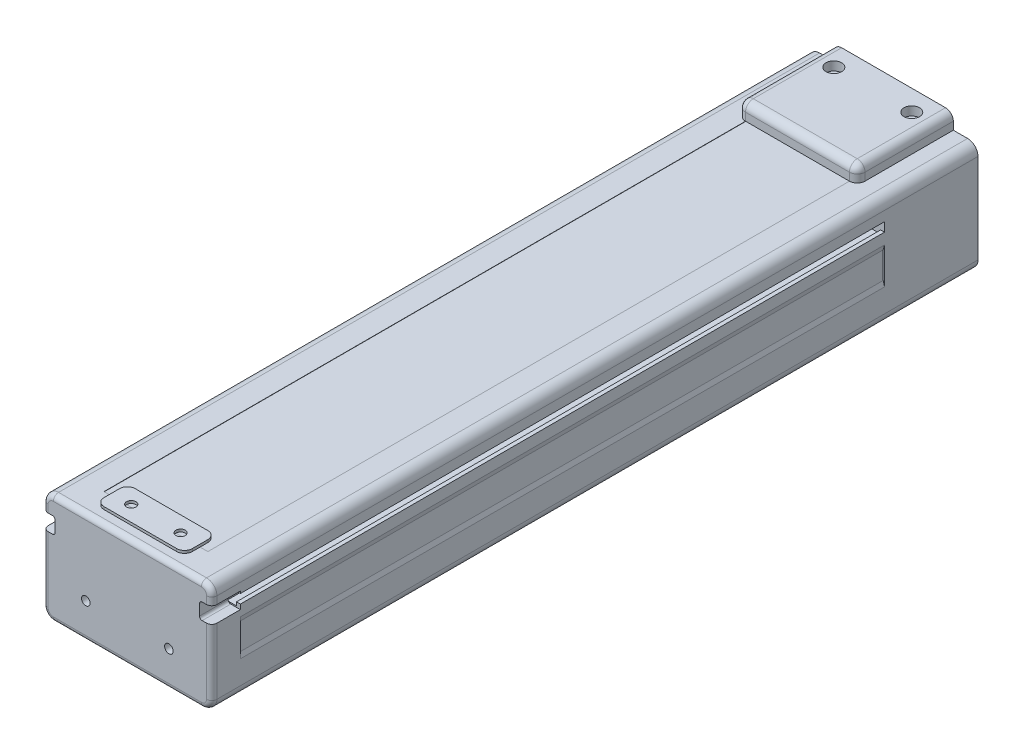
ISO-10303-21;
HEADER;
FILE_DESCRIPTION(('STEP AP214'),'2;1');
FILE_NAME('part.step','',(''),(''),'','','');
FILE_SCHEMA(('AUTOMOTIVE_DESIGN { 1 0 10303 214 1 1 1 1 }'));
ENDSEC;
DATA;
#1=APPLICATION_CONTEXT('core data for automotive mechanical design processes');
#2=APPLICATION_PROTOCOL_DEFINITION('international standard','automotive_design',2000,#1);
#3=PRODUCT_CONTEXT('',#1,'mechanical');
#4=PRODUCT('Part','Part','',(#3));
#5=PRODUCT_RELATED_PRODUCT_CATEGORY('part','',(#4));
#6=PRODUCT_DEFINITION_FORMATION('','',#4);
#7=PRODUCT_DEFINITION_CONTEXT('part definition',#1,'design');
#8=PRODUCT_DEFINITION('design','',#6,#7);
#9=PRODUCT_DEFINITION_SHAPE('','',#8);
#10=(LENGTH_UNIT() NAMED_UNIT(*) SI_UNIT(.MILLI.,.METRE.));
#11=(NAMED_UNIT(*) PLANE_ANGLE_UNIT() SI_UNIT($,.RADIAN.));
#12=(NAMED_UNIT(*) SI_UNIT($,.STERADIAN.) SOLID_ANGLE_UNIT());
#13=UNCERTAINTY_MEASURE_WITH_UNIT(LENGTH_MEASURE(1.E-05),#10,'distance_accuracy_value','');
#14=(GEOMETRIC_REPRESENTATION_CONTEXT(3) GLOBAL_UNCERTAINTY_ASSIGNED_CONTEXT((#13)) GLOBAL_UNIT_ASSIGNED_CONTEXT((#10,
#11,#12)) REPRESENTATION_CONTEXT('',''));
#15=CARTESIAN_POINT('',(0.,0.,0.));
#16=DIRECTION('',(0.,0.,1.));
#17=DIRECTION('',(1.,0.,0.));
#18=AXIS2_PLACEMENT_3D('',#15,#16,#17);
#19=CARTESIAN_POINT('',(-1.13858288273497E-13,43.9000000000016,-67.6611228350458));
#20=DIRECTION('',(0.,1.,0.));
#21=DIRECTION('',(0.,0.,1.));
#22=AXIS2_PLACEMENT_3D('',#19,#20,#21);
#23=PLANE('',#22);
#24=DIRECTION('',(0.,0.,1.));
#25=VECTOR('',#24,1.);
#26=CARTESIAN_POINT('',(-28.5,43.9000000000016,-67.6611228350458));
#27=LINE('',#26,#25);
#28=CARTESIAN_POINT('',(-28.5,43.9,-26.));
#29=VERTEX_POINT('',#28);
#30=CARTESIAN_POINT('',(-28.5,43.9000000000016,267.));
#31=VERTEX_POINT('',#30);
#32=EDGE_CURVE('E1807',#29,#31,#27,.T.);
#33=ORIENTED_EDGE('',*,*,#32,.T.);
#34=DIRECTION('',(-1.,0.,0.));
#35=VECTOR('',#34,1.);
#36=CARTESIAN_POINT('',(-1.13858288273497E-13,43.9000000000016,267.));
#37=LINE('',#36,#35);
#38=CARTESIAN_POINT('',(28.5,43.9000000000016,267.));
#39=VERTEX_POINT('',#38);
#40=EDGE_CURVE('E12',#31,#39,#37,.F.);
#41=ORIENTED_EDGE('',*,*,#40,.T.);
#42=DIRECTION('',(0.,0.,1.));
#43=VECTOR('',#42,1.);
#44=CARTESIAN_POINT('',(28.5,43.9000000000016,-67.6611228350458));
#45=LINE('',#44,#43);
#46=CARTESIAN_POINT('',(28.5,43.9,-26.));
#47=VERTEX_POINT('',#46);
#48=EDGE_CURVE('E1810',#47,#39,#45,.T.);
#49=ORIENTED_EDGE('',*,*,#48,.F.);
#50=DIRECTION('',(1.,0.,0.));
#51=VECTOR('',#50,1.);
#52=CARTESIAN_POINT('',(28.5,43.9,-26.));
#53=LINE('',#52,#51);
#54=CARTESIAN_POINT('',(23.,43.9,-26.));
#55=VERTEX_POINT('',#54);
#56=EDGE_CURVE('E1017',#55,#47,#53,.T.);
#57=ORIENTED_EDGE('',*,*,#56,.F.);
#58=DIRECTION('',(0.,0.,-1.));
#59=VECTOR('',#58,1.);
#60=CARTESIAN_POINT('',(23.,43.9,-26.));
#61=LINE('',#60,#59);
#62=CARTESIAN_POINT('',(23.,43.9,8.));
#63=VERTEX_POINT('',#62);
#64=EDGE_CURVE('E1539',#63,#55,#61,.T.);
#65=ORIENTED_EDGE('',*,*,#64,.F.);
#66=CARTESIAN_POINT('',(20.,43.9,8.));
#67=DIRECTION('',(0.,1.,0.));
#68=DIRECTION('',(0.,0.,-1.));
#69=AXIS2_PLACEMENT_3D('',#66,#67,#68);
#70=CIRCLE('',#69,3.);
#71=CARTESIAN_POINT('',(20.,43.9000000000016,11.));
#72=VERTEX_POINT('',#71);
#73=EDGE_CURVE('E1547',#72,#63,#70,.T.);
#74=ORIENTED_EDGE('',*,*,#73,.F.);
#75=DIRECTION('',(0.,0.,-1.));
#76=VECTOR('',#75,1.);
#77=CARTESIAN_POINT('',(20.,43.9000000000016,1.));
#78=LINE('',#77,#76);
#79=CARTESIAN_POINT('',(20.,43.9000000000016,258.));
#80=VERTEX_POINT('',#79);
#81=EDGE_CURVE('E882',#80,#72,#78,.T.);
#82=ORIENTED_EDGE('',*,*,#81,.F.);
#83=DIRECTION('',(1.,0.,0.));
#84=VECTOR('',#83,1.);
#85=CARTESIAN_POINT('',(-20.,43.9000000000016,258.));
#86=LINE('',#85,#84);
#87=CARTESIAN_POINT('',(17.,43.9000000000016,258.));
#88=VERTEX_POINT('',#87);
#89=EDGE_CURVE('E875',#88,#80,#86,.T.);
#90=ORIENTED_EDGE('',*,*,#89,.F.);
#91=DIRECTION('',(0.,0.,-1.));
#92=VECTOR('',#91,1.);
#93=CARTESIAN_POINT('',(17.,43.9000000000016,252.));
#94=LINE('',#93,#92);
#95=CARTESIAN_POINT('',(17.,43.9000000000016,261.));
#96=VERTEX_POINT('',#95);
#97=EDGE_CURVE('E848',#96,#88,#94,.T.);
#98=ORIENTED_EDGE('',*,*,#97,.F.);
#99=CARTESIAN_POINT('',(14.,43.9000000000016,261.));
#100=DIRECTION('',(0.,1.,0.));
#101=DIRECTION('',(0.,0.,1.));
#102=AXIS2_PLACEMENT_3D('',#99,#100,#101);
#103=CIRCLE('',#102,3.);
#104=CARTESIAN_POINT('',(14.,43.9000000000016,264.));
#105=VERTEX_POINT('',#104);
#106=EDGE_CURVE('E1963',#96,#105,#103,.F.);
#107=ORIENTED_EDGE('',*,*,#106,.T.);
#108=DIRECTION('',(1.,0.,0.));
#109=VECTOR('',#108,1.);
#110=CARTESIAN_POINT('',(-17.,43.9000000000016,264.));
#111=LINE('',#110,#109);
#112=CARTESIAN_POINT('',(-14.,43.9000000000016,264.));
#113=VERTEX_POINT('',#112);
#114=EDGE_CURVE('E843',#113,#105,#111,.T.);
#115=ORIENTED_EDGE('',*,*,#114,.F.);
#116=CARTESIAN_POINT('',(-14.,43.9000000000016,261.));
#117=DIRECTION('',(0.,1.,0.));
#118=DIRECTION('',(0.,0.,1.));
#119=AXIS2_PLACEMENT_3D('',#116,#117,#118);
#120=CIRCLE('',#119,3.);
#121=CARTESIAN_POINT('',(-17.,43.9000000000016,261.));
#122=VERTEX_POINT('',#121);
#123=EDGE_CURVE('E1960',#113,#122,#120,.F.);
#124=ORIENTED_EDGE('',*,*,#123,.T.);
#125=DIRECTION('',(0.,0.,1.));
#126=VECTOR('',#125,1.);
#127=CARTESIAN_POINT('',(-17.,43.9000000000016,252.));
#128=LINE('',#127,#126);
#129=CARTESIAN_POINT('',(-17.,43.9000000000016,258.));
#130=VERTEX_POINT('',#129);
#131=EDGE_CURVE('E818',#130,#122,#128,.T.);
#132=ORIENTED_EDGE('',*,*,#131,.F.);
#133=CARTESIAN_POINT('',(-20.,43.9000000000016,258.));
#134=VERTEX_POINT('',#133);
#135=EDGE_CURVE('E876',#134,#130,#86,.T.);
#136=ORIENTED_EDGE('',*,*,#135,.F.);
#137=DIRECTION('',(0.,0.,1.));
#138=VECTOR('',#137,1.);
#139=CARTESIAN_POINT('',(-20.,43.9000000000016,-67.6611228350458));
#140=LINE('',#139,#138);
#141=CARTESIAN_POINT('',(-20.,43.9000000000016,11.));
#142=VERTEX_POINT('',#141);
#143=EDGE_CURVE('E1897',#142,#134,#140,.T.);
#144=ORIENTED_EDGE('',*,*,#143,.F.);
#145=CARTESIAN_POINT('',(-20.,43.9000000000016,8.));
#146=DIRECTION('',(0.,1.,0.));
#147=DIRECTION('',(0.,0.,1.));
#148=AXIS2_PLACEMENT_3D('',#145,#146,#147);
#149=CIRCLE('',#148,3.);
#150=CARTESIAN_POINT('',(-23.,43.9,8.));
#151=VERTEX_POINT('',#150);
#152=EDGE_CURVE('E1766',#142,#151,#149,.F.);
#153=ORIENTED_EDGE('',*,*,#152,.T.);
#154=DIRECTION('',(0.,0.,1.));
#155=VECTOR('',#154,1.);
#156=CARTESIAN_POINT('',(-23.,43.9,-26.));
#157=LINE('',#156,#155);
#158=CARTESIAN_POINT('',(-23.,43.9,-26.));
#159=VERTEX_POINT('',#158);
#160=EDGE_CURVE('E1533',#159,#151,#157,.T.);
#161=ORIENTED_EDGE('',*,*,#160,.F.);
#162=EDGE_CURVE('E1013',#29,#159,#53,.T.);
#163=ORIENTED_EDGE('',*,*,#162,.F.);
#164=EDGE_LOOP('',(#33,#41,#49,#57,#65,#74,#82,#90,#98,#107,#115,#124,#132,#136,#144,#153,#161,#163));
#165=FACE_BOUND('',#164,.T.);
#166=ADVANCED_FACE('F44',(#165),#23,.T.);
#167=CARTESIAN_POINT('',(-9.5,43.9000000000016,258.));
#168=DIRECTION('',(0.,1.,0.));
#169=DIRECTION('',(0.,0.,1.));
#170=AXIS2_PLACEMENT_3D('',#167,#168,#169);
#171=CIRCLE('',#170,1.80000000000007);
#172=CARTESIAN_POINT('',(-11.3000000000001,43.9000000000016,258.));
#173=VERTEX_POINT('',#172);
#174=CARTESIAN_POINT('',(-7.69999999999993,43.9000000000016,258.));
#175=VERTEX_POINT('',#174);
#176=EDGE_CURVE('E809',#173,#175,#171,.T.);
#177=ORIENTED_EDGE('',*,*,#176,.T.);
#178=EDGE_CURVE('E2201',#173,#175,#86,.T.);
#179=ORIENTED_EDGE('',*,*,#178,.F.);
#180=EDGE_LOOP('',(#177,#179));
#181=FACE_BOUND('',#180,.T.);
#182=ADVANCED_FACE('F2237',(#181),#23,.T.);
#183=CARTESIAN_POINT('',(0.,0.,258.));
#184=DIRECTION('',(0.,0.,1.));
#185=DIRECTION('',(1.,0.,0.));
#186=AXIS2_PLACEMENT_3D('',#183,#184,#185);
#187=PLANE('',#186);
#188=DIRECTION('',(-0.254493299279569,0.967074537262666,0.));
#189=VECTOR('',#188,1.);
#190=CARTESIAN_POINT('',(32.,16.3000000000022,258.));
#191=LINE('',#190,#189);
#192=CARTESIAN_POINT('',(32.5,14.4000000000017,258.));
#193=VERTEX_POINT('',#192);
#194=CARTESIAN_POINT('',(32.,16.3000000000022,258.));
#195=VERTEX_POINT('',#194);
#196=EDGE_CURVE('E1573',#193,#195,#191,.T.);
#197=ORIENTED_EDGE('',*,*,#196,.T.);
#198=DIRECTION('',(0.,1.,0.));
#199=VECTOR('',#198,1.);
#200=CARTESIAN_POINT('',(32.,26.5000000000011,258.));
#201=LINE('',#200,#199);
#202=CARTESIAN_POINT('',(32.,26.5000000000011,258.));
#203=VERTEX_POINT('',#202);
#204=EDGE_CURVE('E1653',#195,#203,#201,.T.);
#205=ORIENTED_EDGE('',*,*,#204,.T.);
#206=DIRECTION('',(0.254493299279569,0.967074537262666,0.));
#207=VECTOR('',#206,1.);
#208=CARTESIAN_POINT('',(32.5,28.4000000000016,258.));
#209=LINE('',#208,#207);
#210=CARTESIAN_POINT('',(32.5,28.4000000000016,258.));
#211=VERTEX_POINT('',#210);
#212=EDGE_CURVE('E1650',#203,#211,#209,.T.);
#213=ORIENTED_EDGE('',*,*,#212,.T.);
#214=DIRECTION('',(0.,1.,0.));
#215=VECTOR('',#214,1.);
#216=CARTESIAN_POINT('',(32.5,30.8,258.));
#217=LINE('',#216,#215);
#218=EDGE_CURVE('E1056',#193,#211,#217,.T.);
#219=ORIENTED_EDGE('',*,*,#218,.F.);
#220=EDGE_LOOP('',(#197,#205,#213,#219));
#221=FACE_BOUND('',#220,.T.);
#222=ADVANCED_FACE('F2322',(#221),#187,.F.);
#223=DIRECTION('',(1.,0.,0.));
#224=VECTOR('',#223,1.);
#225=CARTESIAN_POINT('',(27.3000000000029,31.3000000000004,258.));
#226=LINE('',#225,#224);
#227=CARTESIAN_POINT('',(27.3000000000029,31.3000000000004,258.));
#228=VERTEX_POINT('',#227);
#229=CARTESIAN_POINT('',(27.9339745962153,31.3000000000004,258.));
#230=VERTEX_POINT('',#229);
#231=EDGE_CURVE('E1529',#228,#230,#226,.T.);
#232=ORIENTED_EDGE('',*,*,#231,.F.);
#233=DIRECTION('',(0.,1.,0.));
#234=VECTOR('',#233,1.);
#235=CARTESIAN_POINT('',(27.3000000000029,37.5000000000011,258.));
#236=LINE('',#235,#234);
#237=CARTESIAN_POINT('',(27.3000000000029,37.5000000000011,258.));
#238=VERTEX_POINT('',#237);
#239=EDGE_CURVE('E1632',#228,#238,#236,.T.);
#240=ORIENTED_EDGE('',*,*,#239,.T.);
#241=DIRECTION('',(1.,0.,0.));
#242=VECTOR('',#241,1.);
#243=CARTESIAN_POINT('',(31.,37.5000000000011,258.));
#244=LINE('',#243,#242);
#245=CARTESIAN_POINT('',(31.,37.5000000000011,258.));
#246=VERTEX_POINT('',#245);
#247=EDGE_CURVE('E1629',#238,#246,#244,.T.);
#248=ORIENTED_EDGE('',*,*,#247,.T.);
#249=DIRECTION('',(0.,-1.,0.));
#250=VECTOR('',#249,1.);
#251=CARTESIAN_POINT('',(31.,36.1500000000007,258.));
#252=LINE('',#251,#250);
#253=CARTESIAN_POINT('',(31.,37.,258.));
#254=VERTEX_POINT('',#253);
#255=EDGE_CURVE('E1625',#246,#254,#252,.T.);
#256=ORIENTED_EDGE('',*,*,#255,.T.);
#257=DIRECTION('',(1.,0.,0.));
#258=VECTOR('',#257,1.);
#259=CARTESIAN_POINT('',(32.5,37.,258.));
#260=LINE('',#259,#258);
#261=CARTESIAN_POINT('',(28.8,37.,258.));
#262=VERTEX_POINT('',#261);
#263=EDGE_CURVE('E1042',#262,#254,#260,.T.);
#264=ORIENTED_EDGE('',*,*,#263,.F.);
#265=CARTESIAN_POINT('',(28.8,36.,258.));
#266=DIRECTION('',(0.,0.,1.));
#267=DIRECTION('',(1.,0.,0.));
#268=AXIS2_PLACEMENT_3D('',#265,#266,#267);
#269=CIRCLE('',#268,1.);
#270=CARTESIAN_POINT('',(27.8,36.,258.));
#271=VERTEX_POINT('',#270);
#272=EDGE_CURVE('E1464',#262,#271,#269,.T.);
#273=ORIENTED_EDGE('',*,*,#272,.T.);
#274=DIRECTION('',(0.,1.,0.));
#275=VECTOR('',#274,1.);
#276=CARTESIAN_POINT('',(27.8,37.,258.));
#277=LINE('',#276,#275);
#278=CARTESIAN_POINT('',(27.8,31.8,258.));
#279=VERTEX_POINT('',#278);
#280=EDGE_CURVE('E1048',#279,#271,#277,.T.);
#281=ORIENTED_EDGE('',*,*,#280,.F.);
#282=CARTESIAN_POINT('',(28.8,31.8,258.));
#283=DIRECTION('',(0.,0.,1.));
#284=DIRECTION('',(1.,0.,0.));
#285=AXIS2_PLACEMENT_3D('',#282,#283,#284);
#286=CIRCLE('',#285,1.);
#287=EDGE_CURVE('E1457',#279,#230,#286,.T.);
#288=ORIENTED_EDGE('',*,*,#287,.T.);
#289=EDGE_LOOP('',(#232,#240,#248,#256,#264,#273,#281,#288));
#290=FACE_BOUND('',#289,.T.);
#291=ADVANCED_FACE('F3765',(#290),#187,.F.);
#292=DIRECTION('',(0.,-1.,0.));
#293=VECTOR('',#292,1.);
#294=CARTESIAN_POINT('',(-31.,36.1500000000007,258.));
#295=LINE('',#294,#293);
#296=CARTESIAN_POINT('',(-31.,37.5000000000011,258.));
#297=VERTEX_POINT('',#296);
#298=CARTESIAN_POINT('',(-31.,37.,258.));
#299=VERTEX_POINT('',#298);
#300=EDGE_CURVE('E1525',#297,#299,#295,.T.);
#301=ORIENTED_EDGE('',*,*,#300,.F.);
#302=DIRECTION('',(1.,0.,0.));
#303=VECTOR('',#302,1.);
#304=CARTESIAN_POINT('',(-31.,37.5000000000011,258.));
#305=LINE('',#304,#303);
#306=CARTESIAN_POINT('',(-27.3000000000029,37.5000000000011,258.));
#307=VERTEX_POINT('',#306);
#308=EDGE_CURVE('E1603',#297,#307,#305,.T.);
#309=ORIENTED_EDGE('',*,*,#308,.T.);
#310=DIRECTION('',(0.,-1.,0.));
#311=VECTOR('',#310,1.);
#312=CARTESIAN_POINT('',(-27.3000000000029,37.5000000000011,258.));
#313=LINE('',#312,#311);
#314=CARTESIAN_POINT('',(-27.3000000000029,31.3000000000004,258.));
#315=VERTEX_POINT('',#314);
#316=EDGE_CURVE('E1600',#307,#315,#313,.T.);
#317=ORIENTED_EDGE('',*,*,#316,.T.);
#318=DIRECTION('',(-1.,0.,0.));
#319=VECTOR('',#318,1.);
#320=CARTESIAN_POINT('',(-27.3000000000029,31.3000000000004,258.));
#321=LINE('',#320,#319);
#322=CARTESIAN_POINT('',(-27.9339745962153,31.3000000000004,258.));
#323=VERTEX_POINT('',#322);
#324=EDGE_CURVE('E1596',#315,#323,#321,.T.);
#325=ORIENTED_EDGE('',*,*,#324,.T.);
#326=CARTESIAN_POINT('',(-28.8,31.8,258.));
#327=DIRECTION('',(0.,0.,1.));
#328=DIRECTION('',(1.,0.,0.));
#329=AXIS2_PLACEMENT_3D('',#326,#327,#328);
#330=CIRCLE('',#329,1.);
#331=CARTESIAN_POINT('',(-27.8,31.8,258.));
#332=VERTEX_POINT('',#331);
#333=EDGE_CURVE('E1470',#323,#332,#330,.T.);
#334=ORIENTED_EDGE('',*,*,#333,.T.);
#335=DIRECTION('',(0.,-1.,0.));
#336=VECTOR('',#335,1.);
#337=CARTESIAN_POINT('',(-27.8,37.,258.));
#338=LINE('',#337,#336);
#339=CARTESIAN_POINT('',(-27.8,36.,258.));
#340=VERTEX_POINT('',#339);
#341=EDGE_CURVE('E1069',#340,#332,#338,.T.);
#342=ORIENTED_EDGE('',*,*,#341,.F.);
#343=CARTESIAN_POINT('',(-28.8,36.,258.));
#344=DIRECTION('',(0.,0.,1.));
#345=DIRECTION('',(1.,0.,0.));
#346=AXIS2_PLACEMENT_3D('',#343,#344,#345);
#347=CIRCLE('',#346,1.);
#348=CARTESIAN_POINT('',(-28.8,37.,258.));
#349=VERTEX_POINT('',#348);
#350=EDGE_CURVE('E1478',#340,#349,#347,.T.);
#351=ORIENTED_EDGE('',*,*,#350,.T.);
#352=DIRECTION('',(1.,0.,0.));
#353=VECTOR('',#352,1.);
#354=CARTESIAN_POINT('',(-32.5,37.,258.));
#355=LINE('',#354,#353);
#356=EDGE_CURVE('E1077',#299,#349,#355,.T.);
#357=ORIENTED_EDGE('',*,*,#356,.F.);
#358=EDGE_LOOP('',(#301,#309,#317,#325,#334,#342,#351,#357));
#359=FACE_BOUND('',#358,.T.);
#360=ADVANCED_FACE('F3320',(#359),#187,.F.);
#361=CARTESIAN_POINT('',(28.5,5.4,10.));
#362=DIRECTION('',(0.,0.,-1.));
#363=DIRECTION('',(-1.,0.,0.));
#364=AXIS2_PLACEMENT_3D('',#361,#362,#363);
#365=PLANE('',#364);
#366=DIRECTION('',(-0.254493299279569,0.967074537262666,0.));
#367=VECTOR('',#366,1.);
#368=CARTESIAN_POINT('',(32.,16.3000000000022,9.99999999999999));
#369=LINE('',#368,#367);
#370=CARTESIAN_POINT('',(32.5,14.4000000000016,10.));
#371=VERTEX_POINT('',#370);
#372=CARTESIAN_POINT('',(32.,16.3000000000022,9.99999999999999));
#373=VERTEX_POINT('',#372);
#374=EDGE_CURVE('E1757',#371,#373,#369,.T.);
#375=ORIENTED_EDGE('',*,*,#374,.F.);
#376=DIRECTION('',(0.,-1.,0.));
#377=VECTOR('',#376,1.);
#378=CARTESIAN_POINT('',(32.5,39.9,10.));
#379=LINE('',#378,#377);
#380=CARTESIAN_POINT('',(32.5,28.4000000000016,10.));
#381=VERTEX_POINT('',#380);
#382=EDGE_CURVE('E999',#381,#371,#379,.T.);
#383=ORIENTED_EDGE('',*,*,#382,.F.);
#384=DIRECTION('',(0.254493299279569,0.967074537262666,0.));
#385=VECTOR('',#384,1.);
#386=CARTESIAN_POINT('',(32.5,28.4000000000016,9.99999999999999));
#387=LINE('',#386,#385);
#388=CARTESIAN_POINT('',(32.,26.5000000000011,9.99999999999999));
#389=VERTEX_POINT('',#388);
#390=EDGE_CURVE('E1746',#389,#381,#387,.T.);
#391=ORIENTED_EDGE('',*,*,#390,.F.);
#392=DIRECTION('',(0.,1.,0.));
#393=VECTOR('',#392,1.);
#394=CARTESIAN_POINT('',(32.,26.5000000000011,9.99999999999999));
#395=LINE('',#394,#393);
#396=EDGE_CURVE('E1752',#373,#389,#395,.T.);
#397=ORIENTED_EDGE('',*,*,#396,.F.);
#398=EDGE_LOOP('',(#375,#383,#391,#397));
#399=FACE_BOUND('',#398,.T.);
#400=ADVANCED_FACE('F3249',(#399),#365,.F.);
#401=DIRECTION('',(-1.,0.,0.));
#402=VECTOR('',#401,1.);
#403=CARTESIAN_POINT('',(31.,32.6500000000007,9.99999999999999));
#404=LINE('',#403,#402);
#405=CARTESIAN_POINT('',(32.5,32.6500000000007,10.));
#406=VERTEX_POINT('',#405);
#407=CARTESIAN_POINT('',(31.,32.6500000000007,9.99999999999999));
#408=VERTEX_POINT('',#407);
#409=EDGE_CURVE('E1741',#406,#408,#404,.T.);
#410=ORIENTED_EDGE('',*,*,#409,.F.);
#411=CARTESIAN_POINT('',(32.5,36.1500000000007,10.));
#412=VERTEX_POINT('',#411);
#413=EDGE_CURVE('E1003',#412,#406,#379,.T.);
#414=ORIENTED_EDGE('',*,*,#413,.F.);
#415=DIRECTION('',(1.,0.,0.));
#416=VECTOR('',#415,1.);
#417=CARTESIAN_POINT('',(32.5,36.1500000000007,9.99999999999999));
#418=LINE('',#417,#416);
#419=CARTESIAN_POINT('',(31.,36.1500000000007,9.99999999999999));
#420=VERTEX_POINT('',#419);
#421=EDGE_CURVE('E1710',#420,#412,#418,.T.);
#422=ORIENTED_EDGE('',*,*,#421,.F.);
#423=DIRECTION('',(0.,-1.,0.));
#424=VECTOR('',#423,1.);
#425=CARTESIAN_POINT('',(31.,36.1500000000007,9.99999999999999));
#426=LINE('',#425,#424);
#427=CARTESIAN_POINT('',(31.,37.5000000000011,9.99999999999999));
#428=VERTEX_POINT('',#427);
#429=EDGE_CURVE('E1716',#428,#420,#426,.T.);
#430=ORIENTED_EDGE('',*,*,#429,.F.);
#431=DIRECTION('',(1.,0.,0.));
#432=VECTOR('',#431,1.);
#433=CARTESIAN_POINT('',(31.,37.5000000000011,9.99999999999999));
#434=LINE('',#433,#432);
#435=CARTESIAN_POINT('',(27.3000000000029,37.5000000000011,9.99999999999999));
#436=VERTEX_POINT('',#435);
#437=EDGE_CURVE('E1721',#436,#428,#434,.T.);
#438=ORIENTED_EDGE('',*,*,#437,.F.);
#439=DIRECTION('',(0.,1.,0.));
#440=VECTOR('',#439,1.);
#441=CARTESIAN_POINT('',(27.3000000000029,37.5000000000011,9.99999999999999));
#442=LINE('',#441,#440);
#443=CARTESIAN_POINT('',(27.3000000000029,31.3000000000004,9.99999999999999));
#444=VERTEX_POINT('',#443);
#445=EDGE_CURVE('E1726',#444,#436,#442,.T.);
#446=ORIENTED_EDGE('',*,*,#445,.F.);
#447=DIRECTION('',(-1.,0.,0.));
#448=VECTOR('',#447,1.);
#449=CARTESIAN_POINT('',(27.3000000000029,31.3000000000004,9.99999999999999));
#450=LINE('',#449,#448);
#451=CARTESIAN_POINT('',(31.,31.3000000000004,9.99999999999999));
#452=VERTEX_POINT('',#451);
#453=EDGE_CURVE('E1731',#452,#444,#450,.T.);
#454=ORIENTED_EDGE('',*,*,#453,.F.);
#455=DIRECTION('',(0.,-1.,0.));
#456=VECTOR('',#455,1.);
#457=CARTESIAN_POINT('',(31.,31.3000000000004,9.99999999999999));
#458=LINE('',#457,#456);
#459=EDGE_CURVE('E1736',#408,#452,#458,.T.);
#460=ORIENTED_EDGE('',*,*,#459,.F.);
#461=EDGE_LOOP('',(#410,#414,#422,#430,#438,#446,#454,#460));
#462=FACE_BOUND('',#461,.T.);
#463=ADVANCED_FACE('F3740',(#462),#365,.F.);
#464=DIRECTION('',(1.,0.,0.));
#465=VECTOR('',#464,1.);
#466=CARTESIAN_POINT('',(-32.5,36.1500000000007,9.99999999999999));
#467=LINE('',#466,#465);
#468=CARTESIAN_POINT('',(-32.5,36.1500000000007,10.));
#469=VERTEX_POINT('',#468);
#470=CARTESIAN_POINT('',(-31.,36.1500000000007,9.99999999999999));
#471=VERTEX_POINT('',#470);
#472=EDGE_CURVE('E1705',#469,#471,#467,.T.);
#473=ORIENTED_EDGE('',*,*,#472,.F.);
#474=DIRECTION('',(0.,1.,0.));
#475=VECTOR('',#474,1.);
#476=CARTESIAN_POINT('',(-32.5,39.9,10.));
#477=LINE('',#476,#475);
#478=CARTESIAN_POINT('',(-32.5,32.6500000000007,10.));
#479=VERTEX_POINT('',#478);
#480=EDGE_CURVE('E980',#479,#469,#477,.T.);
#481=ORIENTED_EDGE('',*,*,#480,.F.);
#482=DIRECTION('',(-1.,0.,0.));
#483=VECTOR('',#482,1.);
#484=CARTESIAN_POINT('',(-31.,32.6500000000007,9.99999999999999));
#485=LINE('',#484,#483);
#486=CARTESIAN_POINT('',(-31.,32.6500000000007,9.99999999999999));
#487=VERTEX_POINT('',#486);
#488=EDGE_CURVE('E1674',#487,#479,#485,.T.);
#489=ORIENTED_EDGE('',*,*,#488,.F.);
#490=DIRECTION('',(0.,1.,0.));
#491=VECTOR('',#490,1.);
#492=CARTESIAN_POINT('',(-31.,31.3000000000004,9.99999999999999));
#493=LINE('',#492,#491);
#494=CARTESIAN_POINT('',(-31.,31.3000000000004,9.99999999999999));
#495=VERTEX_POINT('',#494);
#496=EDGE_CURVE('E1680',#495,#487,#493,.T.);
#497=ORIENTED_EDGE('',*,*,#496,.F.);
#498=DIRECTION('',(-1.,0.,0.));
#499=VECTOR('',#498,1.);
#500=CARTESIAN_POINT('',(-27.3000000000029,31.3000000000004,9.99999999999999));
#501=LINE('',#500,#499);
#502=CARTESIAN_POINT('',(-27.3000000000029,31.3000000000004,9.99999999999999));
#503=VERTEX_POINT('',#502);
#504=EDGE_CURVE('E1685',#503,#495,#501,.T.);
#505=ORIENTED_EDGE('',*,*,#504,.F.);
#506=DIRECTION('',(0.,-1.,0.));
#507=VECTOR('',#506,1.);
#508=CARTESIAN_POINT('',(-27.3000000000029,37.5000000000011,9.99999999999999));
#509=LINE('',#508,#507);
#510=CARTESIAN_POINT('',(-27.3000000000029,37.5000000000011,9.99999999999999));
#511=VERTEX_POINT('',#510);
#512=EDGE_CURVE('E1690',#511,#503,#509,.T.);
#513=ORIENTED_EDGE('',*,*,#512,.F.);
#514=DIRECTION('',(1.,0.,0.));
#515=VECTOR('',#514,1.);
#516=CARTESIAN_POINT('',(-31.,37.5000000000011,9.99999999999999));
#517=LINE('',#516,#515);
#518=CARTESIAN_POINT('',(-31.,37.5000000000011,9.99999999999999));
#519=VERTEX_POINT('',#518);
#520=EDGE_CURVE('E1695',#519,#511,#517,.T.);
#521=ORIENTED_EDGE('',*,*,#520,.F.);
#522=DIRECTION('',(0.,1.,0.));
#523=VECTOR('',#522,1.);
#524=CARTESIAN_POINT('',(-31.,36.1500000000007,9.99999999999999));
#525=LINE('',#524,#523);
#526=EDGE_CURVE('E1700',#471,#519,#525,.T.);
#527=ORIENTED_EDGE('',*,*,#526,.F.);
#528=EDGE_LOOP('',(#473,#481,#489,#497,#505,#513,#521,#527));
#529=FACE_BOUND('',#528,.T.);
#530=ADVANCED_FACE('F3250',(#529),#365,.F.);
#531=CARTESIAN_POINT('',(-21.0000000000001,1.57538738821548E-12,259.));
#532=DIRECTION('',(1.,0.,0.));
#533=DIRECTION('',(0.,1.,0.));
#534=AXIS2_PLACEMENT_3D('',#531,#532,#533);
#535=PLANE('',#534);
#536=DIRECTION('',(0.,0.,1.));
#537=VECTOR('',#536,1.);
#538=CARTESIAN_POINT('',(-21.,1.40000000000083,-67.6611228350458));
#539=LINE('',#538,#537);
#540=CARTESIAN_POINT('',(-21.,1.4,0.));
#541=VERTEX_POINT('',#540);
#542=CARTESIAN_POINT('',(-21.,1.4,259.));
#543=VERTEX_POINT('',#542);
#544=EDGE_CURVE('E1860',#541,#543,#539,.T.);
#545=ORIENTED_EDGE('',*,*,#544,.F.);
#546=DIRECTION('',(0.,-1.,0.));
#547=VECTOR('',#546,1.);
#548=CARTESIAN_POINT('',(-21.0000000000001,1.57538738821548E-12,0.));
#549=LINE('',#548,#547);
#550=CARTESIAN_POINT('',(-21.,0.81568542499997,0.));
#551=VERTEX_POINT('',#550);
#552=EDGE_CURVE('E1330',#541,#551,#549,.T.);
#553=ORIENTED_EDGE('',*,*,#552,.T.);
#554=DIRECTION('',(0.,0.,-1.));
#555=VECTOR('',#554,1.);
#556=CARTESIAN_POINT('',(-21.,0.81568542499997,259.));
#557=LINE('',#556,#555);
#558=CARTESIAN_POINT('',(-21.,0.81568542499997,259.));
#559=VERTEX_POINT('',#558);
#560=EDGE_CURVE('E1396',#559,#551,#557,.T.);
#561=ORIENTED_EDGE('',*,*,#560,.F.);
#562=DIRECTION('',(0.,-1.,0.));
#563=VECTOR('',#562,1.);
#564=CARTESIAN_POINT('',(-21.0000000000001,1.57538738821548E-12,259.));
#565=LINE('',#564,#563);
#566=EDGE_CURVE('E1300',#543,#559,#565,.T.);
#567=ORIENTED_EDGE('',*,*,#566,.F.);
#568=EDGE_LOOP('',(#545,#553,#561,#567));
#569=FACE_BOUND('',#568,.T.);
#570=ADVANCED_FACE('F3721',(#569),#535,.F.);
#571=CARTESIAN_POINT('',(20.9999999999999,-2.39337699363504E-12,259.));
#572=DIRECTION('',(-1.,1.13970333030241E-13,0.));
#573=DIRECTION('',(-1.13970333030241E-13,-1.,0.));
#574=AXIS2_PLACEMENT_3D('',#571,#572,#573);
#575=PLANE('',#574);
#576=DIRECTION('',(0.,0.,-1.));
#577=VECTOR('',#576,1.);
#578=CARTESIAN_POINT('',(21.0000000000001,1.40000000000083,-67.6611228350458));
#579=LINE('',#578,#577);
#580=CARTESIAN_POINT('',(21.0000000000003,1.4,259.));
#581=VERTEX_POINT('',#580);
#582=CARTESIAN_POINT('',(21.0000000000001,1.4,0.));
#583=VERTEX_POINT('',#582);
#584=EDGE_CURVE('E1863',#581,#583,#579,.T.);
#585=ORIENTED_EDGE('',*,*,#584,.F.);
#586=DIRECTION('',(1.13970333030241E-13,1.,0.));
#587=VECTOR('',#586,1.);
#588=CARTESIAN_POINT('',(20.9999999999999,-2.39337699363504E-12,259.));
#589=LINE('',#588,#587);
#590=CARTESIAN_POINT('',(21.,0.815685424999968,259.));
#591=VERTEX_POINT('',#590);
#592=EDGE_CURVE('E1325',#591,#581,#589,.T.);
#593=ORIENTED_EDGE('',*,*,#592,.F.);
#594=DIRECTION('',(0.,0.,-1.));
#595=VECTOR('',#594,1.);
#596=CARTESIAN_POINT('',(21.,0.815685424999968,259.));
#597=LINE('',#596,#595);
#598=CARTESIAN_POINT('',(21.,0.815685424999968,0.));
#599=VERTEX_POINT('',#598);
#600=EDGE_CURVE('E1329',#591,#599,#597,.T.);
#601=ORIENTED_EDGE('',*,*,#600,.T.);
#602=DIRECTION('',(1.13970333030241E-13,1.,0.));
#603=VECTOR('',#602,1.);
#604=CARTESIAN_POINT('',(20.9999999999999,-2.39337699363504E-12,0.));
#605=LINE('',#604,#603);
#606=EDGE_CURVE('E1304',#599,#583,#605,.T.);
#607=ORIENTED_EDGE('',*,*,#606,.T.);
#608=EDGE_LOOP('',(#585,#593,#601,#607));
#609=FACE_BOUND('',#608,.T.);
#610=ADVANCED_FACE('F3710',(#609),#575,.F.);
#611=CARTESIAN_POINT('',(0.,0.,0.));
#612=DIRECTION('',(0.,0.,1.));
#613=DIRECTION('',(1.,0.,0.));
#614=AXIS2_PLACEMENT_3D('',#611,#612,#613);
#615=PLANE('',#614);
#616=DIRECTION('',(0.707106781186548,-0.707106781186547,0.));
#617=VECTOR('',#616,1.);
#618=CARTESIAN_POINT('',(4.5,4.5,0.));
#619=LINE('',#618,#617);
#620=CARTESIAN_POINT('',(8.5,0.5,0.));
#621=VERTEX_POINT('',#620);
#622=CARTESIAN_POINT('',(9.,0.,0.));
#623=VERTEX_POINT('',#622);
#624=EDGE_CURVE('E1348',#621,#623,#619,.T.);
#625=ORIENTED_EDGE('',*,*,#624,.F.);
#626=DIRECTION('',(1.,0.,0.));
#627=VECTOR('',#626,1.);
#628=CARTESIAN_POINT('',(0.,0.5,0.));
#629=LINE('',#628,#627);
#630=CARTESIAN_POINT('',(-8.5,0.5,0.));
#631=VERTEX_POINT('',#630);
#632=EDGE_CURVE('E1344',#631,#621,#629,.T.);
#633=ORIENTED_EDGE('',*,*,#632,.F.);
#634=DIRECTION('',(0.707106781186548,0.707106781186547,0.));
#635=VECTOR('',#634,1.);
#636=CARTESIAN_POINT('',(-4.5,4.5,0.));
#637=LINE('',#636,#635);
#638=CARTESIAN_POINT('',(-9.,0.,0.));
#639=VERTEX_POINT('',#638);
#640=EDGE_CURVE('E1340',#639,#631,#637,.T.);
#641=ORIENTED_EDGE('',*,*,#640,.F.);
#642=DIRECTION('',(1.,0.,0.));
#643=VECTOR('',#642,1.);
#644=CARTESIAN_POINT('',(0.,0.,0.));
#645=LINE('',#644,#643);
#646=CARTESIAN_POINT('',(-20.1843145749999,0.,0.));
#647=VERTEX_POINT('',#646);
#648=EDGE_CURVE('E1336',#647,#639,#645,.T.);
#649=ORIENTED_EDGE('',*,*,#648,.F.);
#650=DIRECTION('',(0.707106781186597,-0.707106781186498,0.));
#651=VECTOR('',#650,1.);
#652=CARTESIAN_POINT('',(-10.0921572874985,-10.0921572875,0.));
#653=LINE('',#652,#651);
#654=EDGE_CURVE('E1333',#551,#647,#653,.T.);
#655=ORIENTED_EDGE('',*,*,#654,.F.);
#656=ORIENTED_EDGE('',*,*,#552,.F.);
#657=DIRECTION('',(0.,-1.,0.));
#658=VECTOR('',#657,1.);
#659=CARTESIAN_POINT('',(-21.,9.5,0.));
#660=LINE('',#659,#658);
#661=CARTESIAN_POINT('',(-21.,9.5,0.));
#662=VERTEX_POINT('',#661);
#663=EDGE_CURVE('E976',#662,#541,#660,.T.);
#664=ORIENTED_EDGE('',*,*,#663,.F.);
#665=DIRECTION('',(-1.,0.,0.));
#666=VECTOR('',#665,1.);
#667=CARTESIAN_POINT('',(-21.,9.5,0.));
#668=LINE('',#667,#666);
#669=CARTESIAN_POINT('',(21.0000000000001,9.5,0.));
#670=VERTEX_POINT('',#669);
#671=EDGE_CURVE('E971',#670,#662,#668,.T.);
#672=ORIENTED_EDGE('',*,*,#671,.F.);
#673=DIRECTION('',(0.,-1.,0.));
#674=VECTOR('',#673,1.);
#675=CARTESIAN_POINT('',(21.0000000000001,9.5,0.));
#676=LINE('',#675,#674);
#677=EDGE_CURVE('E981',#670,#583,#676,.T.);
#678=ORIENTED_EDGE('',*,*,#677,.T.);
#679=ORIENTED_EDGE('',*,*,#606,.F.);
#680=DIRECTION('',(0.7071067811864,0.707106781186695,0.));
#681=VECTOR('',#680,1.);
#682=CARTESIAN_POINT('',(10.0921572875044,-10.0921572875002,0.));
#683=LINE('',#682,#681);
#684=CARTESIAN_POINT('',(20.1843145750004,0.,0.));
#685=VERTEX_POINT('',#684);
#686=EDGE_CURVE('E1355',#685,#599,#683,.T.);
#687=ORIENTED_EDGE('',*,*,#686,.F.);
#688=DIRECTION('',(1.,0.,0.));
#689=VECTOR('',#688,1.);
#690=CARTESIAN_POINT('',(0.,0.,0.));
#691=LINE('',#690,#689);
#692=EDGE_CURVE('E1352',#623,#685,#691,.T.);
#693=ORIENTED_EDGE('',*,*,#692,.F.);
#694=EDGE_LOOP('',(#625,#633,#641,#649,#655,#656,#664,#672,#678,#679,#687,#693));
#695=FACE_BOUND('',#694,.T.);
#696=ADVANCED_FACE('F3704',(#695),#615,.F.);
#697=CARTESIAN_POINT('',(-11.5,0.,5.));
#698=DIRECTION('',(0.,-1.,0.));
#699=DIRECTION('',(0.,0.,-1.));
#700=AXIS2_PLACEMENT_3D('',#697,#698,#699);
#701=CYLINDRICAL_SURFACE('',#700,4.);
#702=CARTESIAN_POINT('',(-11.5,0.,5.));
#703=DIRECTION('',(0.,-1.,0.));
#704=DIRECTION('',(0.,0.,-1.));
#705=AXIS2_PLACEMENT_3D('',#702,#703,#704);
#706=CIRCLE('',#705,4.);
#707=CARTESIAN_POINT('',(-9.,0.,8.1224989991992));
#708=VERTEX_POINT('',#707);
#709=CARTESIAN_POINT('',(-9.,0.,1.8775010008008));
#710=VERTEX_POINT('',#709);
#711=EDGE_CURVE('E1292',#708,#710,#706,.T.);
#712=ORIENTED_EDGE('',*,*,#711,.T.);
#713=CARTESIAN_POINT('',(-11.5,-2.5,5.));
#714=DIRECTION('',(-0.707106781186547,0.707106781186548,0.));
#715=DIRECTION('',(-0.707106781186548,-0.707106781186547,0.));
#716=AXIS2_PLACEMENT_3D('',#713,#714,#715);
#717=ELLIPSE('',#716,5.65685424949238,4.);
#718=CARTESIAN_POINT('',(-8.5,0.5,2.35424868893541));
#719=VERTEX_POINT('',#718);
#720=EDGE_CURVE('E1295',#719,#710,#717,.T.);
#721=ORIENTED_EDGE('',*,*,#720,.F.);
#722=CARTESIAN_POINT('',(-11.5,0.5,5.));
#723=DIRECTION('',(0.,1.,0.));
#724=DIRECTION('',(0.,0.,1.));
#725=AXIS2_PLACEMENT_3D('',#722,#723,#724);
#726=CIRCLE('',#725,4.);
#727=CARTESIAN_POINT('',(-8.5,0.5,7.64575131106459));
#728=VERTEX_POINT('',#727);
#729=EDGE_CURVE('E1400',#728,#719,#726,.T.);
#730=ORIENTED_EDGE('',*,*,#729,.F.);
#731=EDGE_CURVE('E1299',#708,#728,#717,.T.);
#732=ORIENTED_EDGE('',*,*,#731,.F.);
#733=EDGE_LOOP('',(#712,#721,#730,#732));
#734=FACE_BOUND('',#733,.T.);
#735=CARTESIAN_POINT('',(-11.5,4.2,5.));
#736=DIRECTION('',(0.,-1.,0.));
#737=DIRECTION('',(0.,0.,-1.));
#738=AXIS2_PLACEMENT_3D('',#735,#736,#737);
#739=CIRCLE('',#738,3.99999999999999);
#740=CARTESIAN_POINT('',(-11.5,4.2,1.00000000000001));
#741=VERTEX_POINT('',#740);
#742=EDGE_CURVE('E747',#741,#741,#739,.T.);
#743=ORIENTED_EDGE('',*,*,#742,.F.);
#744=EDGE_LOOP('',(#743));
#745=FACE_BOUND('',#744,.T.);
#746=ADVANCED_FACE('F3709',(#734,#745),#701,.F.);
#747=CARTESIAN_POINT('',(11.5,0.,5.));
#748=DIRECTION('',(0.,-1.,0.));
#749=DIRECTION('',(0.,0.,-1.));
#750=AXIS2_PLACEMENT_3D('',#747,#748,#749);
#751=CYLINDRICAL_SURFACE('',#750,4.);
#752=CARTESIAN_POINT('',(11.5,0.,5.));
#753=DIRECTION('',(0.,-1.,0.));
#754=DIRECTION('',(0.,0.,-1.));
#755=AXIS2_PLACEMENT_3D('',#752,#753,#754);
#756=CIRCLE('',#755,4.);
#757=CARTESIAN_POINT('',(9.,0.,1.8775010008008));
#758=VERTEX_POINT('',#757);
#759=CARTESIAN_POINT('',(9.,0.,8.1224989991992));
#760=VERTEX_POINT('',#759);
#761=EDGE_CURVE('E1283',#758,#760,#756,.T.);
#762=ORIENTED_EDGE('',*,*,#761,.T.);
#763=CARTESIAN_POINT('',(11.5,-2.5,5.));
#764=DIRECTION('',(0.707106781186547,0.707106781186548,0.));
#765=DIRECTION('',(0.707106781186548,-0.707106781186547,0.));
#766=AXIS2_PLACEMENT_3D('',#763,#764,#765);
#767=ELLIPSE('',#766,5.65685424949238,4.);
#768=CARTESIAN_POINT('',(8.5,0.5,7.64575131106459));
#769=VERTEX_POINT('',#768);
#770=EDGE_CURVE('E1287',#769,#760,#767,.T.);
#771=ORIENTED_EDGE('',*,*,#770,.F.);
#772=CARTESIAN_POINT('',(11.5,0.5,5.));
#773=DIRECTION('',(0.,1.,0.));
#774=DIRECTION('',(0.,0.,1.));
#775=AXIS2_PLACEMENT_3D('',#772,#773,#774);
#776=CIRCLE('',#775,4.);
#777=CARTESIAN_POINT('',(8.5,0.5,2.35424868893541));
#778=VERTEX_POINT('',#777);
#779=EDGE_CURVE('E1404',#778,#769,#776,.T.);
#780=ORIENTED_EDGE('',*,*,#779,.F.);
#781=EDGE_CURVE('E1291',#758,#778,#767,.T.);
#782=ORIENTED_EDGE('',*,*,#781,.F.);
#783=EDGE_LOOP('',(#762,#771,#780,#782));
#784=FACE_BOUND('',#783,.T.);
#785=CARTESIAN_POINT('',(11.5,4.2,5.));
#786=DIRECTION('',(0.,-1.,0.));
#787=DIRECTION('',(0.,0.,-1.));
#788=AXIS2_PLACEMENT_3D('',#785,#786,#787);
#789=CIRCLE('',#788,3.99999999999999);
#790=CARTESIAN_POINT('',(11.5,4.2,1.00000000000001));
#791=VERTEX_POINT('',#790);
#792=EDGE_CURVE('E760',#791,#791,#789,.T.);
#793=ORIENTED_EDGE('',*,*,#792,.F.);
#794=EDGE_LOOP('',(#793));
#795=FACE_BOUND('',#794,.T.);
#796=ADVANCED_FACE('F3697',(#784,#795),#751,.F.);
#797=CARTESIAN_POINT('',(0.,0.,259.));
#798=DIRECTION('',(0.,0.,1.));
#799=DIRECTION('',(1.,0.,0.));
#800=AXIS2_PLACEMENT_3D('',#797,#798,#799);
#801=PLANE('',#800);
#802=DIRECTION('',(1.,0.,0.));
#803=VECTOR('',#802,1.);
#804=CARTESIAN_POINT('',(0.,0.5,259.));
#805=LINE('',#804,#803);
#806=CARTESIAN_POINT('',(-8.5,0.5,259.));
#807=VERTEX_POINT('',#806);
#808=CARTESIAN_POINT('',(8.5,0.5,259.));
#809=VERTEX_POINT('',#808);
#810=EDGE_CURVE('E1313',#807,#809,#805,.T.);
#811=ORIENTED_EDGE('',*,*,#810,.T.);
#812=DIRECTION('',(0.707106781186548,-0.707106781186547,0.));
#813=VECTOR('',#812,1.);
#814=CARTESIAN_POINT('',(4.5,4.5,259.));
#815=LINE('',#814,#813);
#816=CARTESIAN_POINT('',(9.,0.,259.));
#817=VERTEX_POINT('',#816);
#818=EDGE_CURVE('E1316',#809,#817,#815,.T.);
#819=ORIENTED_EDGE('',*,*,#818,.T.);
#820=DIRECTION('',(1.,0.,0.));
#821=VECTOR('',#820,1.);
#822=CARTESIAN_POINT('',(0.,0.,259.));
#823=LINE('',#822,#821);
#824=CARTESIAN_POINT('',(20.1843145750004,0.,259.));
#825=VERTEX_POINT('',#824);
#826=EDGE_CURVE('E1319',#817,#825,#823,.T.);
#827=ORIENTED_EDGE('',*,*,#826,.T.);
#828=DIRECTION('',(0.7071067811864,0.707106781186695,0.));
#829=VECTOR('',#828,1.);
#830=CARTESIAN_POINT('',(10.0921572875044,-10.0921572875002,259.));
#831=LINE('',#830,#829);
#832=EDGE_CURVE('E1322',#825,#591,#831,.T.);
#833=ORIENTED_EDGE('',*,*,#832,.T.);
#834=ORIENTED_EDGE('',*,*,#592,.T.);
#835=DIRECTION('',(0.,-1.,0.));
#836=VECTOR('',#835,1.);
#837=CARTESIAN_POINT('',(21.0000000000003,9.5,259.));
#838=LINE('',#837,#836);
#839=CARTESIAN_POINT('',(21.0000000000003,9.5,259.));
#840=VERTEX_POINT('',#839);
#841=EDGE_CURVE('E929',#840,#581,#838,.T.);
#842=ORIENTED_EDGE('',*,*,#841,.F.);
#843=DIRECTION('',(1.,0.,0.));
#844=VECTOR('',#843,1.);
#845=CARTESIAN_POINT('',(21.0000000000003,9.5,259.));
#846=LINE('',#845,#844);
#847=CARTESIAN_POINT('',(-21.,9.5,259.));
#848=VERTEX_POINT('',#847);
#849=EDGE_CURVE('E924',#848,#840,#846,.T.);
#850=ORIENTED_EDGE('',*,*,#849,.F.);
#851=DIRECTION('',(0.,-1.,0.));
#852=VECTOR('',#851,1.);
#853=CARTESIAN_POINT('',(-21.,9.5,259.));
#854=LINE('',#853,#852);
#855=EDGE_CURVE('E934',#848,#543,#854,.T.);
#856=ORIENTED_EDGE('',*,*,#855,.T.);
#857=ORIENTED_EDGE('',*,*,#566,.T.);
#858=DIRECTION('',(0.707106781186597,-0.707106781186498,0.));
#859=VECTOR('',#858,1.);
#860=CARTESIAN_POINT('',(-10.0921572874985,-10.0921572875,259.));
#861=LINE('',#860,#859);
#862=CARTESIAN_POINT('',(-20.1843145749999,0.,259.));
#863=VERTEX_POINT('',#862);
#864=EDGE_CURVE('E1303',#559,#863,#861,.T.);
#865=ORIENTED_EDGE('',*,*,#864,.T.);
#866=DIRECTION('',(1.,0.,0.));
#867=VECTOR('',#866,1.);
#868=CARTESIAN_POINT('',(0.,0.,259.));
#869=LINE('',#868,#867);
#870=CARTESIAN_POINT('',(-9.,0.,259.));
#871=VERTEX_POINT('',#870);
#872=EDGE_CURVE('E1307',#863,#871,#869,.T.);
#873=ORIENTED_EDGE('',*,*,#872,.T.);
#874=DIRECTION('',(0.707106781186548,0.707106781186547,0.));
#875=VECTOR('',#874,1.);
#876=CARTESIAN_POINT('',(-4.5,4.5,259.));
#877=LINE('',#876,#875);
#878=EDGE_CURVE('E1310',#871,#807,#877,.T.);
#879=ORIENTED_EDGE('',*,*,#878,.T.);
#880=EDGE_LOOP('',(#811,#819,#827,#833,#834,#842,#850,#856,#857,#865,#873,#879));
#881=FACE_BOUND('',#880,.T.);
#882=ADVANCED_FACE('F3687',(#881),#801,.T.);
#883=CARTESIAN_POINT('',(-4.5,4.5,259.));
#884=DIRECTION('',(-0.707106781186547,0.707106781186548,0.));
#885=DIRECTION('',(-0.707106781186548,-0.707106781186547,0.));
#886=AXIS2_PLACEMENT_3D('',#883,#884,#885);
#887=PLANE('',#886);
#888=DIRECTION('',(0.,0.,-1.));
#889=VECTOR('',#888,1.);
#890=CARTESIAN_POINT('',(-9.,0.,259.));
#891=LINE('',#890,#889);
#892=CARTESIAN_POINT('',(-9.00000000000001,0.,257.122498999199));
#893=VERTEX_POINT('',#892);
#894=EDGE_CURVE('E1387',#871,#893,#891,.T.);
#895=ORIENTED_EDGE('',*,*,#894,.T.);
#896=CARTESIAN_POINT('',(-11.5,-2.5,254.));
#897=DIRECTION('',(-0.707106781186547,0.707106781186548,0.));
#898=DIRECTION('',(-0.707106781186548,-0.707106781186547,0.));
#899=AXIS2_PLACEMENT_3D('',#896,#897,#898);
#900=ELLIPSE('',#899,5.65685424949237,3.99999999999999);
#901=CARTESIAN_POINT('',(-8.5,0.5,256.645751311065));
#902=VERTEX_POINT('',#901);
#903=EDGE_CURVE('E1127',#893,#902,#900,.T.);
#904=ORIENTED_EDGE('',*,*,#903,.T.);
#905=DIRECTION('',(0.,0.,-1.));
#906=VECTOR('',#905,1.);
#907=CARTESIAN_POINT('',(-8.5,0.5,259.));
#908=LINE('',#907,#906);
#909=EDGE_CURVE('E1381',#807,#902,#908,.T.);
#910=ORIENTED_EDGE('',*,*,#909,.F.);
#911=ORIENTED_EDGE('',*,*,#878,.F.);
#912=EDGE_LOOP('',(#895,#904,#910,#911));
#913=FACE_BOUND('',#912,.T.);
#914=ADVANCED_FACE('F3606',(#913),#887,.F.);
#915=CARTESIAN_POINT('',(0.,0.,259.));
#916=DIRECTION('',(0.,1.,0.));
#917=DIRECTION('',(0.,0.,1.));
#918=AXIS2_PLACEMENT_3D('',#915,#916,#917);
#919=PLANE('',#918);
#920=CARTESIAN_POINT('',(-11.5,0.,34.));
#921=DIRECTION('',(0.,1.,0.));
#922=DIRECTION('',(0.,0.,1.));
#923=AXIS2_PLACEMENT_3D('',#920,#921,#922);
#924=CIRCLE('',#923,2.1);
#925=CARTESIAN_POINT('',(-11.5,0.,36.1));
#926=VERTEX_POINT('',#925);
#927=EDGE_CURVE('E1239',#926,#926,#924,.T.);
#928=ORIENTED_EDGE('',*,*,#927,.T.);
#929=EDGE_LOOP('',(#928));
#930=FACE_BOUND('',#929,.T.);
#931=CARTESIAN_POINT('',(-11.5,0.,74.));
#932=DIRECTION('',(0.,1.,0.));
#933=DIRECTION('',(0.,0.,1.));
#934=AXIS2_PLACEMENT_3D('',#931,#932,#933);
#935=CIRCLE('',#934,2.1);
#936=CARTESIAN_POINT('',(-11.5,0.,76.1));
#937=VERTEX_POINT('',#936);
#938=EDGE_CURVE('E1223',#937,#937,#935,.T.);
#939=ORIENTED_EDGE('',*,*,#938,.T.);
#940=EDGE_LOOP('',(#939));
#941=FACE_BOUND('',#940,.T.);
#942=CARTESIAN_POINT('',(-11.5,0.,114.));
#943=DIRECTION('',(0.,1.,0.));
#944=DIRECTION('',(0.,0.,1.));
#945=AXIS2_PLACEMENT_3D('',#942,#943,#944);
#946=CIRCLE('',#945,2.1);
#947=CARTESIAN_POINT('',(-11.5,0.,116.1));
#948=VERTEX_POINT('',#947);
#949=EDGE_CURVE('E1207',#948,#948,#946,.T.);
#950=ORIENTED_EDGE('',*,*,#949,.T.);
#951=EDGE_LOOP('',(#950));
#952=FACE_BOUND('',#951,.T.);
#953=CARTESIAN_POINT('',(-11.5,0.,154.));
#954=DIRECTION('',(0.,1.,0.));
#955=DIRECTION('',(0.,0.,1.));
#956=AXIS2_PLACEMENT_3D('',#953,#954,#955);
#957=CIRCLE('',#956,2.1);
#958=CARTESIAN_POINT('',(-11.5,0.,156.1));
#959=VERTEX_POINT('',#958);
#960=EDGE_CURVE('E1191',#959,#959,#957,.T.);
#961=ORIENTED_EDGE('',*,*,#960,.T.);
#962=EDGE_LOOP('',(#961));
#963=FACE_BOUND('',#962,.T.);
#964=CARTESIAN_POINT('',(-11.5,0.,194.));
#965=DIRECTION('',(0.,1.,0.));
#966=DIRECTION('',(0.,0.,1.));
#967=AXIS2_PLACEMENT_3D('',#964,#965,#966);
#968=CIRCLE('',#967,2.1);
#969=CARTESIAN_POINT('',(-11.5,0.,196.1));
#970=VERTEX_POINT('',#969);
#971=EDGE_CURVE('E1175',#970,#970,#968,.T.);
#972=ORIENTED_EDGE('',*,*,#971,.T.);
#973=EDGE_LOOP('',(#972));
#974=FACE_BOUND('',#973,.T.);
#975=CARTESIAN_POINT('',(-11.5,0.,234.));
#976=DIRECTION('',(0.,1.,0.));
#977=DIRECTION('',(0.,0.,1.));
#978=AXIS2_PLACEMENT_3D('',#975,#976,#977);
#979=CIRCLE('',#978,2.1);
#980=CARTESIAN_POINT('',(-11.5,0.,236.1));
#981=VERTEX_POINT('',#980);
#982=EDGE_CURVE('E1159',#981,#981,#979,.T.);
#983=ORIENTED_EDGE('',*,*,#982,.T.);
#984=EDGE_LOOP('',(#983));
#985=FACE_BOUND('',#984,.T.);
#986=CARTESIAN_POINT('',(-11.5,0.,254.));
#987=DIRECTION('',(0.,-1.,0.));
#988=DIRECTION('',(0.,0.,-1.));
#989=AXIS2_PLACEMENT_3D('',#986,#987,#988);
#990=CIRCLE('',#989,3.99999999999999);
#991=CARTESIAN_POINT('',(-9.00000000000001,0.,250.877501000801));
#992=VERTEX_POINT('',#991);
#993=EDGE_CURVE('E1082',#893,#992,#990,.T.);
#994=ORIENTED_EDGE('',*,*,#993,.F.);
#995=ORIENTED_EDGE('',*,*,#894,.F.);
#996=ORIENTED_EDGE('',*,*,#872,.F.);
#997=DIRECTION('',(0.,0.,-1.));
#998=VECTOR('',#997,1.);
#999=CARTESIAN_POINT('',(-20.1843145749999,0.,259.));
#1000=LINE('',#999,#998);
#1001=EDGE_CURVE('E1391',#863,#647,#1000,.T.);
#1002=ORIENTED_EDGE('',*,*,#1001,.T.);
#1003=ORIENTED_EDGE('',*,*,#648,.T.);
#1004=EDGE_CURVE('E1385',#710,#639,#891,.T.);
#1005=ORIENTED_EDGE('',*,*,#1004,.F.);
#1006=ORIENTED_EDGE('',*,*,#711,.F.);
#1007=CARTESIAN_POINT('',(-9.,0.,12.8775010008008));
#1008=VERTEX_POINT('',#1007);
#1009=EDGE_CURVE('E3814',#1008,#708,#891,.T.);
#1010=ORIENTED_EDGE('',*,*,#1009,.F.);
#1011=CARTESIAN_POINT('',(-11.5,0.,16.));
#1012=DIRECTION('',(0.,-1.,0.));
#1013=DIRECTION('',(0.,0.,-1.));
#1014=AXIS2_PLACEMENT_3D('',#1011,#1012,#1013);
#1015=CIRCLE('',#1014,4.);
#1016=CARTESIAN_POINT('',(-9.,0.,19.1224989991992));
#1017=VERTEX_POINT('',#1016);
#1018=EDGE_CURVE('E1263',#1017,#1008,#1015,.T.);
#1019=ORIENTED_EDGE('',*,*,#1018,.F.);
#1020=EDGE_CURVE('E1392',#992,#1017,#891,.T.);
#1021=ORIENTED_EDGE('',*,*,#1020,.F.);
#1022=EDGE_LOOP('',(#994,#995,#996,#1002,#1003,#1005,#1006,#1010,#1019,#1021));
#1023=FACE_BOUND('',#1022,.T.);
#1024=ADVANCED_FACE('F3667',(#930,#941,#952,#963,#974,#985,#1023),#919,.F.);
#1025=CARTESIAN_POINT('',(0.,0.,259.));
#1026=DIRECTION('',(0.,1.,0.));
#1027=DIRECTION('',(0.,0.,1.));
#1028=AXIS2_PLACEMENT_3D('',#1025,#1026,#1027);
#1029=PLANE('',#1028);
#1030=CARTESIAN_POINT('',(11.5,0.,34.));
#1031=DIRECTION('',(0.,1.,0.));
#1032=DIRECTION('',(0.,0.,1.));
#1033=AXIS2_PLACEMENT_3D('',#1030,#1031,#1032);
#1034=CIRCLE('',#1033,2.1);
#1035=CARTESIAN_POINT('',(11.5,0.,36.1));
#1036=VERTEX_POINT('',#1035);
#1037=EDGE_CURVE('E1231',#1036,#1036,#1034,.T.);
#1038=ORIENTED_EDGE('',*,*,#1037,.T.);
#1039=EDGE_LOOP('',(#1038));
#1040=FACE_BOUND('',#1039,.T.);
#1041=CARTESIAN_POINT('',(11.5,0.,74.));
#1042=DIRECTION('',(0.,1.,0.));
#1043=DIRECTION('',(0.,0.,1.));
#1044=AXIS2_PLACEMENT_3D('',#1041,#1042,#1043);
#1045=CIRCLE('',#1044,2.1);
#1046=CARTESIAN_POINT('',(11.5,0.,76.1));
#1047=VERTEX_POINT('',#1046);
#1048=EDGE_CURVE('E1215',#1047,#1047,#1045,.T.);
#1049=ORIENTED_EDGE('',*,*,#1048,.T.);
#1050=EDGE_LOOP('',(#1049));
#1051=FACE_BOUND('',#1050,.T.);
#1052=CARTESIAN_POINT('',(11.5,0.,114.));
#1053=DIRECTION('',(0.,1.,0.));
#1054=DIRECTION('',(0.,0.,1.));
#1055=AXIS2_PLACEMENT_3D('',#1052,#1053,#1054);
#1056=CIRCLE('',#1055,2.1);
#1057=CARTESIAN_POINT('',(11.5,0.,116.1));
#1058=VERTEX_POINT('',#1057);
#1059=EDGE_CURVE('E1199',#1058,#1058,#1056,.T.);
#1060=ORIENTED_EDGE('',*,*,#1059,.T.);
#1061=EDGE_LOOP('',(#1060));
#1062=FACE_BOUND('',#1061,.T.);
#1063=CARTESIAN_POINT('',(11.5,0.,154.));
#1064=DIRECTION('',(0.,1.,0.));
#1065=DIRECTION('',(0.,0.,1.));
#1066=AXIS2_PLACEMENT_3D('',#1063,#1064,#1065);
#1067=CIRCLE('',#1066,2.1);
#1068=CARTESIAN_POINT('',(11.5,0.,156.1));
#1069=VERTEX_POINT('',#1068);
#1070=EDGE_CURVE('E1183',#1069,#1069,#1067,.T.);
#1071=ORIENTED_EDGE('',*,*,#1070,.T.);
#1072=EDGE_LOOP('',(#1071));
#1073=FACE_BOUND('',#1072,.T.);
#1074=CARTESIAN_POINT('',(11.5,0.,194.));
#1075=DIRECTION('',(0.,1.,0.));
#1076=DIRECTION('',(0.,0.,1.));
#1077=AXIS2_PLACEMENT_3D('',#1074,#1075,#1076);
#1078=CIRCLE('',#1077,2.1);
#1079=CARTESIAN_POINT('',(11.5,0.,196.1));
#1080=VERTEX_POINT('',#1079);
#1081=EDGE_CURVE('E1167',#1080,#1080,#1078,.T.);
#1082=ORIENTED_EDGE('',*,*,#1081,.T.);
#1083=EDGE_LOOP('',(#1082));
#1084=FACE_BOUND('',#1083,.T.);
#1085=CARTESIAN_POINT('',(11.5,0.,234.));
#1086=DIRECTION('',(0.,1.,0.));
#1087=DIRECTION('',(0.,0.,1.));
#1088=AXIS2_PLACEMENT_3D('',#1085,#1086,#1087);
#1089=CIRCLE('',#1088,2.1);
#1090=CARTESIAN_POINT('',(11.5,0.,236.1));
#1091=VERTEX_POINT('',#1090);
#1092=EDGE_CURVE('E1151',#1091,#1091,#1089,.T.);
#1093=ORIENTED_EDGE('',*,*,#1092,.T.);
#1094=EDGE_LOOP('',(#1093));
#1095=FACE_BOUND('',#1094,.T.);
#1096=CARTESIAN_POINT('',(11.5,0.,254.));
#1097=DIRECTION('',(0.,-1.,0.));
#1098=DIRECTION('',(0.,0.,-1.));
#1099=AXIS2_PLACEMENT_3D('',#1096,#1097,#1098);
#1100=CIRCLE('',#1099,3.99999999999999);
#1101=CARTESIAN_POINT('',(9.,0.,250.877501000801));
#1102=VERTEX_POINT('',#1101);
#1103=CARTESIAN_POINT('',(9.,0.,257.122498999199));
#1104=VERTEX_POINT('',#1103);
#1105=EDGE_CURVE('E1128',#1102,#1104,#1100,.T.);
#1106=ORIENTED_EDGE('',*,*,#1105,.F.);
#1107=DIRECTION('',(0.,0.,-1.));
#1108=VECTOR('',#1107,1.);
#1109=CARTESIAN_POINT('',(9.,0.,259.));
#1110=LINE('',#1109,#1108);
#1111=CARTESIAN_POINT('',(9.,0.,19.1224989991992));
#1112=VERTEX_POINT('',#1111);
#1113=EDGE_CURVE('E1374',#1102,#1112,#1110,.T.);
#1114=ORIENTED_EDGE('',*,*,#1113,.T.);
#1115=CARTESIAN_POINT('',(11.5,0.,16.));
#1116=DIRECTION('',(0.,-1.,0.));
#1117=DIRECTION('',(0.,0.,-1.));
#1118=AXIS2_PLACEMENT_3D('',#1115,#1116,#1117);
#1119=CIRCLE('',#1118,4.);
#1120=CARTESIAN_POINT('',(9.,0.,12.8775010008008));
#1121=VERTEX_POINT('',#1120);
#1122=EDGE_CURVE('E1243',#1121,#1112,#1119,.T.);
#1123=ORIENTED_EDGE('',*,*,#1122,.F.);
#1124=EDGE_CURVE('E3855',#1121,#760,#1110,.T.);
#1125=ORIENTED_EDGE('',*,*,#1124,.T.);
#1126=ORIENTED_EDGE('',*,*,#761,.F.);
#1127=EDGE_CURVE('E1368',#758,#623,#1110,.T.);
#1128=ORIENTED_EDGE('',*,*,#1127,.T.);
#1129=ORIENTED_EDGE('',*,*,#692,.T.);
#1130=DIRECTION('',(0.,0.,-1.));
#1131=VECTOR('',#1130,1.);
#1132=CARTESIAN_POINT('',(20.1843145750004,0.,259.));
#1133=LINE('',#1132,#1131);
#1134=EDGE_CURVE('E1364',#825,#685,#1133,.T.);
#1135=ORIENTED_EDGE('',*,*,#1134,.F.);
#1136=ORIENTED_EDGE('',*,*,#826,.F.);
#1137=EDGE_CURVE('E1369',#817,#1104,#1110,.T.);
#1138=ORIENTED_EDGE('',*,*,#1137,.T.);
#1139=EDGE_LOOP('',(#1106,#1114,#1123,#1125,#1126,#1128,#1129,#1135,#1136,#1138));
#1140=FACE_BOUND('',#1139,.T.);
#1141=ADVANCED_FACE('F3658',(#1040,#1051,#1062,#1073,#1084,#1095,#1140),#1029,.F.);
#1142=CARTESIAN_POINT('',(4.5,4.5,259.));
#1143=DIRECTION('',(0.707106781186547,0.707106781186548,0.));
#1144=DIRECTION('',(-0.707106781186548,0.707106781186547,0.));
#1145=AXIS2_PLACEMENT_3D('',#1142,#1143,#1144);
#1146=PLANE('',#1145);
#1147=ORIENTED_EDGE('',*,*,#1113,.F.);
#1148=CARTESIAN_POINT('',(11.5,-2.5,254.));
#1149=DIRECTION('',(0.707106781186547,0.707106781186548,0.));
#1150=DIRECTION('',(0.707106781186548,-0.707106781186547,0.));
#1151=AXIS2_PLACEMENT_3D('',#1148,#1149,#1150);
#1152=ELLIPSE('',#1151,5.65685424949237,3.99999999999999);
#1153=CARTESIAN_POINT('',(8.5,0.5,251.354248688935));
#1154=VERTEX_POINT('',#1153);
#1155=EDGE_CURVE('E1421',#1102,#1154,#1152,.T.);
#1156=ORIENTED_EDGE('',*,*,#1155,.T.);
#1157=DIRECTION('',(0.,0.,-1.));
#1158=VECTOR('',#1157,1.);
#1159=CARTESIAN_POINT('',(8.5,0.5,259.));
#1160=LINE('',#1159,#1158);
#1161=CARTESIAN_POINT('',(8.5,0.5,18.6457513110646));
#1162=VERTEX_POINT('',#1161);
#1163=EDGE_CURVE('E1380',#1154,#1162,#1160,.T.);
#1164=ORIENTED_EDGE('',*,*,#1163,.T.);
#1165=CARTESIAN_POINT('',(11.5,-2.5,16.));
#1166=DIRECTION('',(0.707106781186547,0.707106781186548,0.));
#1167=DIRECTION('',(0.707106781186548,-0.707106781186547,0.));
#1168=AXIS2_PLACEMENT_3D('',#1165,#1166,#1167);
#1169=ELLIPSE('',#1168,5.65685424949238,4.);
#1170=EDGE_CURVE('E1412',#1162,#1112,#1169,.T.);
#1171=ORIENTED_EDGE('',*,*,#1170,.T.);
#1172=EDGE_LOOP('',(#1147,#1156,#1164,#1171));
#1173=FACE_BOUND('',#1172,.T.);
#1174=ADVANCED_FACE('F3581',(#1173),#1146,.F.);
#1175=ORIENTED_EDGE('',*,*,#1124,.F.);
#1176=CARTESIAN_POINT('',(8.5,0.5,13.3542486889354));
#1177=VERTEX_POINT('',#1176);
#1178=EDGE_CURVE('E1416',#1121,#1177,#1169,.T.);
#1179=ORIENTED_EDGE('',*,*,#1178,.T.);
#1180=EDGE_CURVE('E3853',#1177,#769,#1160,.T.);
#1181=ORIENTED_EDGE('',*,*,#1180,.T.);
#1182=ORIENTED_EDGE('',*,*,#770,.T.);
#1183=EDGE_LOOP('',(#1175,#1179,#1181,#1182));
#1184=FACE_BOUND('',#1183,.T.);
#1185=ADVANCED_FACE('F3634',(#1184),#1146,.F.);
#1186=CARTESIAN_POINT('',(-8.5,0.5,251.354248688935));
#1187=VERTEX_POINT('',#1186);
#1188=CARTESIAN_POINT('',(-8.5,0.5,18.6457513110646));
#1189=VERTEX_POINT('',#1188);
#1190=EDGE_CURVE('E1386',#1187,#1189,#908,.T.);
#1191=ORIENTED_EDGE('',*,*,#1190,.F.);
#1192=EDGE_CURVE('E1123',#1187,#992,#900,.T.);
#1193=ORIENTED_EDGE('',*,*,#1192,.T.);
#1194=ORIENTED_EDGE('',*,*,#1020,.T.);
#1195=CARTESIAN_POINT('',(-11.5,-2.5,16.));
#1196=DIRECTION('',(-0.707106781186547,0.707106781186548,0.));
#1197=DIRECTION('',(-0.707106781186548,-0.707106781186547,0.));
#1198=AXIS2_PLACEMENT_3D('',#1195,#1196,#1197);
#1199=ELLIPSE('',#1198,5.65685424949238,4.);
#1200=EDGE_CURVE('E1282',#1017,#1189,#1199,.T.);
#1201=ORIENTED_EDGE('',*,*,#1200,.T.);
#1202=EDGE_LOOP('',(#1191,#1193,#1194,#1201));
#1203=FACE_BOUND('',#1202,.T.);
#1204=ADVANCED_FACE('F3625',(#1203),#887,.F.);
#1205=ORIENTED_EDGE('',*,*,#1127,.F.);
#1206=ORIENTED_EDGE('',*,*,#781,.T.);
#1207=EDGE_CURVE('E1373',#778,#621,#1160,.T.);
#1208=ORIENTED_EDGE('',*,*,#1207,.T.);
#1209=ORIENTED_EDGE('',*,*,#624,.T.);
#1210=EDGE_LOOP('',(#1205,#1206,#1208,#1209));
#1211=FACE_BOUND('',#1210,.T.);
#1212=ADVANCED_FACE('F3582',(#1211),#1146,.F.);
#1213=CARTESIAN_POINT('',(-8.5,0.5,13.3542486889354));
#1214=VERTEX_POINT('',#1213);
#1215=EDGE_CURVE('E3891',#1214,#728,#908,.T.);
#1216=ORIENTED_EDGE('',*,*,#1215,.F.);
#1217=EDGE_CURVE('E1278',#1214,#1008,#1199,.T.);
#1218=ORIENTED_EDGE('',*,*,#1217,.T.);
#1219=ORIENTED_EDGE('',*,*,#1009,.T.);
#1220=ORIENTED_EDGE('',*,*,#731,.T.);
#1221=EDGE_LOOP('',(#1216,#1218,#1219,#1220));
#1222=FACE_BOUND('',#1221,.T.);
#1223=ADVANCED_FACE('F3607',(#1222),#887,.F.);
#1224=CARTESIAN_POINT('',(-10.0921572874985,-10.0921572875,259.));
#1225=DIRECTION('',(0.707106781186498,0.707106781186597,0.));
#1226=DIRECTION('',(-0.707106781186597,0.707106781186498,0.));
#1227=AXIS2_PLACEMENT_3D('',#1224,#1225,#1226);
#1228=PLANE('',#1227);
#1229=ORIENTED_EDGE('',*,*,#654,.T.);
#1230=ORIENTED_EDGE('',*,*,#1001,.F.);
#1231=ORIENTED_EDGE('',*,*,#864,.F.);
#1232=ORIENTED_EDGE('',*,*,#560,.T.);
#1233=EDGE_LOOP('',(#1229,#1230,#1231,#1232));
#1234=FACE_BOUND('',#1233,.T.);
#1235=ADVANCED_FACE('F3603',(#1234),#1228,.F.);
#1236=EDGE_CURVE('E1379',#719,#631,#908,.T.);
#1237=ORIENTED_EDGE('',*,*,#1236,.F.);
#1238=ORIENTED_EDGE('',*,*,#720,.T.);
#1239=ORIENTED_EDGE('',*,*,#1004,.T.);
#1240=ORIENTED_EDGE('',*,*,#640,.T.);
#1241=EDGE_LOOP('',(#1237,#1238,#1239,#1240));
#1242=FACE_BOUND('',#1241,.T.);
#1243=ADVANCED_FACE('F3591',(#1242),#887,.F.);
#1244=CARTESIAN_POINT('',(0.,0.5,259.));
#1245=DIRECTION('',(0.,1.,0.));
#1246=DIRECTION('',(0.,0.,1.));
#1247=AXIS2_PLACEMENT_3D('',#1244,#1245,#1246);
#1248=PLANE('',#1247);
#1249=ORIENTED_EDGE('',*,*,#909,.T.);
#1250=CARTESIAN_POINT('',(-11.5,0.5,254.));
#1251=DIRECTION('',(0.,1.,0.));
#1252=DIRECTION('',(0.,0.,1.));
#1253=AXIS2_PLACEMENT_3D('',#1250,#1251,#1252);
#1254=CIRCLE('',#1253,3.99999999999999);
#1255=EDGE_CURVE('E1422',#902,#1187,#1254,.T.);
#1256=ORIENTED_EDGE('',*,*,#1255,.T.);
#1257=ORIENTED_EDGE('',*,*,#1190,.T.);
#1258=CARTESIAN_POINT('',(-11.5,0.5,16.));
#1259=DIRECTION('',(0.,1.,0.));
#1260=DIRECTION('',(0.,0.,1.));
#1261=AXIS2_PLACEMENT_3D('',#1258,#1259,#1260);
#1262=CIRCLE('',#1261,4.);
#1263=EDGE_CURVE('E1408',#1189,#1214,#1262,.T.);
#1264=ORIENTED_EDGE('',*,*,#1263,.T.);
#1265=ORIENTED_EDGE('',*,*,#1215,.T.);
#1266=ORIENTED_EDGE('',*,*,#729,.T.);
#1267=ORIENTED_EDGE('',*,*,#1236,.T.);
#1268=ORIENTED_EDGE('',*,*,#632,.T.);
#1269=ORIENTED_EDGE('',*,*,#1207,.F.);
#1270=ORIENTED_EDGE('',*,*,#779,.T.);
#1271=ORIENTED_EDGE('',*,*,#1180,.F.);
#1272=CARTESIAN_POINT('',(11.5,0.5,16.));
#1273=DIRECTION('',(0.,1.,0.));
#1274=DIRECTION('',(0.,0.,1.));
#1275=AXIS2_PLACEMENT_3D('',#1272,#1273,#1274);
#1276=CIRCLE('',#1275,4.);
#1277=EDGE_CURVE('E1259',#1177,#1162,#1276,.T.);
#1278=ORIENTED_EDGE('',*,*,#1277,.T.);
#1279=ORIENTED_EDGE('',*,*,#1163,.F.);
#1280=CARTESIAN_POINT('',(11.5,0.5,254.));
#1281=DIRECTION('',(0.,1.,0.));
#1282=DIRECTION('',(0.,0.,1.));
#1283=AXIS2_PLACEMENT_3D('',#1280,#1281,#1282);
#1284=CIRCLE('',#1283,3.99999999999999);
#1285=CARTESIAN_POINT('',(8.5,0.5,256.645751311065));
#1286=VERTEX_POINT('',#1285);
#1287=EDGE_CURVE('E1143',#1154,#1286,#1284,.T.);
#1288=ORIENTED_EDGE('',*,*,#1287,.T.);
#1289=EDGE_CURVE('E1375',#809,#1286,#1160,.T.);
#1290=ORIENTED_EDGE('',*,*,#1289,.F.);
#1291=ORIENTED_EDGE('',*,*,#810,.F.);
#1292=EDGE_LOOP('',(#1249,#1256,#1257,#1264,#1265,#1266,#1267,#1268,#1269,#1270,#1271,#1278,
#1279,#1288,#1290,#1291));
#1293=FACE_BOUND('',#1292,.T.);
#1294=ADVANCED_FACE('F3578',(#1293),#1248,.F.);
#1295=ORIENTED_EDGE('',*,*,#1289,.T.);
#1296=EDGE_CURVE('E1417',#1286,#1104,#1152,.T.);
#1297=ORIENTED_EDGE('',*,*,#1296,.T.);
#1298=ORIENTED_EDGE('',*,*,#1137,.F.);
#1299=ORIENTED_EDGE('',*,*,#818,.F.);
#1300=EDGE_LOOP('',(#1295,#1297,#1298,#1299));
#1301=FACE_BOUND('',#1300,.T.);
#1302=ADVANCED_FACE('F3568',(#1301),#1146,.F.);
#1303=CARTESIAN_POINT('',(10.0921572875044,-10.0921572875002,259.));
#1304=DIRECTION('',(-0.707106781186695,0.7071067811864,0.));
#1305=DIRECTION('',(-0.7071067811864,-0.707106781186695,0.));
#1306=AXIS2_PLACEMENT_3D('',#1303,#1304,#1305);
#1307=PLANE('',#1306);
#1308=ORIENTED_EDGE('',*,*,#686,.T.);
#1309=ORIENTED_EDGE('',*,*,#600,.F.);
#1310=ORIENTED_EDGE('',*,*,#832,.F.);
#1311=ORIENTED_EDGE('',*,*,#1134,.T.);
#1312=EDGE_LOOP('',(#1308,#1309,#1310,#1311));
#1313=FACE_BOUND('',#1312,.T.);
#1314=ADVANCED_FACE('F3558',(#1313),#1307,.F.);
#1315=CARTESIAN_POINT('',(-11.5,0.,16.));
#1316=DIRECTION('',(0.,-1.,0.));
#1317=DIRECTION('',(0.,0.,-1.));
#1318=AXIS2_PLACEMENT_3D('',#1315,#1316,#1317);
#1319=CYLINDRICAL_SURFACE('',#1318,4.);
#1320=CARTESIAN_POINT('',(-11.5,4.2,16.));
#1321=DIRECTION('',(0.,-1.,0.));
#1322=DIRECTION('',(0.,0.,-1.));
#1323=AXIS2_PLACEMENT_3D('',#1320,#1321,#1322);
#1324=CIRCLE('',#1323,4.);
#1325=CARTESIAN_POINT('',(-11.5,4.2,12.));
#1326=VERTEX_POINT('',#1325);
#1327=EDGE_CURVE('E1266',#1326,#1326,#1324,.T.);
#1328=ORIENTED_EDGE('',*,*,#1327,.F.);
#1329=EDGE_LOOP('',(#1328));
#1330=FACE_BOUND('',#1329,.T.);
#1331=ORIENTED_EDGE('',*,*,#1018,.T.);
#1332=ORIENTED_EDGE('',*,*,#1217,.F.);
#1333=ORIENTED_EDGE('',*,*,#1263,.F.);
#1334=ORIENTED_EDGE('',*,*,#1200,.F.);
#1335=EDGE_LOOP('',(#1331,#1332,#1333,#1334));
#1336=FACE_BOUND('',#1335,.T.);
#1337=ADVANCED_FACE('F3548',(#1330,#1336),#1319,.F.);
#1338=CARTESIAN_POINT('',(-11.5,0.,16.));
#1339=DIRECTION('',(0.,-1.,0.));
#1340=DIRECTION('',(0.,0.,-1.));
#1341=AXIS2_PLACEMENT_3D('',#1338,#1339,#1340);
#1342=CYLINDRICAL_SURFACE('',#1341,2.2);
#1343=CARTESIAN_POINT('',(-11.5,9.49999999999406,16.));
#1344=DIRECTION('',(0.,-1.,0.));
#1345=DIRECTION('',(0.,0.,-1.));
#1346=AXIS2_PLACEMENT_3D('',#1343,#1344,#1345);
#1347=CIRCLE('',#1346,2.2);
#1348=CARTESIAN_POINT('',(-11.5,9.49999999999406,13.8));
#1349=VERTEX_POINT('',#1348);
#1350=EDGE_CURVE('E1274',#1349,#1349,#1347,.T.);
#1351=ORIENTED_EDGE('',*,*,#1350,.F.);
#1352=EDGE_LOOP('',(#1351));
#1353=FACE_BOUND('',#1352,.T.);
#1354=CARTESIAN_POINT('',(-11.5,4.2,16.));
#1355=DIRECTION('',(0.,-1.,0.));
#1356=DIRECTION('',(0.,0.,-1.));
#1357=AXIS2_PLACEMENT_3D('',#1354,#1355,#1356);
#1358=CIRCLE('',#1357,2.2);
#1359=CARTESIAN_POINT('',(-11.5,4.2,13.8));
#1360=VERTEX_POINT('',#1359);
#1361=EDGE_CURVE('E1270',#1360,#1360,#1358,.T.);
#1362=ORIENTED_EDGE('',*,*,#1361,.T.);
#1363=EDGE_LOOP('',(#1362));
#1364=FACE_BOUND('',#1363,.T.);
#1365=ADVANCED_FACE('F3538',(#1353,#1364),#1342,.F.);
#1366=CARTESIAN_POINT('',(-9.3,4.2,16.));
#1367=DIRECTION('',(0.,1.,0.));
#1368=DIRECTION('',(0.,0.,1.));
#1369=AXIS2_PLACEMENT_3D('',#1366,#1367,#1368);
#1370=PLANE('',#1369);
#1371=ORIENTED_EDGE('',*,*,#1361,.F.);
#1372=EDGE_LOOP('',(#1371));
#1373=FACE_BOUND('',#1372,.T.);
#1374=ORIENTED_EDGE('',*,*,#1327,.T.);
#1375=EDGE_LOOP('',(#1374));
#1376=FACE_BOUND('',#1375,.T.);
#1377=ADVANCED_FACE('F3528',(#1373,#1376),#1370,.F.);
#1378=CARTESIAN_POINT('',(11.5,0.,16.));
#1379=DIRECTION('',(0.,-1.,0.));
#1380=DIRECTION('',(0.,0.,-1.));
#1381=AXIS2_PLACEMENT_3D('',#1378,#1379,#1380);
#1382=CYLINDRICAL_SURFACE('',#1381,4.);
#1383=CARTESIAN_POINT('',(11.5,4.2,16.));
#1384=DIRECTION('',(0.,-1.,0.));
#1385=DIRECTION('',(0.,0.,-1.));
#1386=AXIS2_PLACEMENT_3D('',#1383,#1384,#1385);
#1387=CIRCLE('',#1386,4.);
#1388=CARTESIAN_POINT('',(11.5,4.2,12.));
#1389=VERTEX_POINT('',#1388);
#1390=EDGE_CURVE('E1247',#1389,#1389,#1387,.T.);
#1391=ORIENTED_EDGE('',*,*,#1390,.F.);
#1392=EDGE_LOOP('',(#1391));
#1393=FACE_BOUND('',#1392,.T.);
#1394=ORIENTED_EDGE('',*,*,#1122,.T.);
#1395=ORIENTED_EDGE('',*,*,#1170,.F.);
#1396=ORIENTED_EDGE('',*,*,#1277,.F.);
#1397=ORIENTED_EDGE('',*,*,#1178,.F.);
#1398=EDGE_LOOP('',(#1394,#1395,#1396,#1397));
#1399=FACE_BOUND('',#1398,.T.);
#1400=ADVANCED_FACE('F3518',(#1393,#1399),#1382,.F.);
#1401=CARTESIAN_POINT('',(11.5,0.,16.));
#1402=DIRECTION('',(0.,-1.,0.));
#1403=DIRECTION('',(0.,0.,-1.));
#1404=AXIS2_PLACEMENT_3D('',#1401,#1402,#1403);
#1405=CYLINDRICAL_SURFACE('',#1404,2.2);
#1406=CARTESIAN_POINT('',(11.5,9.49999999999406,16.));
#1407=DIRECTION('',(0.,-1.,0.));
#1408=DIRECTION('',(0.,0.,-1.));
#1409=AXIS2_PLACEMENT_3D('',#1406,#1407,#1408);
#1410=CIRCLE('',#1409,2.2);
#1411=CARTESIAN_POINT('',(11.5,9.49999999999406,13.8));
#1412=VERTEX_POINT('',#1411);
#1413=EDGE_CURVE('E1255',#1412,#1412,#1410,.T.);
#1414=ORIENTED_EDGE('',*,*,#1413,.F.);
#1415=EDGE_LOOP('',(#1414));
#1416=FACE_BOUND('',#1415,.T.);
#1417=CARTESIAN_POINT('',(11.5,4.2,16.));
#1418=DIRECTION('',(0.,-1.,0.));
#1419=DIRECTION('',(0.,0.,-1.));
#1420=AXIS2_PLACEMENT_3D('',#1417,#1418,#1419);
#1421=CIRCLE('',#1420,2.2);
#1422=CARTESIAN_POINT('',(11.5,4.2,13.8));
#1423=VERTEX_POINT('',#1422);
#1424=EDGE_CURVE('E1251',#1423,#1423,#1421,.T.);
#1425=ORIENTED_EDGE('',*,*,#1424,.T.);
#1426=EDGE_LOOP('',(#1425));
#1427=FACE_BOUND('',#1426,.T.);
#1428=ADVANCED_FACE('F3508',(#1416,#1427),#1405,.F.);
#1429=CARTESIAN_POINT('',(13.7,4.2,16.));
#1430=DIRECTION('',(0.,1.,0.));
#1431=DIRECTION('',(0.,0.,1.));
#1432=AXIS2_PLACEMENT_3D('',#1429,#1430,#1431);
#1433=PLANE('',#1432);
#1434=ORIENTED_EDGE('',*,*,#1424,.F.);
#1435=EDGE_LOOP('',(#1434));
#1436=FACE_BOUND('',#1435,.T.);
#1437=ORIENTED_EDGE('',*,*,#1390,.T.);
#1438=EDGE_LOOP('',(#1437));
#1439=FACE_BOUND('',#1438,.T.);
#1440=ADVANCED_FACE('F3498',(#1436,#1439),#1433,.F.);
#1441=CARTESIAN_POINT('',(-11.5,9.49999999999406,34.));
#1442=DIRECTION('',(0.,1.,0.));
#1443=DIRECTION('',(0.,0.,1.));
#1444=AXIS2_PLACEMENT_3D('',#1441,#1442,#1443);
#1445=CYLINDRICAL_SURFACE('',#1444,2.09999999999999);
#1446=ORIENTED_EDGE('',*,*,#927,.F.);
#1447=EDGE_LOOP('',(#1446));
#1448=FACE_BOUND('',#1447,.T.);
#1449=CARTESIAN_POINT('',(-11.5,9.49999999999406,34.));
#1450=DIRECTION('',(0.,1.,0.));
#1451=DIRECTION('',(0.,0.,1.));
#1452=AXIS2_PLACEMENT_3D('',#1449,#1450,#1451);
#1453=CIRCLE('',#1452,2.09999999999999);
#1454=CARTESIAN_POINT('',(-11.5,9.49999999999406,36.1));
#1455=VERTEX_POINT('',#1454);
#1456=EDGE_CURVE('E1235',#1455,#1455,#1453,.T.);
#1457=ORIENTED_EDGE('',*,*,#1456,.T.);
#1458=EDGE_LOOP('',(#1457));
#1459=FACE_BOUND('',#1458,.T.);
#1460=ADVANCED_FACE('F3488',(#1448,#1459),#1445,.F.);
#1461=CARTESIAN_POINT('',(11.5,9.49999999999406,34.));
#1462=DIRECTION('',(0.,1.,0.));
#1463=DIRECTION('',(0.,0.,1.));
#1464=AXIS2_PLACEMENT_3D('',#1461,#1462,#1463);
#1465=CYLINDRICAL_SURFACE('',#1464,2.09999999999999);
#1466=ORIENTED_EDGE('',*,*,#1037,.F.);
#1467=EDGE_LOOP('',(#1466));
#1468=FACE_BOUND('',#1467,.T.);
#1469=CARTESIAN_POINT('',(11.5,9.49999999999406,34.));
#1470=DIRECTION('',(0.,1.,0.));
#1471=DIRECTION('',(0.,0.,1.));
#1472=AXIS2_PLACEMENT_3D('',#1469,#1470,#1471);
#1473=CIRCLE('',#1472,2.09999999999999);
#1474=CARTESIAN_POINT('',(11.5,9.49999999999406,36.1));
#1475=VERTEX_POINT('',#1474);
#1476=EDGE_CURVE('E1227',#1475,#1475,#1473,.T.);
#1477=ORIENTED_EDGE('',*,*,#1476,.T.);
#1478=EDGE_LOOP('',(#1477));
#1479=FACE_BOUND('',#1478,.T.);
#1480=ADVANCED_FACE('F3478',(#1468,#1479),#1465,.F.);
#1481=CARTESIAN_POINT('',(-11.5,9.49999999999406,74.));
#1482=DIRECTION('',(0.,1.,0.));
#1483=DIRECTION('',(0.,0.,1.));
#1484=AXIS2_PLACEMENT_3D('',#1481,#1482,#1483);
#1485=CYLINDRICAL_SURFACE('',#1484,2.09999999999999);
#1486=ORIENTED_EDGE('',*,*,#938,.F.);
#1487=EDGE_LOOP('',(#1486));
#1488=FACE_BOUND('',#1487,.T.);
#1489=CARTESIAN_POINT('',(-11.5,9.49999999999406,74.));
#1490=DIRECTION('',(0.,1.,0.));
#1491=DIRECTION('',(0.,0.,1.));
#1492=AXIS2_PLACEMENT_3D('',#1489,#1490,#1491);
#1493=CIRCLE('',#1492,2.09999999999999);
#1494=CARTESIAN_POINT('',(-11.5,9.49999999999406,76.1));
#1495=VERTEX_POINT('',#1494);
#1496=EDGE_CURVE('E1219',#1495,#1495,#1493,.T.);
#1497=ORIENTED_EDGE('',*,*,#1496,.T.);
#1498=EDGE_LOOP('',(#1497));
#1499=FACE_BOUND('',#1498,.T.);
#1500=ADVANCED_FACE('F3468',(#1488,#1499),#1485,.F.);
#1501=CARTESIAN_POINT('',(11.5,9.49999999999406,74.));
#1502=DIRECTION('',(0.,1.,0.));
#1503=DIRECTION('',(0.,0.,1.));
#1504=AXIS2_PLACEMENT_3D('',#1501,#1502,#1503);
#1505=CYLINDRICAL_SURFACE('',#1504,2.09999999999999);
#1506=ORIENTED_EDGE('',*,*,#1048,.F.);
#1507=EDGE_LOOP('',(#1506));
#1508=FACE_BOUND('',#1507,.T.);
#1509=CARTESIAN_POINT('',(11.5,9.49999999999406,74.));
#1510=DIRECTION('',(0.,1.,0.));
#1511=DIRECTION('',(0.,0.,1.));
#1512=AXIS2_PLACEMENT_3D('',#1509,#1510,#1511);
#1513=CIRCLE('',#1512,2.09999999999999);
#1514=CARTESIAN_POINT('',(11.5,9.49999999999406,76.1));
#1515=VERTEX_POINT('',#1514);
#1516=EDGE_CURVE('E1211',#1515,#1515,#1513,.T.);
#1517=ORIENTED_EDGE('',*,*,#1516,.T.);
#1518=EDGE_LOOP('',(#1517));
#1519=FACE_BOUND('',#1518,.T.);
#1520=ADVANCED_FACE('F3458',(#1508,#1519),#1505,.F.);
#1521=CARTESIAN_POINT('',(-11.5,9.49999999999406,114.));
#1522=DIRECTION('',(0.,1.,0.));
#1523=DIRECTION('',(0.,0.,1.));
#1524=AXIS2_PLACEMENT_3D('',#1521,#1522,#1523);
#1525=CYLINDRICAL_SURFACE('',#1524,2.09999999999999);
#1526=ORIENTED_EDGE('',*,*,#949,.F.);
#1527=EDGE_LOOP('',(#1526));
#1528=FACE_BOUND('',#1527,.T.);
#1529=CARTESIAN_POINT('',(-11.5,9.49999999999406,114.));
#1530=DIRECTION('',(0.,1.,0.));
#1531=DIRECTION('',(0.,0.,1.));
#1532=AXIS2_PLACEMENT_3D('',#1529,#1530,#1531);
#1533=CIRCLE('',#1532,2.09999999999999);
#1534=CARTESIAN_POINT('',(-11.5,9.49999999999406,116.1));
#1535=VERTEX_POINT('',#1534);
#1536=EDGE_CURVE('E1203',#1535,#1535,#1533,.T.);
#1537=ORIENTED_EDGE('',*,*,#1536,.T.);
#1538=EDGE_LOOP('',(#1537));
#1539=FACE_BOUND('',#1538,.T.);
#1540=ADVANCED_FACE('F3448',(#1528,#1539),#1525,.F.);
#1541=CARTESIAN_POINT('',(11.5,9.49999999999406,114.));
#1542=DIRECTION('',(0.,1.,0.));
#1543=DIRECTION('',(0.,0.,1.));
#1544=AXIS2_PLACEMENT_3D('',#1541,#1542,#1543);
#1545=CYLINDRICAL_SURFACE('',#1544,2.09999999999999);
#1546=ORIENTED_EDGE('',*,*,#1059,.F.);
#1547=EDGE_LOOP('',(#1546));
#1548=FACE_BOUND('',#1547,.T.);
#1549=CARTESIAN_POINT('',(11.5,9.49999999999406,114.));
#1550=DIRECTION('',(0.,1.,0.));
#1551=DIRECTION('',(0.,0.,1.));
#1552=AXIS2_PLACEMENT_3D('',#1549,#1550,#1551);
#1553=CIRCLE('',#1552,2.09999999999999);
#1554=CARTESIAN_POINT('',(11.5,9.49999999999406,116.1));
#1555=VERTEX_POINT('',#1554);
#1556=EDGE_CURVE('E1195',#1555,#1555,#1553,.T.);
#1557=ORIENTED_EDGE('',*,*,#1556,.T.);
#1558=EDGE_LOOP('',(#1557));
#1559=FACE_BOUND('',#1558,.T.);
#1560=ADVANCED_FACE('F3438',(#1548,#1559),#1545,.F.);
#1561=CARTESIAN_POINT('',(-11.5,9.49999999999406,154.));
#1562=DIRECTION('',(0.,1.,0.));
#1563=DIRECTION('',(0.,0.,1.));
#1564=AXIS2_PLACEMENT_3D('',#1561,#1562,#1563);
#1565=CYLINDRICAL_SURFACE('',#1564,2.09999999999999);
#1566=ORIENTED_EDGE('',*,*,#960,.F.);
#1567=EDGE_LOOP('',(#1566));
#1568=FACE_BOUND('',#1567,.T.);
#1569=CARTESIAN_POINT('',(-11.5,9.49999999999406,154.));
#1570=DIRECTION('',(0.,1.,0.));
#1571=DIRECTION('',(0.,0.,1.));
#1572=AXIS2_PLACEMENT_3D('',#1569,#1570,#1571);
#1573=CIRCLE('',#1572,2.09999999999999);
#1574=CARTESIAN_POINT('',(-11.5,9.49999999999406,156.1));
#1575=VERTEX_POINT('',#1574);
#1576=EDGE_CURVE('E1187',#1575,#1575,#1573,.T.);
#1577=ORIENTED_EDGE('',*,*,#1576,.T.);
#1578=EDGE_LOOP('',(#1577));
#1579=FACE_BOUND('',#1578,.T.);
#1580=ADVANCED_FACE('F3428',(#1568,#1579),#1565,.F.);
#1581=CARTESIAN_POINT('',(11.5,9.49999999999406,154.));
#1582=DIRECTION('',(0.,1.,0.));
#1583=DIRECTION('',(0.,0.,1.));
#1584=AXIS2_PLACEMENT_3D('',#1581,#1582,#1583);
#1585=CYLINDRICAL_SURFACE('',#1584,2.09999999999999);
#1586=ORIENTED_EDGE('',*,*,#1070,.F.);
#1587=EDGE_LOOP('',(#1586));
#1588=FACE_BOUND('',#1587,.T.);
#1589=CARTESIAN_POINT('',(11.5,9.49999999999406,154.));
#1590=DIRECTION('',(0.,1.,0.));
#1591=DIRECTION('',(0.,0.,1.));
#1592=AXIS2_PLACEMENT_3D('',#1589,#1590,#1591);
#1593=CIRCLE('',#1592,2.09999999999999);
#1594=CARTESIAN_POINT('',(11.5,9.49999999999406,156.1));
#1595=VERTEX_POINT('',#1594);
#1596=EDGE_CURVE('E1179',#1595,#1595,#1593,.T.);
#1597=ORIENTED_EDGE('',*,*,#1596,.T.);
#1598=EDGE_LOOP('',(#1597));
#1599=FACE_BOUND('',#1598,.T.);
#1600=ADVANCED_FACE('F3418',(#1588,#1599),#1585,.F.);
#1601=CARTESIAN_POINT('',(-11.5,9.49999999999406,194.));
#1602=DIRECTION('',(0.,1.,0.));
#1603=DIRECTION('',(0.,0.,1.));
#1604=AXIS2_PLACEMENT_3D('',#1601,#1602,#1603);
#1605=CYLINDRICAL_SURFACE('',#1604,2.09999999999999);
#1606=ORIENTED_EDGE('',*,*,#971,.F.);
#1607=EDGE_LOOP('',(#1606));
#1608=FACE_BOUND('',#1607,.T.);
#1609=CARTESIAN_POINT('',(-11.5,9.49999999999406,194.));
#1610=DIRECTION('',(0.,1.,0.));
#1611=DIRECTION('',(0.,0.,1.));
#1612=AXIS2_PLACEMENT_3D('',#1609,#1610,#1611);
#1613=CIRCLE('',#1612,2.09999999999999);
#1614=CARTESIAN_POINT('',(-11.5,9.49999999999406,196.1));
#1615=VERTEX_POINT('',#1614);
#1616=EDGE_CURVE('E1171',#1615,#1615,#1613,.T.);
#1617=ORIENTED_EDGE('',*,*,#1616,.T.);
#1618=EDGE_LOOP('',(#1617));
#1619=FACE_BOUND('',#1618,.T.);
#1620=ADVANCED_FACE('F3408',(#1608,#1619),#1605,.F.);
#1621=CARTESIAN_POINT('',(11.5,9.49999999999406,194.));
#1622=DIRECTION('',(0.,1.,0.));
#1623=DIRECTION('',(0.,0.,1.));
#1624=AXIS2_PLACEMENT_3D('',#1621,#1622,#1623);
#1625=CYLINDRICAL_SURFACE('',#1624,2.09999999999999);
#1626=ORIENTED_EDGE('',*,*,#1081,.F.);
#1627=EDGE_LOOP('',(#1626));
#1628=FACE_BOUND('',#1627,.T.);
#1629=CARTESIAN_POINT('',(11.5,9.49999999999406,194.));
#1630=DIRECTION('',(0.,1.,0.));
#1631=DIRECTION('',(0.,0.,1.));
#1632=AXIS2_PLACEMENT_3D('',#1629,#1630,#1631);
#1633=CIRCLE('',#1632,2.09999999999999);
#1634=CARTESIAN_POINT('',(11.5,9.49999999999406,196.1));
#1635=VERTEX_POINT('',#1634);
#1636=EDGE_CURVE('E1163',#1635,#1635,#1633,.T.);
#1637=ORIENTED_EDGE('',*,*,#1636,.T.);
#1638=EDGE_LOOP('',(#1637));
#1639=FACE_BOUND('',#1638,.T.);
#1640=ADVANCED_FACE('F3398',(#1628,#1639),#1625,.F.);
#1641=CARTESIAN_POINT('',(-11.5,9.49999999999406,234.));
#1642=DIRECTION('',(0.,1.,0.));
#1643=DIRECTION('',(0.,0.,1.));
#1644=AXIS2_PLACEMENT_3D('',#1641,#1642,#1643);
#1645=CYLINDRICAL_SURFACE('',#1644,2.09999999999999);
#1646=ORIENTED_EDGE('',*,*,#982,.F.);
#1647=EDGE_LOOP('',(#1646));
#1648=FACE_BOUND('',#1647,.T.);
#1649=CARTESIAN_POINT('',(-11.5,9.49999999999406,234.));
#1650=DIRECTION('',(0.,1.,0.));
#1651=DIRECTION('',(0.,0.,1.));
#1652=AXIS2_PLACEMENT_3D('',#1649,#1650,#1651);
#1653=CIRCLE('',#1652,2.09999999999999);
#1654=CARTESIAN_POINT('',(-11.5,9.49999999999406,236.1));
#1655=VERTEX_POINT('',#1654);
#1656=EDGE_CURVE('E1155',#1655,#1655,#1653,.T.);
#1657=ORIENTED_EDGE('',*,*,#1656,.T.);
#1658=EDGE_LOOP('',(#1657));
#1659=FACE_BOUND('',#1658,.T.);
#1660=ADVANCED_FACE('F3388',(#1648,#1659),#1645,.F.);
#1661=CARTESIAN_POINT('',(11.5,9.49999999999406,234.));
#1662=DIRECTION('',(0.,1.,0.));
#1663=DIRECTION('',(0.,0.,1.));
#1664=AXIS2_PLACEMENT_3D('',#1661,#1662,#1663);
#1665=CYLINDRICAL_SURFACE('',#1664,2.09999999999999);
#1666=ORIENTED_EDGE('',*,*,#1092,.F.);
#1667=EDGE_LOOP('',(#1666));
#1668=FACE_BOUND('',#1667,.T.);
#1669=CARTESIAN_POINT('',(11.5,9.49999999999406,234.));
#1670=DIRECTION('',(0.,1.,0.));
#1671=DIRECTION('',(0.,0.,1.));
#1672=AXIS2_PLACEMENT_3D('',#1669,#1670,#1671);
#1673=CIRCLE('',#1672,2.09999999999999);
#1674=CARTESIAN_POINT('',(11.5,9.49999999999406,236.1));
#1675=VERTEX_POINT('',#1674);
#1676=EDGE_CURVE('E1147',#1675,#1675,#1673,.T.);
#1677=ORIENTED_EDGE('',*,*,#1676,.T.);
#1678=EDGE_LOOP('',(#1677));
#1679=FACE_BOUND('',#1678,.T.);
#1680=ADVANCED_FACE('F3378',(#1668,#1679),#1665,.F.);
#1681=CARTESIAN_POINT('',(11.5,0.,254.));
#1682=DIRECTION('',(0.,-1.,0.));
#1683=DIRECTION('',(0.,0.,-1.));
#1684=AXIS2_PLACEMENT_3D('',#1681,#1682,#1683);
#1685=CYLINDRICAL_SURFACE('',#1684,3.99999999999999);
#1686=CARTESIAN_POINT('',(11.5,4.2,254.));
#1687=DIRECTION('',(0.,-1.,0.));
#1688=DIRECTION('',(0.,0.,-1.));
#1689=AXIS2_PLACEMENT_3D('',#1686,#1687,#1688);
#1690=CIRCLE('',#1689,3.99999999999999);
#1691=CARTESIAN_POINT('',(11.5,4.2,250.));
#1692=VERTEX_POINT('',#1691);
#1693=EDGE_CURVE('E1131',#1692,#1692,#1690,.T.);
#1694=ORIENTED_EDGE('',*,*,#1693,.F.);
#1695=EDGE_LOOP('',(#1694));
#1696=FACE_BOUND('',#1695,.T.);
#1697=ORIENTED_EDGE('',*,*,#1105,.T.);
#1698=ORIENTED_EDGE('',*,*,#1296,.F.);
#1699=ORIENTED_EDGE('',*,*,#1287,.F.);
#1700=ORIENTED_EDGE('',*,*,#1155,.F.);
#1701=EDGE_LOOP('',(#1697,#1698,#1699,#1700));
#1702=FACE_BOUND('',#1701,.T.);
#1703=ADVANCED_FACE('F3368',(#1696,#1702),#1685,.F.);
#1704=CARTESIAN_POINT('',(11.5,0.,254.));
#1705=DIRECTION('',(0.,-1.,0.));
#1706=DIRECTION('',(0.,0.,-1.));
#1707=AXIS2_PLACEMENT_3D('',#1704,#1705,#1706);
#1708=CYLINDRICAL_SURFACE('',#1707,2.20000000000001);
#1709=CARTESIAN_POINT('',(11.5,9.49999999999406,254.));
#1710=DIRECTION('',(0.,-1.,0.));
#1711=DIRECTION('',(0.,0.,-1.));
#1712=AXIS2_PLACEMENT_3D('',#1709,#1710,#1711);
#1713=CIRCLE('',#1712,2.2);
#1714=CARTESIAN_POINT('',(11.5,9.49999999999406,251.8));
#1715=VERTEX_POINT('',#1714);
#1716=EDGE_CURVE('E1139',#1715,#1715,#1713,.T.);
#1717=ORIENTED_EDGE('',*,*,#1716,.F.);
#1718=EDGE_LOOP('',(#1717));
#1719=FACE_BOUND('',#1718,.T.);
#1720=CARTESIAN_POINT('',(11.5,4.2,254.));
#1721=DIRECTION('',(0.,-1.,0.));
#1722=DIRECTION('',(0.,0.,-1.));
#1723=AXIS2_PLACEMENT_3D('',#1720,#1721,#1722);
#1724=CIRCLE('',#1723,2.20000000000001);
#1725=CARTESIAN_POINT('',(11.5,4.2,251.8));
#1726=VERTEX_POINT('',#1725);
#1727=EDGE_CURVE('E1135',#1726,#1726,#1724,.T.);
#1728=ORIENTED_EDGE('',*,*,#1727,.T.);
#1729=EDGE_LOOP('',(#1728));
#1730=FACE_BOUND('',#1729,.T.);
#1731=ADVANCED_FACE('F3358',(#1719,#1730),#1708,.F.);
#1732=CARTESIAN_POINT('',(13.7,4.2,254.));
#1733=DIRECTION('',(0.,1.,0.));
#1734=DIRECTION('',(0.,0.,1.));
#1735=AXIS2_PLACEMENT_3D('',#1732,#1733,#1734);
#1736=PLANE('',#1735);
#1737=ORIENTED_EDGE('',*,*,#1727,.F.);
#1738=EDGE_LOOP('',(#1737));
#1739=FACE_BOUND('',#1738,.T.);
#1740=ORIENTED_EDGE('',*,*,#1693,.T.);
#1741=EDGE_LOOP('',(#1740));
#1742=FACE_BOUND('',#1741,.T.);
#1743=ADVANCED_FACE('F3348',(#1739,#1742),#1736,.F.);
#1744=CARTESIAN_POINT('',(-11.5,0.,254.));
#1745=DIRECTION('',(0.,-1.,0.));
#1746=DIRECTION('',(0.,0.,-1.));
#1747=AXIS2_PLACEMENT_3D('',#1744,#1745,#1746);
#1748=CYLINDRICAL_SURFACE('',#1747,3.99999999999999);
#1749=CARTESIAN_POINT('',(-11.5,4.2,254.));
#1750=DIRECTION('',(0.,-1.,0.));
#1751=DIRECTION('',(0.,0.,-1.));
#1752=AXIS2_PLACEMENT_3D('',#1749,#1750,#1751);
#1753=CIRCLE('',#1752,3.99999999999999);
#1754=CARTESIAN_POINT('',(-11.5,4.2,250.));
#1755=VERTEX_POINT('',#1754);
#1756=EDGE_CURVE('E1111',#1755,#1755,#1753,.T.);
#1757=ORIENTED_EDGE('',*,*,#1756,.F.);
#1758=EDGE_LOOP('',(#1757));
#1759=FACE_BOUND('',#1758,.T.);
#1760=ORIENTED_EDGE('',*,*,#993,.T.);
#1761=ORIENTED_EDGE('',*,*,#1192,.F.);
#1762=ORIENTED_EDGE('',*,*,#1255,.F.);
#1763=ORIENTED_EDGE('',*,*,#903,.F.);
#1764=EDGE_LOOP('',(#1760,#1761,#1762,#1763));
#1765=FACE_BOUND('',#1764,.T.);
#1766=ADVANCED_FACE('F3338',(#1759,#1765),#1748,.F.);
#1767=CARTESIAN_POINT('',(-11.5,0.,254.));
#1768=DIRECTION('',(0.,-1.,0.));
#1769=DIRECTION('',(0.,0.,-1.));
#1770=AXIS2_PLACEMENT_3D('',#1767,#1768,#1769);
#1771=CYLINDRICAL_SURFACE('',#1770,2.20000000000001);
#1772=CARTESIAN_POINT('',(-11.5,9.49999999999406,254.));
#1773=DIRECTION('',(0.,-1.,0.));
#1774=DIRECTION('',(0.,0.,-1.));
#1775=AXIS2_PLACEMENT_3D('',#1772,#1773,#1774);
#1776=CIRCLE('',#1775,2.2);
#1777=CARTESIAN_POINT('',(-11.5,9.49999999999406,251.8));
#1778=VERTEX_POINT('',#1777);
#1779=EDGE_CURVE('E1119',#1778,#1778,#1776,.T.);
#1780=ORIENTED_EDGE('',*,*,#1779,.F.);
#1781=EDGE_LOOP('',(#1780));
#1782=FACE_BOUND('',#1781,.T.);
#1783=CARTESIAN_POINT('',(-11.5,4.2,254.));
#1784=DIRECTION('',(0.,-1.,0.));
#1785=DIRECTION('',(0.,0.,-1.));
#1786=AXIS2_PLACEMENT_3D('',#1783,#1784,#1785);
#1787=CIRCLE('',#1786,2.20000000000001);
#1788=CARTESIAN_POINT('',(-11.5,4.2,251.8));
#1789=VERTEX_POINT('',#1788);
#1790=EDGE_CURVE('E1115',#1789,#1789,#1787,.T.);
#1791=ORIENTED_EDGE('',*,*,#1790,.T.);
#1792=EDGE_LOOP('',(#1791));
#1793=FACE_BOUND('',#1792,.T.);
#1794=ADVANCED_FACE('F3328',(#1782,#1793),#1771,.F.);
#1795=CARTESIAN_POINT('',(-9.29999999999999,4.2,254.));
#1796=DIRECTION('',(0.,1.,0.));
#1797=DIRECTION('',(0.,0.,1.));
#1798=AXIS2_PLACEMENT_3D('',#1795,#1796,#1797);
#1799=PLANE('',#1798);
#1800=ORIENTED_EDGE('',*,*,#1790,.F.);
#1801=EDGE_LOOP('',(#1800));
#1802=FACE_BOUND('',#1801,.T.);
#1803=ORIENTED_EDGE('',*,*,#1756,.T.);
#1804=EDGE_LOOP('',(#1803));
#1805=FACE_BOUND('',#1804,.T.);
#1806=ADVANCED_FACE('F3317',(#1802,#1805),#1799,.F.);
#1807=DIRECTION('',(0.254493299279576,-0.967074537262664,0.));
#1808=VECTOR('',#1807,1.);
#1809=CARTESIAN_POINT('',(-32.5,28.4000000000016,258.));
#1810=LINE('',#1809,#1808);
#1811=CARTESIAN_POINT('',(-32.5,28.4000000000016,258.));
#1812=VERTEX_POINT('',#1811);
#1813=CARTESIAN_POINT('',(-32.,26.5000000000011,258.));
#1814=VERTEX_POINT('',#1813);
#1815=EDGE_CURVE('E1581',#1812,#1814,#1810,.T.);
#1816=ORIENTED_EDGE('',*,*,#1815,.T.);
#1817=DIRECTION('',(0.,-1.,0.));
#1818=VECTOR('',#1817,1.);
#1819=CARTESIAN_POINT('',(-32.,26.5000000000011,258.));
#1820=LINE('',#1819,#1818);
#1821=CARTESIAN_POINT('',(-32.,16.3000000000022,258.));
#1822=VERTEX_POINT('',#1821);
#1823=EDGE_CURVE('E1578',#1814,#1822,#1820,.T.);
#1824=ORIENTED_EDGE('',*,*,#1823,.T.);
#1825=DIRECTION('',(-0.254493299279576,-0.967074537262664,0.));
#1826=VECTOR('',#1825,1.);
#1827=CARTESIAN_POINT('',(-32.,16.3000000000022,258.));
#1828=LINE('',#1827,#1826);
#1829=CARTESIAN_POINT('',(-32.5,14.4000000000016,258.));
#1830=VERTEX_POINT('',#1829);
#1831=EDGE_CURVE('E1574',#1822,#1830,#1828,.T.);
#1832=ORIENTED_EDGE('',*,*,#1831,.T.);
#1833=DIRECTION('',(0.,-1.,0.));
#1834=VECTOR('',#1833,1.);
#1835=CARTESIAN_POINT('',(-32.5,30.8,258.));
#1836=LINE('',#1835,#1834);
#1837=EDGE_CURVE('E1060',#1812,#1830,#1836,.T.);
#1838=ORIENTED_EDGE('',*,*,#1837,.F.);
#1839=EDGE_LOOP('',(#1816,#1824,#1832,#1838));
#1840=FACE_BOUND('',#1839,.T.);
#1841=ADVANCED_FACE('F3312',(#1840),#187,.F.);
#1842=CARTESIAN_POINT('',(-32.5,37.,346.661122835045));
#1843=DIRECTION('',(0.,1.,0.));
#1844=DIRECTION('',(0.,0.,1.));
#1845=AXIS2_PLACEMENT_3D('',#1842,#1843,#1844);
#1846=PLANE('',#1845);
#1847=DIRECTION('',(1.,0.,0.));
#1848=VECTOR('',#1847,1.);
#1849=CARTESIAN_POINT('',(-32.5,37.,269.));
#1850=LINE('',#1849,#1848);
#1851=CARTESIAN_POINT('',(-30.5,37.,269.));
#1852=VERTEX_POINT('',#1851);
#1853=CARTESIAN_POINT('',(-28.8,37.,269.));
#1854=VERTEX_POINT('',#1853);
#1855=EDGE_CURVE('E1098',#1852,#1854,#1850,.T.);
#1856=ORIENTED_EDGE('',*,*,#1855,.F.);
#1857=CARTESIAN_POINT('',(-30.5,37.,267.));
#1858=DIRECTION('',(0.,1.,0.));
#1859=DIRECTION('',(0.,0.,1.));
#1860=AXIS2_PLACEMENT_3D('',#1857,#1858,#1859);
#1861=CIRCLE('',#1860,2.);
#1862=CARTESIAN_POINT('',(-32.5,37.,267.));
#1863=VERTEX_POINT('',#1862);
#1864=EDGE_CURVE('E2028',#1852,#1863,#1861,.F.);
#1865=ORIENTED_EDGE('',*,*,#1864,.T.);
#1866=DIRECTION('',(0.,0.,-1.));
#1867=VECTOR('',#1866,1.);
#1868=CARTESIAN_POINT('',(-32.5,37.,346.661122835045));
#1869=LINE('',#1868,#1867);
#1870=CARTESIAN_POINT('',(-32.5,37.,258.));
#1871=VERTEX_POINT('',#1870);
#1872=EDGE_CURVE('E1012',#1863,#1871,#1869,.T.);
#1873=ORIENTED_EDGE('',*,*,#1872,.T.);
#1874=EDGE_CURVE('E1073',#1871,#299,#355,.T.);
#1875=ORIENTED_EDGE('',*,*,#1874,.T.);
#1876=ORIENTED_EDGE('',*,*,#356,.T.);
#1877=DIRECTION('',(0.,0.,-1.));
#1878=VECTOR('',#1877,1.);
#1879=CARTESIAN_POINT('',(-28.8,37.,269.));
#1880=LINE('',#1879,#1878);
#1881=EDGE_CURVE('E1452',#349,#1854,#1880,.F.);
#1882=ORIENTED_EDGE('',*,*,#1881,.T.);
#1883=EDGE_LOOP('',(#1856,#1865,#1873,#1875,#1876,#1882));
#1884=FACE_BOUND('',#1883,.T.);
#1885=ADVANCED_FACE('F2074',(#1884),#1846,.F.);
#1886=CARTESIAN_POINT('',(-27.8,37.,346.661122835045));
#1887=DIRECTION('',(1.,0.,0.));
#1888=DIRECTION('',(0.,1.,0.));
#1889=AXIS2_PLACEMENT_3D('',#1886,#1887,#1888);
#1890=PLANE('',#1889);
#1891=ORIENTED_EDGE('',*,*,#341,.T.);
#1892=DIRECTION('',(0.,0.,-1.));
#1893=VECTOR('',#1892,1.);
#1894=CARTESIAN_POINT('',(-27.8,31.8,269.));
#1895=LINE('',#1894,#1893);
#1896=CARTESIAN_POINT('',(-27.8,31.8,269.));
#1897=VERTEX_POINT('',#1896);
#1898=EDGE_CURVE('E1449',#332,#1897,#1895,.F.);
#1899=ORIENTED_EDGE('',*,*,#1898,.T.);
#1900=DIRECTION('',(0.,-1.,0.));
#1901=VECTOR('',#1900,1.);
#1902=CARTESIAN_POINT('',(-27.8,37.,269.));
#1903=LINE('',#1902,#1901);
#1904=CARTESIAN_POINT('',(-27.8,36.,269.));
#1905=VERTEX_POINT('',#1904);
#1906=EDGE_CURVE('E1094',#1905,#1897,#1903,.T.);
#1907=ORIENTED_EDGE('',*,*,#1906,.F.);
#1908=DIRECTION('',(0.,0.,-1.));
#1909=VECTOR('',#1908,1.);
#1910=CARTESIAN_POINT('',(-27.8,36.,258.));
#1911=LINE('',#1910,#1909);
#1912=EDGE_CURVE('E1445',#1905,#340,#1911,.T.);
#1913=ORIENTED_EDGE('',*,*,#1912,.T.);
#1914=EDGE_LOOP('',(#1891,#1899,#1907,#1913));
#1915=FACE_BOUND('',#1914,.T.);
#1916=ADVANCED_FACE('F2084',(#1915),#1890,.F.);
#1917=CARTESIAN_POINT('',(-27.8,30.8,346.661122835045));
#1918=DIRECTION('',(0.,-1.,0.));
#1919=DIRECTION('',(1.,0.,0.));
#1920=AXIS2_PLACEMENT_3D('',#1917,#1918,#1919);
#1921=PLANE('',#1920);
#1922=DIRECTION('',(0.,0.,-1.));
#1923=VECTOR('',#1922,1.);
#1924=CARTESIAN_POINT('',(-32.5,30.8,346.661122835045));
#1925=LINE('',#1924,#1923);
#1926=CARTESIAN_POINT('',(-32.5,30.8,267.));
#1927=VERTEX_POINT('',#1926);
#1928=CARTESIAN_POINT('',(-32.5,30.8,258.));
#1929=VERTEX_POINT('',#1928);
#1930=EDGE_CURVE('E1064',#1927,#1929,#1925,.T.);
#1931=ORIENTED_EDGE('',*,*,#1930,.F.);
#1932=CARTESIAN_POINT('',(-30.5,30.8,267.));
#1933=DIRECTION('',(0.,-1.,0.));
#1934=DIRECTION('',(1.,0.,0.));
#1935=AXIS2_PLACEMENT_3D('',#1932,#1933,#1934);
#1936=CIRCLE('',#1935,2.);
#1937=CARTESIAN_POINT('',(-30.5,30.8,269.));
#1938=VERTEX_POINT('',#1937);
#1939=EDGE_CURVE('E2004',#1927,#1938,#1936,.F.);
#1940=ORIENTED_EDGE('',*,*,#1939,.T.);
#1941=DIRECTION('',(-1.,0.,0.));
#1942=VECTOR('',#1941,1.);
#1943=CARTESIAN_POINT('',(-27.8,30.8,269.));
#1944=LINE('',#1943,#1942);
#1945=CARTESIAN_POINT('',(-28.8,30.8,269.));
#1946=VERTEX_POINT('',#1945);
#1947=EDGE_CURVE('E1090',#1946,#1938,#1944,.T.);
#1948=ORIENTED_EDGE('',*,*,#1947,.F.);
#1949=DIRECTION('',(0.,0.,-1.));
#1950=VECTOR('',#1949,1.);
#1951=CARTESIAN_POINT('',(-28.8,30.8,258.));
#1952=LINE('',#1951,#1950);
#1953=CARTESIAN_POINT('',(-28.8,30.8,258.));
#1954=VERTEX_POINT('',#1953);
#1955=EDGE_CURVE('E1441',#1946,#1954,#1952,.T.);
#1956=ORIENTED_EDGE('',*,*,#1955,.T.);
#1957=DIRECTION('',(-1.,0.,0.));
#1958=VECTOR('',#1957,1.);
#1959=CARTESIAN_POINT('',(-27.8,30.8,258.));
#1960=LINE('',#1959,#1958);
#1961=EDGE_CURVE('E1065',#1954,#1929,#1960,.T.);
#1962=ORIENTED_EDGE('',*,*,#1961,.T.);
#1963=EDGE_LOOP('',(#1931,#1940,#1948,#1956,#1962));
#1964=FACE_BOUND('',#1963,.T.);
#1965=ADVANCED_FACE('F2095',(#1964),#1921,.F.);
#1966=CARTESIAN_POINT('',(27.8,30.8,346.661122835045));
#1967=DIRECTION('',(0.,-1.,0.));
#1968=DIRECTION('',(1.,0.,0.));
#1969=AXIS2_PLACEMENT_3D('',#1966,#1967,#1968);
#1970=PLANE('',#1969);
#1971=DIRECTION('',(-1.,0.,0.));
#1972=VECTOR('',#1971,1.);
#1973=CARTESIAN_POINT('',(27.8,30.8,269.));
#1974=LINE('',#1973,#1972);
#1975=CARTESIAN_POINT('',(30.5,30.8,269.));
#1976=VERTEX_POINT('',#1975);
#1977=CARTESIAN_POINT('',(28.8,30.8,269.));
#1978=VERTEX_POINT('',#1977);
#1979=EDGE_CURVE('E1087',#1976,#1978,#1974,.T.);
#1980=ORIENTED_EDGE('',*,*,#1979,.F.);
#1981=CARTESIAN_POINT('',(30.5,30.8,267.));
#1982=DIRECTION('',(0.,-1.,0.));
#1983=DIRECTION('',(1.,0.,0.));
#1984=AXIS2_PLACEMENT_3D('',#1981,#1982,#1983);
#1985=CIRCLE('',#1984,2.);
#1986=CARTESIAN_POINT('',(32.5,30.8,267.));
#1987=VERTEX_POINT('',#1986);
#1988=EDGE_CURVE('E2010',#1976,#1987,#1985,.F.);
#1989=ORIENTED_EDGE('',*,*,#1988,.T.);
#1990=DIRECTION('',(0.,0.,-1.));
#1991=VECTOR('',#1990,1.);
#1992=CARTESIAN_POINT('',(32.5,30.8,346.661122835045));
#1993=LINE('',#1992,#1991);
#1994=CARTESIAN_POINT('',(32.5,30.8,258.));
#1995=VERTEX_POINT('',#1994);
#1996=EDGE_CURVE('E1055',#1987,#1995,#1993,.T.);
#1997=ORIENTED_EDGE('',*,*,#1996,.T.);
#1998=DIRECTION('',(-1.,0.,0.));
#1999=VECTOR('',#1998,1.);
#2000=CARTESIAN_POINT('',(27.8,30.8,258.));
#2001=LINE('',#2000,#1999);
#2002=CARTESIAN_POINT('',(28.8,30.8,258.));
#2003=VERTEX_POINT('',#2002);
#2004=EDGE_CURVE('E1052',#1995,#2003,#2001,.T.);
#2005=ORIENTED_EDGE('',*,*,#2004,.T.);
#2006=DIRECTION('',(0.,0.,-1.));
#2007=VECTOR('',#2006,1.);
#2008=CARTESIAN_POINT('',(28.8,30.8,269.));
#2009=LINE('',#2008,#2007);
#2010=EDGE_CURVE('E1433',#2003,#1978,#2009,.F.);
#2011=ORIENTED_EDGE('',*,*,#2010,.T.);
#2012=EDGE_LOOP('',(#1980,#1989,#1997,#2005,#2011));
#2013=FACE_BOUND('',#2012,.T.);
#2014=ADVANCED_FACE('F2142',(#2013),#1970,.F.);
#2015=CARTESIAN_POINT('',(27.8,37.,346.661122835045));
#2016=DIRECTION('',(-1.,0.,0.));
#2017=DIRECTION('',(0.,-1.,0.));
#2018=AXIS2_PLACEMENT_3D('',#2015,#2016,#2017);
#2019=PLANE('',#2018);
#2020=DIRECTION('',(0.,1.,0.));
#2021=VECTOR('',#2020,1.);
#2022=CARTESIAN_POINT('',(27.8,37.,269.));
#2023=LINE('',#2022,#2021);
#2024=CARTESIAN_POINT('',(27.8,31.8,269.));
#2025=VERTEX_POINT('',#2024);
#2026=CARTESIAN_POINT('',(27.8,36.,269.));
#2027=VERTEX_POINT('',#2026);
#2028=EDGE_CURVE('E1083',#2025,#2027,#2023,.T.);
#2029=ORIENTED_EDGE('',*,*,#2028,.F.);
#2030=DIRECTION('',(0.,0.,-1.));
#2031=VECTOR('',#2030,1.);
#2032=CARTESIAN_POINT('',(27.8,31.8,258.));
#2033=LINE('',#2032,#2031);
#2034=EDGE_CURVE('E1429',#2025,#279,#2033,.T.);
#2035=ORIENTED_EDGE('',*,*,#2034,.T.);
#2036=ORIENTED_EDGE('',*,*,#280,.T.);
#2037=DIRECTION('',(0.,0.,-1.));
#2038=VECTOR('',#2037,1.);
#2039=CARTESIAN_POINT('',(27.8,36.,269.));
#2040=LINE('',#2039,#2038);
#2041=EDGE_CURVE('E1426',#271,#2027,#2040,.F.);
#2042=ORIENTED_EDGE('',*,*,#2041,.T.);
#2043=EDGE_LOOP('',(#2029,#2035,#2036,#2042));
#2044=FACE_BOUND('',#2043,.T.);
#2045=ADVANCED_FACE('F2161',(#2044),#2019,.F.);
#2046=CARTESIAN_POINT('',(32.5,37.,346.661122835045));
#2047=DIRECTION('',(0.,1.,0.));
#2048=DIRECTION('',(0.,0.,1.));
#2049=AXIS2_PLACEMENT_3D('',#2046,#2047,#2048);
#2050=PLANE('',#2049);
#2051=DIRECTION('',(0.,0.,-1.));
#2052=VECTOR('',#2051,1.);
#2053=CARTESIAN_POINT('',(32.5,37.,346.661122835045));
#2054=LINE('',#2053,#2052);
#2055=CARTESIAN_POINT('',(32.5,37.,267.));
#2056=VERTEX_POINT('',#2055);
#2057=CARTESIAN_POINT('',(32.5,37.,258.));
#2058=VERTEX_POINT('',#2057);
#2059=EDGE_CURVE('E1046',#2056,#2058,#2054,.T.);
#2060=ORIENTED_EDGE('',*,*,#2059,.F.);
#2061=CARTESIAN_POINT('',(30.5,37.,267.));
#2062=DIRECTION('',(0.,1.,0.));
#2063=DIRECTION('',(0.,0.,1.));
#2064=AXIS2_PLACEMENT_3D('',#2061,#2062,#2063);
#2065=CIRCLE('',#2064,2.);
#2066=CARTESIAN_POINT('',(30.5,37.,269.));
#2067=VERTEX_POINT('',#2066);
#2068=EDGE_CURVE('E2022',#2056,#2067,#2065,.F.);
#2069=ORIENTED_EDGE('',*,*,#2068,.T.);
#2070=DIRECTION('',(1.,0.,0.));
#2071=VECTOR('',#2070,1.);
#2072=CARTESIAN_POINT('',(32.5,37.,269.));
#2073=LINE('',#2072,#2071);
#2074=CARTESIAN_POINT('',(28.8,37.,269.));
#2075=VERTEX_POINT('',#2074);
#2076=EDGE_CURVE('E1078',#2075,#2067,#2073,.T.);
#2077=ORIENTED_EDGE('',*,*,#2076,.F.);
#2078=DIRECTION('',(0.,0.,-1.));
#2079=VECTOR('',#2078,1.);
#2080=CARTESIAN_POINT('',(28.8,37.,258.));
#2081=LINE('',#2080,#2079);
#2082=EDGE_CURVE('E1437',#2075,#262,#2081,.T.);
#2083=ORIENTED_EDGE('',*,*,#2082,.T.);
#2084=ORIENTED_EDGE('',*,*,#263,.T.);
#2085=EDGE_CURVE('E1047',#254,#2058,#260,.T.);
#2086=ORIENTED_EDGE('',*,*,#2085,.T.);
#2087=EDGE_LOOP('',(#2060,#2069,#2077,#2083,#2084,#2086));
#2088=FACE_BOUND('',#2087,.T.);
#2089=ADVANCED_FACE('F2171',(#2088),#2050,.F.);
#2090=CARTESIAN_POINT('',(0.,0.,269.));
#2091=DIRECTION('',(0.,0.,1.));
#2092=DIRECTION('',(1.,0.,0.));
#2093=AXIS2_PLACEMENT_3D('',#2090,#2091,#2092);
#2094=PLANE('',#2093);
#2095=CARTESIAN_POINT('',(-16.,15.,269.));
#2096=DIRECTION('',(0.,0.,1.));
#2097=DIRECTION('',(1.,0.,0.));
#2098=AXIS2_PLACEMENT_3D('',#2095,#2096,#2097);
#2099=CIRCLE('',#2098,1.64999999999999);
#2100=CARTESIAN_POINT('',(-14.35,15.,269.));
#2101=VERTEX_POINT('',#2100);
#2102=EDGE_CURVE('E733',#2101,#2101,#2099,.T.);
#2103=ORIENTED_EDGE('',*,*,#2102,.F.);
#2104=EDGE_LOOP('',(#2103));
#2105=FACE_BOUND('',#2104,.T.);
#2106=CARTESIAN_POINT('',(16.,15.,269.));
#2107=DIRECTION('',(0.,0.,1.));
#2108=DIRECTION('',(1.,0.,0.));
#2109=AXIS2_PLACEMENT_3D('',#2106,#2107,#2108);
#2110=CIRCLE('',#2109,1.64999999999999);
#2111=CARTESIAN_POINT('',(17.65,15.,269.));
#2112=VERTEX_POINT('',#2111);
#2113=EDGE_CURVE('E732',#2112,#2112,#2110,.T.);
#2114=ORIENTED_EDGE('',*,*,#2113,.F.);
#2115=EDGE_LOOP('',(#2114));
#2116=FACE_BOUND('',#2115,.T.);
#2117=ORIENTED_EDGE('',*,*,#1947,.T.);
#2118=DIRECTION('',(0.,-1.,0.));
#2119=VECTOR('',#2118,1.);
#2120=CARTESIAN_POINT('',(-30.5,0.,269.));
#2121=LINE('',#2120,#2119);
#2122=CARTESIAN_POINT('',(-30.5,5.40000000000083,269.));
#2123=VERTEX_POINT('',#2122);
#2124=EDGE_CURVE('E1994',#1938,#2123,#2121,.T.);
#2125=ORIENTED_EDGE('',*,*,#2124,.T.);
#2126=CARTESIAN_POINT('',(-28.5,5.40000000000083,269.));
#2127=DIRECTION('',(0.,0.,1.));
#2128=DIRECTION('',(1.,0.,0.));
#2129=AXIS2_PLACEMENT_3D('',#2126,#2127,#2128);
#2130=CIRCLE('',#2129,1.99999999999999);
#2131=CARTESIAN_POINT('',(-28.5,3.40000000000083,269.));
#2132=VERTEX_POINT('',#2131);
#2133=EDGE_CURVE('E1991',#2123,#2132,#2130,.T.);
#2134=ORIENTED_EDGE('',*,*,#2133,.T.);
#2135=DIRECTION('',(1.,0.,0.));
#2136=VECTOR('',#2135,1.);
#2137=CARTESIAN_POINT('',(0.,3.40000000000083,269.));
#2138=LINE('',#2137,#2136);
#2139=CARTESIAN_POINT('',(28.5,3.40000000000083,269.));
#2140=VERTEX_POINT('',#2139);
#2141=EDGE_CURVE('E1982',#2132,#2140,#2138,.T.);
#2142=ORIENTED_EDGE('',*,*,#2141,.T.);
#2143=CARTESIAN_POINT('',(28.5,5.40000000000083,269.));
#2144=DIRECTION('',(0.,0.,1.));
#2145=DIRECTION('',(1.,0.,0.));
#2146=AXIS2_PLACEMENT_3D('',#2143,#2144,#2145);
#2147=CIRCLE('',#2146,2.);
#2148=CARTESIAN_POINT('',(30.5,5.40000000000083,269.));
#2149=VERTEX_POINT('',#2148);
#2150=EDGE_CURVE('E1985',#2140,#2149,#2147,.T.);
#2151=ORIENTED_EDGE('',*,*,#2150,.T.);
#2152=DIRECTION('',(0.,1.,0.));
#2153=VECTOR('',#2152,1.);
#2154=CARTESIAN_POINT('',(30.5,0.,269.));
#2155=LINE('',#2154,#2153);
#2156=EDGE_CURVE('E1988',#2149,#1976,#2155,.T.);
#2157=ORIENTED_EDGE('',*,*,#2156,.T.);
#2158=ORIENTED_EDGE('',*,*,#1979,.T.);
#2159=CARTESIAN_POINT('',(28.8,31.8,269.));
#2160=DIRECTION('',(0.,0.,1.));
#2161=DIRECTION('',(1.,0.,0.));
#2162=AXIS2_PLACEMENT_3D('',#2159,#2160,#2161);
#2163=CIRCLE('',#2162,1.);
#2164=EDGE_CURVE('E1461',#1978,#2025,#2163,.F.);
#2165=ORIENTED_EDGE('',*,*,#2164,.T.);
#2166=ORIENTED_EDGE('',*,*,#2028,.T.);
#2167=CARTESIAN_POINT('',(28.8,36.,269.));
#2168=DIRECTION('',(0.,0.,1.));
#2169=DIRECTION('',(1.,0.,0.));
#2170=AXIS2_PLACEMENT_3D('',#2167,#2168,#2169);
#2171=CIRCLE('',#2170,1.);
#2172=EDGE_CURVE('E1467',#2027,#2075,#2171,.F.);
#2173=ORIENTED_EDGE('',*,*,#2172,.T.);
#2174=ORIENTED_EDGE('',*,*,#2076,.T.);
#2175=DIRECTION('',(0.,1.,0.));
#2176=VECTOR('',#2175,1.);
#2177=CARTESIAN_POINT('',(30.5,0.,269.));
#2178=LINE('',#2177,#2176);
#2179=CARTESIAN_POINT('',(30.5,39.9000000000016,269.));
#2180=VERTEX_POINT('',#2179);
#2181=EDGE_CURVE('E1978',#2067,#2180,#2178,.T.);
#2182=ORIENTED_EDGE('',*,*,#2181,.T.);
#2183=CARTESIAN_POINT('',(28.5,39.9000000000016,269.));
#2184=DIRECTION('',(0.,0.,1.));
#2185=DIRECTION('',(1.,0.,0.));
#2186=AXIS2_PLACEMENT_3D('',#2183,#2184,#2185);
#2187=CIRCLE('',#2186,2.);
#2188=CARTESIAN_POINT('',(28.5,41.9000000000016,269.));
#2189=VERTEX_POINT('',#2188);
#2190=EDGE_CURVE('E1975',#2180,#2189,#2187,.T.);
#2191=ORIENTED_EDGE('',*,*,#2190,.T.);
#2192=DIRECTION('',(-1.,0.,0.));
#2193=VECTOR('',#2192,1.);
#2194=CARTESIAN_POINT('',(0.,41.9000000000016,269.));
#2195=LINE('',#2194,#2193);
#2196=CARTESIAN_POINT('',(-28.5,41.9000000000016,269.));
#2197=VERTEX_POINT('',#2196);
#2198=EDGE_CURVE('E1966',#2189,#2197,#2195,.T.);
#2199=ORIENTED_EDGE('',*,*,#2198,.T.);
#2200=CARTESIAN_POINT('',(-28.5,39.9000000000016,269.));
#2201=DIRECTION('',(0.,0.,1.));
#2202=DIRECTION('',(1.,0.,0.));
#2203=AXIS2_PLACEMENT_3D('',#2200,#2201,#2202);
#2204=CIRCLE('',#2203,2.);
#2205=CARTESIAN_POINT('',(-30.5,39.9000000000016,269.));
#2206=VERTEX_POINT('',#2205);
#2207=EDGE_CURVE('E1969',#2197,#2206,#2204,.T.);
#2208=ORIENTED_EDGE('',*,*,#2207,.T.);
#2209=DIRECTION('',(0.,-1.,0.));
#2210=VECTOR('',#2209,1.);
#2211=CARTESIAN_POINT('',(-30.5,0.,269.));
#2212=LINE('',#2211,#2210);
#2213=EDGE_CURVE('E1972',#2206,#1852,#2212,.T.);
#2214=ORIENTED_EDGE('',*,*,#2213,.T.);
#2215=ORIENTED_EDGE('',*,*,#1855,.T.);
#2216=CARTESIAN_POINT('',(-28.8,36.,269.));
#2217=DIRECTION('',(0.,0.,1.));
#2218=DIRECTION('',(1.,0.,0.));
#2219=AXIS2_PLACEMENT_3D('',#2216,#2217,#2218);
#2220=CIRCLE('',#2219,1.);
#2221=EDGE_CURVE('E1482',#1854,#1905,#2220,.F.);
#2222=ORIENTED_EDGE('',*,*,#2221,.T.);
#2223=ORIENTED_EDGE('',*,*,#1906,.T.);
#2224=CARTESIAN_POINT('',(-28.8,31.8,269.));
#2225=DIRECTION('',(0.,0.,1.));
#2226=DIRECTION('',(1.,0.,0.));
#2227=AXIS2_PLACEMENT_3D('',#2224,#2225,#2226);
#2228=CIRCLE('',#2227,1.);
#2229=EDGE_CURVE('E1475',#1897,#1946,#2228,.F.);
#2230=ORIENTED_EDGE('',*,*,#2229,.T.);
#2231=EDGE_LOOP('',(#2117,#2125,#2134,#2142,#2151,#2157,#2158,#2165,#2166,#2173,#2174,#2182,
#2191,#2199,#2208,#2214,#2215,#2222,#2223,#2230));
#2232=FACE_BOUND('',#2231,.T.);
#2233=ADVANCED_FACE('F2072',(#2105,#2116,#2232),#2094,.T.);
#2234=CARTESIAN_POINT('',(28.8,31.8,346.661122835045));
#2235=DIRECTION('',(0.,0.,1.));
#2236=DIRECTION('',(1.,0.,0.));
#2237=AXIS2_PLACEMENT_3D('',#2234,#2235,#2236);
#2238=CYLINDRICAL_SURFACE('',#2237,1.);
#2239=ORIENTED_EDGE('',*,*,#2164,.F.);
#2240=ORIENTED_EDGE('',*,*,#2010,.F.);
#2241=EDGE_CURVE('E1456',#230,#2003,#286,.T.);
#2242=ORIENTED_EDGE('',*,*,#2241,.F.);
#2243=ORIENTED_EDGE('',*,*,#287,.F.);
#2244=ORIENTED_EDGE('',*,*,#2034,.F.);
#2245=EDGE_LOOP('',(#2239,#2240,#2242,#2243,#2244));
#2246=FACE_BOUND('',#2245,.T.);
#2247=ADVANCED_FACE('F2156',(#2246),#2238,.F.);
#2248=CARTESIAN_POINT('',(28.8,36.,346.661122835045));
#2249=DIRECTION('',(0.,0.,1.));
#2250=DIRECTION('',(1.,0.,0.));
#2251=AXIS2_PLACEMENT_3D('',#2248,#2249,#2250);
#2252=CYLINDRICAL_SURFACE('',#2251,1.);
#2253=ORIENTED_EDGE('',*,*,#2172,.F.);
#2254=ORIENTED_EDGE('',*,*,#2041,.F.);
#2255=ORIENTED_EDGE('',*,*,#272,.F.);
#2256=ORIENTED_EDGE('',*,*,#2082,.F.);
#2257=EDGE_LOOP('',(#2253,#2254,#2255,#2256));
#2258=FACE_BOUND('',#2257,.T.);
#2259=ADVANCED_FACE('F2165',(#2258),#2252,.F.);
#2260=CARTESIAN_POINT('',(-28.8,31.8,346.661122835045));
#2261=DIRECTION('',(0.,0.,1.));
#2262=DIRECTION('',(1.,0.,0.));
#2263=AXIS2_PLACEMENT_3D('',#2260,#2261,#2262);
#2264=CYLINDRICAL_SURFACE('',#2263,1.);
#2265=ORIENTED_EDGE('',*,*,#2229,.F.);
#2266=ORIENTED_EDGE('',*,*,#1898,.F.);
#2267=ORIENTED_EDGE('',*,*,#333,.F.);
#2268=EDGE_CURVE('E1471',#1954,#323,#330,.T.);
#2269=ORIENTED_EDGE('',*,*,#2268,.F.);
#2270=ORIENTED_EDGE('',*,*,#1955,.F.);
#2271=EDGE_LOOP('',(#2265,#2266,#2267,#2269,#2270));
#2272=FACE_BOUND('',#2271,.T.);
#2273=ADVANCED_FACE('F2089',(#2272),#2264,.F.);
#2274=CARTESIAN_POINT('',(-28.8,36.,346.661122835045));
#2275=DIRECTION('',(0.,0.,1.));
#2276=DIRECTION('',(1.,0.,0.));
#2277=AXIS2_PLACEMENT_3D('',#2274,#2275,#2276);
#2278=CYLINDRICAL_SURFACE('',#2277,1.);
#2279=ORIENTED_EDGE('',*,*,#2221,.F.);
#2280=ORIENTED_EDGE('',*,*,#1881,.F.);
#2281=ORIENTED_EDGE('',*,*,#350,.F.);
#2282=ORIENTED_EDGE('',*,*,#1912,.F.);
#2283=EDGE_LOOP('',(#2279,#2280,#2281,#2282));
#2284=FACE_BOUND('',#2283,.T.);
#2285=ADVANCED_FACE('F2080',(#2284),#2278,.F.);
#2286=DIRECTION('',(0.254493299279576,-0.967074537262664,0.));
#2287=VECTOR('',#2286,1.);
#2288=CARTESIAN_POINT('',(-32.5,28.4000000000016,9.99999999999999));
#2289=LINE('',#2288,#2287);
#2290=CARTESIAN_POINT('',(-32.5,28.4000000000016,10.));
#2291=VERTEX_POINT('',#2290);
#2292=CARTESIAN_POINT('',(-32.,26.5000000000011,9.99999999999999));
#2293=VERTEX_POINT('',#2292);
#2294=EDGE_CURVE('E1669',#2291,#2293,#2289,.T.);
#2295=ORIENTED_EDGE('',*,*,#2294,.F.);
#2296=CARTESIAN_POINT('',(-32.5,14.4000000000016,10.));
#2297=VERTEX_POINT('',#2296);
#2298=EDGE_CURVE('E1004',#2297,#2291,#477,.T.);
#2299=ORIENTED_EDGE('',*,*,#2298,.F.);
#2300=DIRECTION('',(-0.254493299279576,-0.967074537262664,0.));
#2301=VECTOR('',#2300,1.);
#2302=CARTESIAN_POINT('',(-32.,16.3000000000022,9.99999999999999));
#2303=LINE('',#2302,#2301);
#2304=CARTESIAN_POINT('',(-32.,16.3000000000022,9.99999999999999));
#2305=VERTEX_POINT('',#2304);
#2306=EDGE_CURVE('E1658',#2305,#2297,#2303,.T.);
#2307=ORIENTED_EDGE('',*,*,#2306,.F.);
#2308=DIRECTION('',(0.,-1.,0.));
#2309=VECTOR('',#2308,1.);
#2310=CARTESIAN_POINT('',(-32.,26.5000000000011,9.99999999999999));
#2311=LINE('',#2310,#2309);
#2312=EDGE_CURVE('E1664',#2293,#2305,#2311,.T.);
#2313=ORIENTED_EDGE('',*,*,#2312,.F.);
#2314=EDGE_LOOP('',(#2295,#2299,#2307,#2313));
#2315=FACE_BOUND('',#2314,.T.);
#2316=ADVANCED_FACE('F3237',(#2315),#365,.F.);
#2317=CARTESIAN_POINT('',(-21.,9.5,0.));
#2318=DIRECTION('',(-1.,0.,0.));
#2319=DIRECTION('',(0.,0.,1.));
#2320=AXIS2_PLACEMENT_3D('',#2317,#2318,#2319);
#2321=PLANE('',#2320);
#2322=DIRECTION('',(0.,-1.,0.));
#2323=VECTOR('',#2322,1.);
#2324=CARTESIAN_POINT('',(-21.,9.5,-2.99999999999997));
#2325=LINE('',#2324,#2323);
#2326=CARTESIAN_POINT('',(-21.,9.5,-2.99999999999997));
#2327=VERTEX_POINT('',#2326);
#2328=CARTESIAN_POINT('',(-21.,1.4,-2.99999999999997));
#2329=VERTEX_POINT('',#2328);
#2330=EDGE_CURVE('E975',#2327,#2329,#2325,.T.);
#2331=ORIENTED_EDGE('',*,*,#2330,.F.);
#2332=DIRECTION('',(0.,0.,-1.));
#2333=VECTOR('',#2332,1.);
#2334=CARTESIAN_POINT('',(-21.,9.5,0.));
#2335=LINE('',#2334,#2333);
#2336=EDGE_CURVE('E933',#662,#2327,#2335,.T.);
#2337=ORIENTED_EDGE('',*,*,#2336,.F.);
#2338=ORIENTED_EDGE('',*,*,#663,.T.);
#2339=DIRECTION('',(0.,0.,1.));
#2340=VECTOR('',#2339,1.);
#2341=CARTESIAN_POINT('',(-21.,1.4,-103.661122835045));
#2342=LINE('',#2341,#2340);
#2343=EDGE_CURVE('E1501',#2329,#541,#2342,.T.);
#2344=ORIENTED_EDGE('',*,*,#2343,.F.);
#2345=EDGE_LOOP('',(#2331,#2337,#2338,#2344));
#2346=FACE_BOUND('',#2345,.T.);
#2347=ADVANCED_FACE('F3227',(#2346),#2321,.F.);
#2348=CARTESIAN_POINT('',(21.0000000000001,9.5,0.));
#2349=DIRECTION('',(1.,0.,0.));
#2350=DIRECTION('',(0.,0.,-1.));
#2351=AXIS2_PLACEMENT_3D('',#2348,#2349,#2350);
#2352=PLANE('',#2351);
#2353=ORIENTED_EDGE('',*,*,#677,.F.);
#2354=DIRECTION('',(0.,0.,1.));
#2355=VECTOR('',#2354,1.);
#2356=CARTESIAN_POINT('',(21.0000000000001,9.5,0.));
#2357=LINE('',#2356,#2355);
#2358=CARTESIAN_POINT('',(21.0000000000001,9.5,-2.99999999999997));
#2359=VERTEX_POINT('',#2358);
#2360=EDGE_CURVE('E967',#2359,#670,#2357,.T.);
#2361=ORIENTED_EDGE('',*,*,#2360,.F.);
#2362=DIRECTION('',(0.,-1.,0.));
#2363=VECTOR('',#2362,1.);
#2364=CARTESIAN_POINT('',(21.0000000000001,9.5,-2.99999999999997));
#2365=LINE('',#2364,#2363);
#2366=CARTESIAN_POINT('',(21.0000000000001,1.4,-2.99999999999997));
#2367=VERTEX_POINT('',#2366);
#2368=EDGE_CURVE('E985',#2359,#2367,#2365,.T.);
#2369=ORIENTED_EDGE('',*,*,#2368,.T.);
#2370=DIRECTION('',(0.,0.,-1.));
#2371=VECTOR('',#2370,1.);
#2372=CARTESIAN_POINT('',(21.0000000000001,1.4,-103.661122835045));
#2373=LINE('',#2372,#2371);
#2374=EDGE_CURVE('E1497',#583,#2367,#2373,.T.);
#2375=ORIENTED_EDGE('',*,*,#2374,.F.);
#2376=EDGE_LOOP('',(#2353,#2361,#2369,#2375));
#2377=FACE_BOUND('',#2376,.T.);
#2378=ADVANCED_FACE('F3217',(#2377),#2352,.F.);
#2379=CARTESIAN_POINT('',(17.0000000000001,9.5,-3.));
#2380=DIRECTION('',(0.,-1.,0.));
#2381=DIRECTION('',(0.,0.,-1.));
#2382=AXIS2_PLACEMENT_3D('',#2379,#2380,#2381);
#2383=CYLINDRICAL_SURFACE('',#2382,4.);
#2384=ORIENTED_EDGE('',*,*,#2368,.F.);
#2385=CARTESIAN_POINT('',(17.0000000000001,9.5,-3.));
#2386=DIRECTION('',(0.,-1.,0.));
#2387=DIRECTION('',(0.,0.,1.));
#2388=AXIS2_PLACEMENT_3D('',#2385,#2386,#2387);
#2389=CIRCLE('',#2388,4.);
#2390=CARTESIAN_POINT('',(17.,9.5,-7.));
#2391=VERTEX_POINT('',#2390);
#2392=EDGE_CURVE('E963',#2391,#2359,#2389,.T.);
#2393=ORIENTED_EDGE('',*,*,#2392,.F.);
#2394=DIRECTION('',(0.,-1.,0.));
#2395=VECTOR('',#2394,1.);
#2396=CARTESIAN_POINT('',(17.,9.5,-7.));
#2397=LINE('',#2396,#2395);
#2398=CARTESIAN_POINT('',(17.,1.4,-7.));
#2399=VERTEX_POINT('',#2398);
#2400=EDGE_CURVE('E989',#2391,#2399,#2397,.T.);
#2401=ORIENTED_EDGE('',*,*,#2400,.T.);
#2402=CARTESIAN_POINT('',(17.0000000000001,1.4,-3.));
#2403=DIRECTION('',(0.,1.,0.));
#2404=DIRECTION('',(0.,0.,1.));
#2405=AXIS2_PLACEMENT_3D('',#2402,#2403,#2404);
#2406=CIRCLE('',#2405,4.);
#2407=EDGE_CURVE('E1493',#2367,#2399,#2406,.T.);
#2408=ORIENTED_EDGE('',*,*,#2407,.F.);
#2409=EDGE_LOOP('',(#2384,#2393,#2401,#2408));
#2410=FACE_BOUND('',#2409,.T.);
#2411=ADVANCED_FACE('F3207',(#2410),#2383,.F.);
#2412=CARTESIAN_POINT('',(-17.,9.5,-7.));
#2413=DIRECTION('',(0.,0.,-1.));
#2414=DIRECTION('',(-1.,0.,0.));
#2415=AXIS2_PLACEMENT_3D('',#2412,#2413,#2414);
#2416=PLANE('',#2415);
#2417=ORIENTED_EDGE('',*,*,#2400,.F.);
#2418=DIRECTION('',(1.,0.,0.));
#2419=VECTOR('',#2418,1.);
#2420=CARTESIAN_POINT('',(-17.,9.5,-7.));
#2421=LINE('',#2420,#2419);
#2422=CARTESIAN_POINT('',(-17.,9.5,-7.));
#2423=VERTEX_POINT('',#2422);
#2424=EDGE_CURVE('E959',#2423,#2391,#2421,.T.);
#2425=ORIENTED_EDGE('',*,*,#2424,.F.);
#2426=DIRECTION('',(0.,-1.,0.));
#2427=VECTOR('',#2426,1.);
#2428=CARTESIAN_POINT('',(-17.,9.5,-7.));
#2429=LINE('',#2428,#2427);
#2430=CARTESIAN_POINT('',(-17.,1.4,-7.));
#2431=VERTEX_POINT('',#2430);
#2432=EDGE_CURVE('E993',#2423,#2431,#2429,.T.);
#2433=ORIENTED_EDGE('',*,*,#2432,.T.);
#2434=DIRECTION('',(-1.,0.,0.));
#2435=VECTOR('',#2434,1.);
#2436=CARTESIAN_POINT('',(28.5,1.4,-7.00000000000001));
#2437=LINE('',#2436,#2435);
#2438=EDGE_CURVE('E1489',#2399,#2431,#2437,.T.);
#2439=ORIENTED_EDGE('',*,*,#2438,.F.);
#2440=EDGE_LOOP('',(#2417,#2425,#2433,#2439));
#2441=FACE_BOUND('',#2440,.T.);
#2442=ADVANCED_FACE('F3197',(#2441),#2416,.F.);
#2443=CARTESIAN_POINT('',(-17.,9.5,-3.));
#2444=DIRECTION('',(0.,-1.,0.));
#2445=DIRECTION('',(0.,0.,-1.));
#2446=AXIS2_PLACEMENT_3D('',#2443,#2444,#2445);
#2447=CYLINDRICAL_SURFACE('',#2446,4.);
#2448=ORIENTED_EDGE('',*,*,#2432,.F.);
#2449=CARTESIAN_POINT('',(-17.,9.5,-3.));
#2450=DIRECTION('',(0.,-1.,0.));
#2451=DIRECTION('',(0.,0.,-1.));
#2452=AXIS2_PLACEMENT_3D('',#2449,#2450,#2451);
#2453=CIRCLE('',#2452,4.);
#2454=EDGE_CURVE('E955',#2327,#2423,#2453,.T.);
#2455=ORIENTED_EDGE('',*,*,#2454,.F.);
#2456=ORIENTED_EDGE('',*,*,#2330,.T.);
#2457=CARTESIAN_POINT('',(-17.,1.4,-3.));
#2458=DIRECTION('',(0.,1.,0.));
#2459=DIRECTION('',(0.,0.,1.));
#2460=AXIS2_PLACEMENT_3D('',#2457,#2458,#2459);
#2461=CIRCLE('',#2460,4.);
#2462=EDGE_CURVE('E1485',#2431,#2329,#2461,.T.);
#2463=ORIENTED_EDGE('',*,*,#2462,.F.);
#2464=EDGE_LOOP('',(#2448,#2455,#2456,#2463));
#2465=FACE_BOUND('',#2464,.T.);
#2466=ADVANCED_FACE('F3187',(#2465),#2447,.F.);
#2467=CARTESIAN_POINT('',(-17.,9.5,-3.));
#2468=DIRECTION('',(0.,-1.,0.));
#2469=DIRECTION('',(0.,0.,-1.));
#2470=AXIS2_PLACEMENT_3D('',#2467,#2468,#2469);
#2471=PLANE('',#2470);
#2472=ORIENTED_EDGE('',*,*,#2336,.T.);
#2473=ORIENTED_EDGE('',*,*,#2454,.T.);
#2474=ORIENTED_EDGE('',*,*,#2424,.T.);
#2475=ORIENTED_EDGE('',*,*,#2392,.T.);
#2476=ORIENTED_EDGE('',*,*,#2360,.T.);
#2477=ORIENTED_EDGE('',*,*,#671,.T.);
#2478=EDGE_LOOP('',(#2472,#2473,#2474,#2475,#2476,#2477));
#2479=FACE_BOUND('',#2478,.T.);
#2480=ADVANCED_FACE('F3177',(#2479),#2471,.T.);
#2481=CARTESIAN_POINT('',(21.0000000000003,9.5,259.));
#2482=DIRECTION('',(1.,0.,0.));
#2483=DIRECTION('',(0.,0.,-1.));
#2484=AXIS2_PLACEMENT_3D('',#2481,#2482,#2483);
#2485=PLANE('',#2484);
#2486=DIRECTION('',(0.,-1.,0.));
#2487=VECTOR('',#2486,1.);
#2488=CARTESIAN_POINT('',(21.0000000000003,9.5,260.));
#2489=LINE('',#2488,#2487);
#2490=CARTESIAN_POINT('',(21.0000000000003,9.5,260.));
#2491=VERTEX_POINT('',#2490);
#2492=CARTESIAN_POINT('',(21.0000000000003,1.4,260.));
#2493=VERTEX_POINT('',#2492);
#2494=EDGE_CURVE('E928',#2491,#2493,#2489,.T.);
#2495=ORIENTED_EDGE('',*,*,#2494,.F.);
#2496=DIRECTION('',(0.,0.,1.));
#2497=VECTOR('',#2496,1.);
#2498=CARTESIAN_POINT('',(21.0000000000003,9.5,259.));
#2499=LINE('',#2498,#2497);
#2500=EDGE_CURVE('E903',#840,#2491,#2499,.T.);
#2501=ORIENTED_EDGE('',*,*,#2500,.F.);
#2502=ORIENTED_EDGE('',*,*,#841,.T.);
#2503=DIRECTION('',(0.,0.,-1.));
#2504=VECTOR('',#2503,1.);
#2505=CARTESIAN_POINT('',(21.0000000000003,1.4,346.661122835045));
#2506=LINE('',#2505,#2504);
#2507=EDGE_CURVE('E1521',#2493,#581,#2506,.T.);
#2508=ORIENTED_EDGE('',*,*,#2507,.F.);
#2509=EDGE_LOOP('',(#2495,#2501,#2502,#2508));
#2510=FACE_BOUND('',#2509,.T.);
#2511=ADVANCED_FACE('F3167',(#2510),#2485,.F.);
#2512=CARTESIAN_POINT('',(-21.,9.5,259.));
#2513=DIRECTION('',(-1.,0.,0.));
#2514=DIRECTION('',(0.,0.,1.));
#2515=AXIS2_PLACEMENT_3D('',#2512,#2513,#2514);
#2516=PLANE('',#2515);
#2517=ORIENTED_EDGE('',*,*,#855,.F.);
#2518=DIRECTION('',(0.,0.,-1.));
#2519=VECTOR('',#2518,1.);
#2520=CARTESIAN_POINT('',(-21.,9.5,259.));
#2521=LINE('',#2520,#2519);
#2522=CARTESIAN_POINT('',(-21.,9.5,260.));
#2523=VERTEX_POINT('',#2522);
#2524=EDGE_CURVE('E920',#2523,#848,#2521,.T.);
#2525=ORIENTED_EDGE('',*,*,#2524,.F.);
#2526=DIRECTION('',(0.,-1.,0.));
#2527=VECTOR('',#2526,1.);
#2528=CARTESIAN_POINT('',(-21.,9.5,260.));
#2529=LINE('',#2528,#2527);
#2530=CARTESIAN_POINT('',(-21.,1.4,260.));
#2531=VERTEX_POINT('',#2530);
#2532=EDGE_CURVE('E938',#2523,#2531,#2529,.T.);
#2533=ORIENTED_EDGE('',*,*,#2532,.T.);
#2534=DIRECTION('',(0.,0.,1.));
#2535=VECTOR('',#2534,1.);
#2536=CARTESIAN_POINT('',(-21.0000000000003,1.4,346.661122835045));
#2537=LINE('',#2536,#2535);
#2538=EDGE_CURVE('E1517',#543,#2531,#2537,.T.);
#2539=ORIENTED_EDGE('',*,*,#2538,.F.);
#2540=EDGE_LOOP('',(#2517,#2525,#2533,#2539));
#2541=FACE_BOUND('',#2540,.T.);
#2542=ADVANCED_FACE('F3157',(#2541),#2516,.F.);
#2543=CARTESIAN_POINT('',(-17.,9.5,260.));
#2544=DIRECTION('',(0.,-1.,0.));
#2545=DIRECTION('',(0.,0.,-1.));
#2546=AXIS2_PLACEMENT_3D('',#2543,#2544,#2545);
#2547=CYLINDRICAL_SURFACE('',#2546,4.);
#2548=ORIENTED_EDGE('',*,*,#2532,.F.);
#2549=CARTESIAN_POINT('',(-17.,9.5,260.));
#2550=DIRECTION('',(0.,-1.,0.));
#2551=DIRECTION('',(0.,0.,-1.));
#2552=AXIS2_PLACEMENT_3D('',#2549,#2550,#2551);
#2553=CIRCLE('',#2552,4.);
#2554=CARTESIAN_POINT('',(-17.,9.5,264.));
#2555=VERTEX_POINT('',#2554);
#2556=EDGE_CURVE('E916',#2555,#2523,#2553,.T.);
#2557=ORIENTED_EDGE('',*,*,#2556,.F.);
#2558=DIRECTION('',(0.,-1.,0.));
#2559=VECTOR('',#2558,1.);
#2560=CARTESIAN_POINT('',(-17.,9.5,264.));
#2561=LINE('',#2560,#2559);
#2562=CARTESIAN_POINT('',(-17.,1.4,264.));
#2563=VERTEX_POINT('',#2562);
#2564=EDGE_CURVE('E942',#2555,#2563,#2561,.T.);
#2565=ORIENTED_EDGE('',*,*,#2564,.T.);
#2566=CARTESIAN_POINT('',(-17.,1.4,260.));
#2567=DIRECTION('',(0.,1.,0.));
#2568=DIRECTION('',(0.,0.,1.));
#2569=AXIS2_PLACEMENT_3D('',#2566,#2567,#2568);
#2570=CIRCLE('',#2569,4.);
#2571=EDGE_CURVE('E1513',#2531,#2563,#2570,.T.);
#2572=ORIENTED_EDGE('',*,*,#2571,.F.);
#2573=EDGE_LOOP('',(#2548,#2557,#2565,#2572));
#2574=FACE_BOUND('',#2573,.T.);
#2575=ADVANCED_FACE('F3147',(#2574),#2547,.F.);
#2576=CARTESIAN_POINT('',(17.0000000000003,9.5,264.));
#2577=DIRECTION('',(0.,0.,1.));
#2578=DIRECTION('',(1.,0.,0.));
#2579=AXIS2_PLACEMENT_3D('',#2576,#2577,#2578);
#2580=PLANE('',#2579);
#2581=ORIENTED_EDGE('',*,*,#2564,.F.);
#2582=DIRECTION('',(-1.,0.,0.));
#2583=VECTOR('',#2582,1.);
#2584=CARTESIAN_POINT('',(17.0000000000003,9.5,264.));
#2585=LINE('',#2584,#2583);
#2586=CARTESIAN_POINT('',(17.0000000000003,9.5,264.));
#2587=VERTEX_POINT('',#2586);
#2588=EDGE_CURVE('E912',#2587,#2555,#2585,.T.);
#2589=ORIENTED_EDGE('',*,*,#2588,.F.);
#2590=DIRECTION('',(0.,-1.,0.));
#2591=VECTOR('',#2590,1.);
#2592=CARTESIAN_POINT('',(17.0000000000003,9.5,264.));
#2593=LINE('',#2592,#2591);
#2594=CARTESIAN_POINT('',(17.0000000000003,1.4,264.));
#2595=VERTEX_POINT('',#2594);
#2596=EDGE_CURVE('E946',#2587,#2595,#2593,.T.);
#2597=ORIENTED_EDGE('',*,*,#2596,.T.);
#2598=DIRECTION('',(1.,0.,0.));
#2599=VECTOR('',#2598,1.);
#2600=CARTESIAN_POINT('',(-32.5,1.4,264.));
#2601=LINE('',#2600,#2599);
#2602=EDGE_CURVE('E1509',#2563,#2595,#2601,.T.);
#2603=ORIENTED_EDGE('',*,*,#2602,.F.);
#2604=EDGE_LOOP('',(#2581,#2589,#2597,#2603));
#2605=FACE_BOUND('',#2604,.T.);
#2606=ADVANCED_FACE('F3137',(#2605),#2580,.F.);
#2607=CARTESIAN_POINT('',(17.0000000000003,9.5,260.));
#2608=DIRECTION('',(0.,-1.,0.));
#2609=DIRECTION('',(0.,0.,-1.));
#2610=AXIS2_PLACEMENT_3D('',#2607,#2608,#2609);
#2611=CYLINDRICAL_SURFACE('',#2610,4.);
#2612=ORIENTED_EDGE('',*,*,#2596,.F.);
#2613=CARTESIAN_POINT('',(17.0000000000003,9.5,260.));
#2614=DIRECTION('',(0.,-1.,0.));
#2615=DIRECTION('',(0.,0.,1.));
#2616=AXIS2_PLACEMENT_3D('',#2613,#2614,#2615);
#2617=CIRCLE('',#2616,4.);
#2618=EDGE_CURVE('E907',#2491,#2587,#2617,.T.);
#2619=ORIENTED_EDGE('',*,*,#2618,.F.);
#2620=ORIENTED_EDGE('',*,*,#2494,.T.);
#2621=CARTESIAN_POINT('',(17.0000000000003,1.4,260.));
#2622=DIRECTION('',(0.,1.,0.));
#2623=DIRECTION('',(0.,0.,1.));
#2624=AXIS2_PLACEMENT_3D('',#2621,#2622,#2623);
#2625=CIRCLE('',#2624,4.);
#2626=EDGE_CURVE('E1505',#2595,#2493,#2625,.T.);
#2627=ORIENTED_EDGE('',*,*,#2626,.F.);
#2628=EDGE_LOOP('',(#2612,#2619,#2620,#2627));
#2629=FACE_BOUND('',#2628,.T.);
#2630=ADVANCED_FACE('F3127',(#2629),#2611,.F.);
#2631=CARTESIAN_POINT('',(17.0000000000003,9.5,260.));
#2632=DIRECTION('',(0.,1.,0.));
#2633=DIRECTION('',(0.,0.,1.));
#2634=AXIS2_PLACEMENT_3D('',#2631,#2632,#2633);
#2635=PLANE('',#2634);
#2636=ORIENTED_EDGE('',*,*,#2500,.T.);
#2637=ORIENTED_EDGE('',*,*,#2618,.T.);
#2638=ORIENTED_EDGE('',*,*,#2588,.T.);
#2639=ORIENTED_EDGE('',*,*,#2556,.T.);
#2640=ORIENTED_EDGE('',*,*,#2524,.T.);
#2641=ORIENTED_EDGE('',*,*,#849,.T.);
#2642=EDGE_LOOP('',(#2636,#2637,#2638,#2639,#2640,#2641));
#2643=FACE_BOUND('',#2642,.T.);
#2644=ADVANCED_FACE('F2735',(#2643),#2635,.F.);
#2645=CARTESIAN_POINT('',(-20.,49.9,11.));
#2646=DIRECTION('',(0.,0.,-1.));
#2647=DIRECTION('',(-1.,0.,0.));
#2648=AXIS2_PLACEMENT_3D('',#2645,#2646,#2647);
#2649=PLANE('',#2648);
#2650=DIRECTION('',(0.,-1.,0.));
#2651=VECTOR('',#2650,1.);
#2652=CARTESIAN_POINT('',(20.,49.9,11.));
#2653=LINE('',#2652,#2651);
#2654=CARTESIAN_POINT('',(20.,46.9,11.));
#2655=VERTEX_POINT('',#2654);
#2656=EDGE_CURVE('E1562',#2655,#72,#2653,.T.);
#2657=ORIENTED_EDGE('',*,*,#2656,.F.);
#2658=DIRECTION('',(1.,0.,0.));
#2659=VECTOR('',#2658,1.);
#2660=CARTESIAN_POINT('',(-20.,46.9,11.));
#2661=LINE('',#2660,#2659);
#2662=CARTESIAN_POINT('',(-20.,46.9,11.));
#2663=VERTEX_POINT('',#2662);
#2664=EDGE_CURVE('E1894',#2655,#2663,#2661,.F.);
#2665=ORIENTED_EDGE('',*,*,#2664,.T.);
#2666=DIRECTION('',(0.,-1.,0.));
#2667=VECTOR('',#2666,1.);
#2668=CARTESIAN_POINT('',(-20.,49.9,11.));
#2669=LINE('',#2668,#2667);
#2670=EDGE_CURVE('E1566',#2663,#142,#2669,.T.);
#2671=ORIENTED_EDGE('',*,*,#2670,.T.);
#2672=DIRECTION('',(1.,0.,0.));
#2673=VECTOR('',#2672,1.);
#2674=CARTESIAN_POINT('',(-20.,43.9,11.));
#2675=LINE('',#2674,#2673);
#2676=EDGE_CURVE('E1543',#142,#72,#2675,.T.);
#2677=ORIENTED_EDGE('',*,*,#2676,.T.);
#2678=EDGE_LOOP('',(#2657,#2665,#2671,#2677));
#2679=FACE_BOUND('',#2678,.T.);
#2680=ADVANCED_FACE('F2257',(#2679),#2649,.F.);
#2681=CARTESIAN_POINT('',(-20.,49.9,8.));
#2682=DIRECTION('',(0.,1.,0.));
#2683=DIRECTION('',(0.,0.,1.));
#2684=AXIS2_PLACEMENT_3D('',#2681,#2682,#2683);
#2685=PLANE('',#2684);
#2686=CARTESIAN_POINT('',(-15.,49.9,-18.));
#2687=DIRECTION('',(0.,1.,0.));
#2688=DIRECTION('',(0.,0.,1.));
#2689=AXIS2_PLACEMENT_3D('',#2686,#2687,#2688);
#2690=CIRCLE('',#2689,3.);
#2691=CARTESIAN_POINT('',(-15.,49.9,-15.));
#2692=VERTEX_POINT('',#2691);
#2693=EDGE_CURVE('E772',#2692,#2692,#2690,.T.);
#2694=ORIENTED_EDGE('',*,*,#2693,.F.);
#2695=EDGE_LOOP('',(#2694));
#2696=FACE_BOUND('',#2695,.T.);
#2697=CARTESIAN_POINT('',(15.,49.9,-18.));
#2698=DIRECTION('',(0.,1.,0.));
#2699=DIRECTION('',(0.,0.,1.));
#2700=AXIS2_PLACEMENT_3D('',#2697,#2698,#2699);
#2701=CIRCLE('',#2700,3.);
#2702=CARTESIAN_POINT('',(15.,49.9,-15.));
#2703=VERTEX_POINT('',#2702);
#2704=EDGE_CURVE('E788',#2703,#2703,#2701,.T.);
#2705=ORIENTED_EDGE('',*,*,#2704,.F.);
#2706=EDGE_LOOP('',(#2705));
#2707=FACE_BOUND('',#2706,.T.);
#2708=DIRECTION('',(-1.,0.,0.));
#2709=VECTOR('',#2708,1.);
#2710=CARTESIAN_POINT('',(-23.,49.9,-26.));
#2711=LINE('',#2710,#2709);
#2712=CARTESIAN_POINT('',(20.,49.9,-26.));
#2713=VERTEX_POINT('',#2712);
#2714=CARTESIAN_POINT('',(-20.,49.9,-26.));
#2715=VERTEX_POINT('',#2714);
#2716=EDGE_CURVE('E1534',#2713,#2715,#2711,.T.);
#2717=ORIENTED_EDGE('',*,*,#2716,.T.);
#2718=DIRECTION('',(0.,0.,1.));
#2719=VECTOR('',#2718,1.);
#2720=CARTESIAN_POINT('',(-20.,49.9,8.));
#2721=LINE('',#2720,#2719);
#2722=CARTESIAN_POINT('',(-20.,49.9,8.));
#2723=VERTEX_POINT('',#2722);
#2724=EDGE_CURVE('E1872',#2715,#2723,#2721,.T.);
#2725=ORIENTED_EDGE('',*,*,#2724,.T.);
#2726=DIRECTION('',(1.,0.,0.));
#2727=VECTOR('',#2726,1.);
#2728=CARTESIAN_POINT('',(20.,49.9,8.));
#2729=LINE('',#2728,#2727);
#2730=CARTESIAN_POINT('',(20.,49.9,8.));
#2731=VERTEX_POINT('',#2730);
#2732=EDGE_CURVE('E1866',#2723,#2731,#2729,.T.);
#2733=ORIENTED_EDGE('',*,*,#2732,.T.);
#2734=DIRECTION('',(0.,0.,-1.));
#2735=VECTOR('',#2734,1.);
#2736=CARTESIAN_POINT('',(20.,49.9,-26.));
#2737=LINE('',#2736,#2735);
#2738=EDGE_CURVE('E1869',#2731,#2713,#2737,.T.);
#2739=ORIENTED_EDGE('',*,*,#2738,.T.);
#2740=EDGE_LOOP('',(#2717,#2725,#2733,#2739));
#2741=FACE_BOUND('',#2740,.T.);
#2742=ADVANCED_FACE('F2281',(#2696,#2707,#2741),#2685,.T.);
#2743=CARTESIAN_POINT('',(28.5,39.9000000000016,-67.6611228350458));
#2744=DIRECTION('',(0.,0.,1.));
#2745=DIRECTION('',(1.,0.,0.));
#2746=AXIS2_PLACEMENT_3D('',#2743,#2744,#2745);
#2747=CYLINDRICAL_SURFACE('',#2746,4.);
#2748=ORIENTED_EDGE('',*,*,#48,.T.);
#2749=CARTESIAN_POINT('',(28.5,39.9000000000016,267.));
#2750=DIRECTION('',(0.,0.,1.));
#2751=DIRECTION('',(1.,0.,0.));
#2752=AXIS2_PLACEMENT_3D('',#2749,#2750,#2751);
#2753=CIRCLE('',#2752,4.);
#2754=CARTESIAN_POINT('',(32.5,39.9000000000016,267.));
#2755=VERTEX_POINT('',#2754);
#2756=EDGE_CURVE('E2025',#39,#2755,#2753,.F.);
#2757=ORIENTED_EDGE('',*,*,#2756,.T.);
#2758=DIRECTION('',(0.,0.,1.));
#2759=VECTOR('',#2758,1.);
#2760=CARTESIAN_POINT('',(32.5,39.9000000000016,-67.6611228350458));
#2761=LINE('',#2760,#2759);
#2762=CARTESIAN_POINT('',(32.5,39.9,-26.));
#2763=VERTEX_POINT('',#2762);
#2764=EDGE_CURVE('E1813',#2763,#2755,#2761,.T.);
#2765=ORIENTED_EDGE('',*,*,#2764,.F.);
#2766=CARTESIAN_POINT('',(28.5,39.9,-26.));
#2767=DIRECTION('',(0.,0.,-1.));
#2768=DIRECTION('',(-1.,0.,0.));
#2769=AXIS2_PLACEMENT_3D('',#2766,#2767,#2768);
#2770=CIRCLE('',#2769,3.99999999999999);
#2771=EDGE_CURVE('E1008',#47,#2763,#2770,.T.);
#2772=ORIENTED_EDGE('',*,*,#2771,.F.);
#2773=EDGE_LOOP('',(#2748,#2757,#2765,#2772));
#2774=FACE_BOUND('',#2773,.T.);
#2775=ADVANCED_FACE('F2186',(#2774),#2747,.T.);
#2776=CARTESIAN_POINT('',(32.5,36.1500000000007,-67.6611228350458));
#2777=DIRECTION('',(0.,-1.,0.));
#2778=DIRECTION('',(0.,0.,-1.));
#2779=AXIS2_PLACEMENT_3D('',#2776,#2777,#2778);
#2780=PLANE('',#2779);
#2781=DIRECTION('',(0.,0.,1.));
#2782=VECTOR('',#2781,1.);
#2783=CARTESIAN_POINT('',(31.,36.1500000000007,-67.6611228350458));
#2784=LINE('',#2783,#2782);
#2785=CARTESIAN_POINT('',(31.,36.1500000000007,258.));
#2786=VERTEX_POINT('',#2785);
#2787=EDGE_CURVE('E1715',#420,#2786,#2784,.T.);
#2788=ORIENTED_EDGE('',*,*,#2787,.F.);
#2789=ORIENTED_EDGE('',*,*,#421,.T.);
#2790=DIRECTION('',(0.,0.,1.));
#2791=VECTOR('',#2790,1.);
#2792=CARTESIAN_POINT('',(32.5,36.1500000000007,-67.6611228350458));
#2793=LINE('',#2792,#2791);
#2794=CARTESIAN_POINT('',(32.5,36.1500000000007,258.));
#2795=VERTEX_POINT('',#2794);
#2796=EDGE_CURVE('E1714',#412,#2795,#2793,.T.);
#2797=ORIENTED_EDGE('',*,*,#2796,.T.);
#2798=DIRECTION('',(1.,0.,0.));
#2799=VECTOR('',#2798,1.);
#2800=CARTESIAN_POINT('',(32.5,36.1500000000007,258.));
#2801=LINE('',#2800,#2799);
#2802=EDGE_CURVE('E1621',#2786,#2795,#2801,.T.);
#2803=ORIENTED_EDGE('',*,*,#2802,.F.);
#2804=EDGE_LOOP('',(#2788,#2789,#2797,#2803));
#2805=FACE_BOUND('',#2804,.T.);
#2806=ADVANCED_FACE('F3107',(#2805),#2780,.T.);
#2807=CARTESIAN_POINT('',(31.,36.1500000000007,-67.6611228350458));
#2808=DIRECTION('',(-1.,0.,0.));
#2809=DIRECTION('',(0.,0.,1.));
#2810=AXIS2_PLACEMENT_3D('',#2807,#2808,#2809);
#2811=PLANE('',#2810);
#2812=DIRECTION('',(0.,0.,1.));
#2813=VECTOR('',#2812,1.);
#2814=CARTESIAN_POINT('',(31.,37.5000000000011,-67.6611228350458));
#2815=LINE('',#2814,#2813);
#2816=EDGE_CURVE('E1720',#428,#246,#2815,.T.);
#2817=ORIENTED_EDGE('',*,*,#2816,.F.);
#2818=ORIENTED_EDGE('',*,*,#429,.T.);
#2819=ORIENTED_EDGE('',*,*,#2787,.T.);
#2820=EDGE_CURVE('E1628',#254,#2786,#252,.T.);
#2821=ORIENTED_EDGE('',*,*,#2820,.F.);
#2822=ORIENTED_EDGE('',*,*,#255,.F.);
#2823=EDGE_LOOP('',(#2817,#2818,#2819,#2821,#2822));
#2824=FACE_BOUND('',#2823,.T.);
#2825=ADVANCED_FACE('F3097',(#2824),#2811,.T.);
#2826=CARTESIAN_POINT('',(31.,37.5000000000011,-67.6611228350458));
#2827=DIRECTION('',(0.,-1.,0.));
#2828=DIRECTION('',(0.,0.,-1.));
#2829=AXIS2_PLACEMENT_3D('',#2826,#2827,#2828);
#2830=PLANE('',#2829);
#2831=DIRECTION('',(0.,0.,1.));
#2832=VECTOR('',#2831,1.);
#2833=CARTESIAN_POINT('',(27.3000000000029,37.5000000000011,-67.6611228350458));
#2834=LINE('',#2833,#2832);
#2835=EDGE_CURVE('E1725',#436,#238,#2834,.T.);
#2836=ORIENTED_EDGE('',*,*,#2835,.F.);
#2837=ORIENTED_EDGE('',*,*,#437,.T.);
#2838=ORIENTED_EDGE('',*,*,#2816,.T.);
#2839=ORIENTED_EDGE('',*,*,#247,.F.);
#2840=EDGE_LOOP('',(#2836,#2837,#2838,#2839));
#2841=FACE_BOUND('',#2840,.T.);
#2842=ADVANCED_FACE('F3087',(#2841),#2830,.T.);
#2843=CARTESIAN_POINT('',(27.3000000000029,37.5000000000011,-67.6611228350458));
#2844=DIRECTION('',(1.,0.,0.));
#2845=DIRECTION('',(0.,1.,0.));
#2846=AXIS2_PLACEMENT_3D('',#2843,#2844,#2845);
#2847=PLANE('',#2846);
#2848=DIRECTION('',(0.,0.,1.));
#2849=VECTOR('',#2848,1.);
#2850=CARTESIAN_POINT('',(27.3000000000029,31.3000000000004,-67.6611228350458));
#2851=LINE('',#2850,#2849);
#2852=EDGE_CURVE('E1730',#444,#228,#2851,.T.);
#2853=ORIENTED_EDGE('',*,*,#2852,.F.);
#2854=ORIENTED_EDGE('',*,*,#445,.T.);
#2855=ORIENTED_EDGE('',*,*,#2835,.T.);
#2856=ORIENTED_EDGE('',*,*,#239,.F.);
#2857=EDGE_LOOP('',(#2853,#2854,#2855,#2856));
#2858=FACE_BOUND('',#2857,.T.);
#2859=ADVANCED_FACE('F3077',(#2858),#2847,.T.);
#2860=CARTESIAN_POINT('',(27.3000000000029,31.3000000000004,-67.6611228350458));
#2861=DIRECTION('',(0.,1.,0.));
#2862=DIRECTION('',(0.,0.,1.));
#2863=AXIS2_PLACEMENT_3D('',#2860,#2861,#2862);
#2864=PLANE('',#2863);
#2865=DIRECTION('',(0.,0.,1.));
#2866=VECTOR('',#2865,1.);
#2867=CARTESIAN_POINT('',(31.,31.3000000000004,-67.6611228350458));
#2868=LINE('',#2867,#2866);
#2869=CARTESIAN_POINT('',(31.,31.3000000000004,258.));
#2870=VERTEX_POINT('',#2869);
#2871=EDGE_CURVE('E1735',#452,#2870,#2868,.T.);
#2872=ORIENTED_EDGE('',*,*,#2871,.F.);
#2873=ORIENTED_EDGE('',*,*,#453,.T.);
#2874=ORIENTED_EDGE('',*,*,#2852,.T.);
#2875=ORIENTED_EDGE('',*,*,#231,.T.);
#2876=DIRECTION('',(-1.,0.,0.));
#2877=VECTOR('',#2876,1.);
#2878=CARTESIAN_POINT('',(27.3000000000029,31.3000000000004,258.));
#2879=LINE('',#2878,#2877);
#2880=EDGE_CURVE('E1635',#2870,#230,#2879,.T.);
#2881=ORIENTED_EDGE('',*,*,#2880,.F.);
#2882=EDGE_LOOP('',(#2872,#2873,#2874,#2875,#2881));
#2883=FACE_BOUND('',#2882,.T.);
#2884=ADVANCED_FACE('F3067',(#2883),#2864,.T.);
#2885=CARTESIAN_POINT('',(31.,31.3000000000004,-67.6611228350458));
#2886=DIRECTION('',(-1.,0.,0.));
#2887=DIRECTION('',(0.,0.,1.));
#2888=AXIS2_PLACEMENT_3D('',#2885,#2886,#2887);
#2889=PLANE('',#2888);
#2890=DIRECTION('',(0.,0.,1.));
#2891=VECTOR('',#2890,1.);
#2892=CARTESIAN_POINT('',(31.,32.6500000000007,-67.6611228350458));
#2893=LINE('',#2892,#2891);
#2894=CARTESIAN_POINT('',(31.,32.6500000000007,258.));
#2895=VERTEX_POINT('',#2894);
#2896=EDGE_CURVE('E1740',#408,#2895,#2893,.T.);
#2897=ORIENTED_EDGE('',*,*,#2896,.F.);
#2898=ORIENTED_EDGE('',*,*,#459,.T.);
#2899=ORIENTED_EDGE('',*,*,#2871,.T.);
#2900=DIRECTION('',(0.,-1.,0.));
#2901=VECTOR('',#2900,1.);
#2902=CARTESIAN_POINT('',(31.,31.3000000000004,258.));
#2903=LINE('',#2902,#2901);
#2904=EDGE_CURVE('E1639',#2895,#2870,#2903,.T.);
#2905=ORIENTED_EDGE('',*,*,#2904,.F.);
#2906=EDGE_LOOP('',(#2897,#2898,#2899,#2905));
#2907=FACE_BOUND('',#2906,.T.);
#2908=ADVANCED_FACE('F3057',(#2907),#2889,.T.);
#2909=CARTESIAN_POINT('',(31.,32.6500000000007,-67.6611228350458));
#2910=DIRECTION('',(0.,1.,0.));
#2911=DIRECTION('',(0.,0.,1.));
#2912=AXIS2_PLACEMENT_3D('',#2909,#2910,#2911);
#2913=PLANE('',#2912);
#2914=DIRECTION('',(0.,0.,1.));
#2915=VECTOR('',#2914,1.);
#2916=CARTESIAN_POINT('',(32.5,32.6500000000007,-67.6611228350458));
#2917=LINE('',#2916,#2915);
#2918=CARTESIAN_POINT('',(32.5,32.6500000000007,258.));
#2919=VERTEX_POINT('',#2918);
#2920=EDGE_CURVE('E1745',#406,#2919,#2917,.T.);
#2921=ORIENTED_EDGE('',*,*,#2920,.F.);
#2922=ORIENTED_EDGE('',*,*,#409,.T.);
#2923=ORIENTED_EDGE('',*,*,#2896,.T.);
#2924=DIRECTION('',(-1.,0.,0.));
#2925=VECTOR('',#2924,1.);
#2926=CARTESIAN_POINT('',(31.,32.6500000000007,258.));
#2927=LINE('',#2926,#2925);
#2928=EDGE_CURVE('E1643',#2919,#2895,#2927,.T.);
#2929=ORIENTED_EDGE('',*,*,#2928,.F.);
#2930=EDGE_LOOP('',(#2921,#2922,#2923,#2929));
#2931=FACE_BOUND('',#2930,.T.);
#2932=ADVANCED_FACE('F3047',(#2931),#2913,.T.);
#2933=CARTESIAN_POINT('',(32.5,28.4000000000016,-67.6611228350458));
#2934=DIRECTION('',(0.967074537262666,-0.254493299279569,0.));
#2935=DIRECTION('',(0.254493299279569,0.967074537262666,0.));
#2936=AXIS2_PLACEMENT_3D('',#2933,#2934,#2935);
#2937=PLANE('',#2936);
#2938=DIRECTION('',(0.,0.,1.));
#2939=VECTOR('',#2938,1.);
#2940=CARTESIAN_POINT('',(32.,26.5000000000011,-67.6611228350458));
#2941=LINE('',#2940,#2939);
#2942=EDGE_CURVE('E1751',#389,#203,#2941,.T.);
#2943=ORIENTED_EDGE('',*,*,#2942,.F.);
#2944=ORIENTED_EDGE('',*,*,#390,.T.);
#2945=DIRECTION('',(0.,0.,1.));
#2946=VECTOR('',#2945,1.);
#2947=CARTESIAN_POINT('',(32.5,28.4000000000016,-67.6611228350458));
#2948=LINE('',#2947,#2946);
#2949=EDGE_CURVE('E1750',#381,#211,#2948,.T.);
#2950=ORIENTED_EDGE('',*,*,#2949,.T.);
#2951=ORIENTED_EDGE('',*,*,#212,.F.);
#2952=EDGE_LOOP('',(#2943,#2944,#2950,#2951));
#2953=FACE_BOUND('',#2952,.T.);
#2954=ADVANCED_FACE('F3037',(#2953),#2937,.T.);
#2955=CARTESIAN_POINT('',(32.,26.5000000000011,-67.6611228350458));
#2956=DIRECTION('',(1.,0.,0.));
#2957=DIRECTION('',(0.,0.,-1.));
#2958=AXIS2_PLACEMENT_3D('',#2955,#2956,#2957);
#2959=PLANE('',#2958);
#2960=DIRECTION('',(0.,0.,1.));
#2961=VECTOR('',#2960,1.);
#2962=CARTESIAN_POINT('',(32.,16.3000000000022,-67.6611228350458));
#2963=LINE('',#2962,#2961);
#2964=EDGE_CURVE('E1756',#373,#195,#2963,.T.);
#2965=ORIENTED_EDGE('',*,*,#2964,.F.);
#2966=ORIENTED_EDGE('',*,*,#396,.T.);
#2967=ORIENTED_EDGE('',*,*,#2942,.T.);
#2968=ORIENTED_EDGE('',*,*,#204,.F.);
#2969=EDGE_LOOP('',(#2965,#2966,#2967,#2968));
#2970=FACE_BOUND('',#2969,.T.);
#2971=ADVANCED_FACE('F3027',(#2970),#2959,.T.);
#2972=CARTESIAN_POINT('',(32.,16.3000000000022,-67.6611228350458));
#2973=DIRECTION('',(0.967074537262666,0.254493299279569,0.));
#2974=DIRECTION('',(-0.254493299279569,0.967074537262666,0.));
#2975=AXIS2_PLACEMENT_3D('',#2972,#2973,#2974);
#2976=PLANE('',#2975);
#2977=DIRECTION('',(0.,0.,1.));
#2978=VECTOR('',#2977,1.);
#2979=CARTESIAN_POINT('',(32.5,14.4000000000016,-67.6611228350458));
#2980=LINE('',#2979,#2978);
#2981=EDGE_CURVE('E1761',#371,#193,#2980,.T.);
#2982=ORIENTED_EDGE('',*,*,#2981,.F.);
#2983=ORIENTED_EDGE('',*,*,#374,.T.);
#2984=ORIENTED_EDGE('',*,*,#2964,.T.);
#2985=ORIENTED_EDGE('',*,*,#196,.F.);
#2986=EDGE_LOOP('',(#2982,#2983,#2984,#2985));
#2987=FACE_BOUND('',#2986,.T.);
#2988=ADVANCED_FACE('F2410',(#2987),#2976,.T.);
#2989=CARTESIAN_POINT('',(32.5,14.4000000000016,-67.6611228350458));
#2990=DIRECTION('',(1.,0.,0.));
#2991=DIRECTION('',(0.,0.,-1.));
#2992=AXIS2_PLACEMENT_3D('',#2989,#2990,#2991);
#2993=PLANE('',#2992);
#2994=ORIENTED_EDGE('',*,*,#2981,.T.);
#2995=ORIENTED_EDGE('',*,*,#218,.T.);
#2996=ORIENTED_EDGE('',*,*,#2949,.F.);
#2997=ORIENTED_EDGE('',*,*,#382,.T.);
#2998=EDGE_LOOP('',(#2994,#2995,#2996,#2997));
#2999=FACE_BOUND('',#2998,.T.);
#3000=ORIENTED_EDGE('',*,*,#1996,.F.);
#3001=DIRECTION('',(0.,1.,0.));
#3002=VECTOR('',#3001,1.);
#3003=CARTESIAN_POINT('',(32.5,14.4000000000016,267.));
#3004=LINE('',#3003,#3002);
#3005=CARTESIAN_POINT('',(32.5,5.40000000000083,267.));
#3006=VERTEX_POINT('',#3005);
#3007=EDGE_CURVE('E2016',#1987,#3006,#3004,.F.);
#3008=ORIENTED_EDGE('',*,*,#3007,.T.);
#3009=DIRECTION('',(0.,0.,1.));
#3010=VECTOR('',#3009,1.);
#3011=CARTESIAN_POINT('',(32.5,5.40000000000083,-67.6611228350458));
#3012=LINE('',#3011,#3010);
#3013=CARTESIAN_POINT('',(32.5,5.4,-26.));
#3014=VERTEX_POINT('',#3013);
#3015=EDGE_CURVE('E1850',#3014,#3006,#3012,.T.);
#3016=ORIENTED_EDGE('',*,*,#3015,.F.);
#3017=DIRECTION('',(0.,-1.,0.));
#3018=VECTOR('',#3017,1.);
#3019=CARTESIAN_POINT('',(32.5,39.9,-26.));
#3020=LINE('',#3019,#3018);
#3021=EDGE_CURVE('E1038',#2763,#3014,#3020,.T.);
#3022=ORIENTED_EDGE('',*,*,#3021,.F.);
#3023=ORIENTED_EDGE('',*,*,#2764,.T.);
#3024=DIRECTION('',(0.,1.,0.));
#3025=VECTOR('',#3024,1.);
#3026=CARTESIAN_POINT('',(32.5,14.4000000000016,267.));
#3027=LINE('',#3026,#3025);
#3028=EDGE_CURVE('E2013',#2755,#2056,#3027,.F.);
#3029=ORIENTED_EDGE('',*,*,#3028,.T.);
#3030=ORIENTED_EDGE('',*,*,#2059,.T.);
#3031=DIRECTION('',(0.,1.,0.));
#3032=VECTOR('',#3031,1.);
#3033=CARTESIAN_POINT('',(32.5,39.9000000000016,258.));
#3034=LINE('',#3033,#3032);
#3035=EDGE_CURVE('E1617',#2795,#2058,#3034,.T.);
#3036=ORIENTED_EDGE('',*,*,#3035,.F.);
#3037=ORIENTED_EDGE('',*,*,#2796,.F.);
#3038=ORIENTED_EDGE('',*,*,#413,.T.);
#3039=ORIENTED_EDGE('',*,*,#2920,.T.);
#3040=DIRECTION('',(0.,1.,0.));
#3041=VECTOR('',#3040,1.);
#3042=CARTESIAN_POINT('',(32.5,32.6500000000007,258.));
#3043=LINE('',#3042,#3041);
#3044=EDGE_CURVE('E1647',#1995,#2919,#3043,.T.);
#3045=ORIENTED_EDGE('',*,*,#3044,.F.);
#3046=EDGE_LOOP('',(#3000,#3008,#3016,#3022,#3023,#3029,#3030,#3036,#3037,#3038,#3039,#3045));
#3047=FACE_BOUND('',#3046,.T.);
#3048=ADVANCED_FACE('F2146',(#2999,#3047),#2993,.T.);
#3049=CARTESIAN_POINT('',(28.5,5.40000000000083,-67.6611228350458));
#3050=DIRECTION('',(0.,0.,1.));
#3051=DIRECTION('',(1.,0.,0.));
#3052=AXIS2_PLACEMENT_3D('',#3049,#3050,#3051);
#3053=CYLINDRICAL_SURFACE('',#3052,4.);
#3054=ORIENTED_EDGE('',*,*,#3015,.T.);
#3055=CARTESIAN_POINT('',(28.5,5.40000000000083,267.));
#3056=DIRECTION('',(0.,0.,1.));
#3057=DIRECTION('',(1.,0.,0.));
#3058=AXIS2_PLACEMENT_3D('',#3055,#3056,#3057);
#3059=CIRCLE('',#3058,4.);
#3060=CARTESIAN_POINT('',(28.5,1.40000000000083,267.));
#3061=VERTEX_POINT('',#3060);
#3062=EDGE_CURVE('E2019',#3006,#3061,#3059,.F.);
#3063=ORIENTED_EDGE('',*,*,#3062,.T.);
#3064=DIRECTION('',(0.,0.,1.));
#3065=VECTOR('',#3064,1.);
#3066=CARTESIAN_POINT('',(28.5,1.40000000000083,-67.6611228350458));
#3067=LINE('',#3066,#3065);
#3068=CARTESIAN_POINT('',(28.5,1.4,-26.));
#3069=VERTEX_POINT('',#3068);
#3070=EDGE_CURVE('E1577',#3069,#3061,#3067,.T.);
#3071=ORIENTED_EDGE('',*,*,#3070,.F.);
#3072=CARTESIAN_POINT('',(28.5,5.4,-26.));
#3073=DIRECTION('',(0.,0.,-1.));
#3074=DIRECTION('',(-1.,0.,0.));
#3075=AXIS2_PLACEMENT_3D('',#3072,#3073,#3074);
#3076=CIRCLE('',#3075,4.);
#3077=EDGE_CURVE('E1034',#3014,#3069,#3076,.T.);
#3078=ORIENTED_EDGE('',*,*,#3077,.F.);
#3079=EDGE_LOOP('',(#3054,#3063,#3071,#3078));
#3080=FACE_BOUND('',#3079,.T.);
#3081=ADVANCED_FACE('F2402',(#3080),#3053,.T.);
#3082=CARTESIAN_POINT('',(28.5,5.40000000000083,258.));
#3083=DIRECTION('',(0.,0.,1.));
#3084=DIRECTION('',(1.,0.,0.));
#3085=AXIS2_PLACEMENT_3D('',#3082,#3083,#3084);
#3086=PLANE('',#3085);
#3087=ORIENTED_EDGE('',*,*,#2241,.T.);
#3088=ORIENTED_EDGE('',*,*,#2004,.F.);
#3089=ORIENTED_EDGE('',*,*,#3044,.T.);
#3090=ORIENTED_EDGE('',*,*,#2928,.T.);
#3091=ORIENTED_EDGE('',*,*,#2904,.T.);
#3092=ORIENTED_EDGE('',*,*,#2880,.T.);
#3093=EDGE_LOOP('',(#3087,#3088,#3089,#3090,#3091,#3092));
#3094=FACE_BOUND('',#3093,.T.);
#3095=ADVANCED_FACE('F2152',(#3094),#3086,.T.);
#3096=CARTESIAN_POINT('',(-28.5,1.40000000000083,-67.6611228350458));
#3097=DIRECTION('',(0.,-1.,0.));
#3098=DIRECTION('',(0.,0.,-1.));
#3099=AXIS2_PLACEMENT_3D('',#3096,#3097,#3098);
#3100=PLANE('',#3099);
#3101=ORIENTED_EDGE('',*,*,#3070,.T.);
#3102=DIRECTION('',(1.,0.,0.));
#3103=VECTOR('',#3102,1.);
#3104=CARTESIAN_POINT('',(-28.5,1.40000000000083,267.));
#3105=LINE('',#3104,#3103);
#3106=CARTESIAN_POINT('',(-28.5,1.40000000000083,267.));
#3107=VERTEX_POINT('',#3106);
#3108=EDGE_CURVE('E54',#3061,#3107,#3105,.F.);
#3109=ORIENTED_EDGE('',*,*,#3108,.T.);
#3110=DIRECTION('',(0.,0.,1.));
#3111=VECTOR('',#3110,1.);
#3112=CARTESIAN_POINT('',(-28.5,1.40000000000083,-67.6611228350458));
#3113=LINE('',#3112,#3111);
#3114=CARTESIAN_POINT('',(-28.5,1.4,-26.));
#3115=VERTEX_POINT('',#3114);
#3116=EDGE_CURVE('E1762',#3115,#3107,#3113,.T.);
#3117=ORIENTED_EDGE('',*,*,#3116,.F.);
#3118=DIRECTION('',(-1.,0.,0.));
#3119=VECTOR('',#3118,1.);
#3120=CARTESIAN_POINT('',(28.5,1.4,-26.));
#3121=LINE('',#3120,#3119);
#3122=EDGE_CURVE('E1030',#3069,#3115,#3121,.T.);
#3123=ORIENTED_EDGE('',*,*,#3122,.F.);
#3124=EDGE_LOOP('',(#3101,#3109,#3117,#3123));
#3125=FACE_BOUND('',#3124,.T.);
#3126=ORIENTED_EDGE('',*,*,#2507,.T.);
#3127=ORIENTED_EDGE('',*,*,#584,.T.);
#3128=ORIENTED_EDGE('',*,*,#2374,.T.);
#3129=ORIENTED_EDGE('',*,*,#2407,.T.);
#3130=ORIENTED_EDGE('',*,*,#2438,.T.);
#3131=ORIENTED_EDGE('',*,*,#2462,.T.);
#3132=ORIENTED_EDGE('',*,*,#2343,.T.);
#3133=ORIENTED_EDGE('',*,*,#544,.T.);
#3134=ORIENTED_EDGE('',*,*,#2538,.T.);
#3135=ORIENTED_EDGE('',*,*,#2571,.T.);
#3136=ORIENTED_EDGE('',*,*,#2602,.T.);
#3137=ORIENTED_EDGE('',*,*,#2626,.T.);
#3138=EDGE_LOOP('',(#3126,#3127,#3128,#3129,#3130,#3131,#3132,#3133,#3134,#3135,#3136,#3137));
#3139=FACE_BOUND('',#3138,.T.);
#3140=ADVANCED_FACE('F2127',(#3125,#3139),#3100,.T.);
#3141=CARTESIAN_POINT('',(-28.5,5.40000000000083,-67.6611228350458));
#3142=DIRECTION('',(0.,0.,1.));
#3143=DIRECTION('',(1.,0.,0.));
#3144=AXIS2_PLACEMENT_3D('',#3141,#3142,#3143);
#3145=CYLINDRICAL_SURFACE('',#3144,3.99999999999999);
#3146=ORIENTED_EDGE('',*,*,#3116,.T.);
#3147=CARTESIAN_POINT('',(-28.5,5.40000000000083,267.));
#3148=DIRECTION('',(0.,0.,1.));
#3149=DIRECTION('',(1.,0.,0.));
#3150=AXIS2_PLACEMENT_3D('',#3147,#3148,#3149);
#3151=CIRCLE('',#3150,3.99999999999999);
#3152=CARTESIAN_POINT('',(-32.5,5.40000000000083,267.));
#3153=VERTEX_POINT('',#3152);
#3154=EDGE_CURVE('E2007',#3107,#3153,#3151,.F.);
#3155=ORIENTED_EDGE('',*,*,#3154,.T.);
#3156=DIRECTION('',(0.,0.,1.));
#3157=VECTOR('',#3156,1.);
#3158=CARTESIAN_POINT('',(-32.5,5.40000000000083,-67.6611228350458));
#3159=LINE('',#3158,#3157);
#3160=CARTESIAN_POINT('',(-32.5,5.4,-26.));
#3161=VERTEX_POINT('',#3160);
#3162=EDGE_CURVE('E1767',#3161,#3153,#3159,.T.);
#3163=ORIENTED_EDGE('',*,*,#3162,.F.);
#3164=CARTESIAN_POINT('',(-28.5,5.4,-26.));
#3165=DIRECTION('',(0.,0.,-1.));
#3166=DIRECTION('',(-1.,0.,0.));
#3167=AXIS2_PLACEMENT_3D('',#3164,#3165,#3166);
#3168=CIRCLE('',#3167,4.);
#3169=EDGE_CURVE('E1026',#3115,#3161,#3168,.T.);
#3170=ORIENTED_EDGE('',*,*,#3169,.F.);
#3171=EDGE_LOOP('',(#3146,#3155,#3163,#3170));
#3172=FACE_BOUND('',#3171,.T.);
#3173=ADVANCED_FACE('F2114',(#3172),#3145,.T.);
#3174=CARTESIAN_POINT('',(-32.,16.3000000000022,-67.6611228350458));
#3175=DIRECTION('',(-0.967074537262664,0.254493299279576,0.));
#3176=DIRECTION('',(-0.254493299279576,-0.967074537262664,0.));
#3177=AXIS2_PLACEMENT_3D('',#3174,#3175,#3176);
#3178=PLANE('',#3177);
#3179=DIRECTION('',(0.,0.,1.));
#3180=VECTOR('',#3179,1.);
#3181=CARTESIAN_POINT('',(-32.,16.3000000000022,-67.6611228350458));
#3182=LINE('',#3181,#3180);
#3183=EDGE_CURVE('E1663',#2305,#1822,#3182,.T.);
#3184=ORIENTED_EDGE('',*,*,#3183,.F.);
#3185=ORIENTED_EDGE('',*,*,#2306,.T.);
#3186=DIRECTION('',(0.,0.,1.));
#3187=VECTOR('',#3186,1.);
#3188=CARTESIAN_POINT('',(-32.5,14.4000000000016,-67.6611228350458));
#3189=LINE('',#3188,#3187);
#3190=EDGE_CURVE('E1662',#2297,#1830,#3189,.T.);
#3191=ORIENTED_EDGE('',*,*,#3190,.T.);
#3192=ORIENTED_EDGE('',*,*,#1831,.F.);
#3193=EDGE_LOOP('',(#3184,#3185,#3191,#3192));
#3194=FACE_BOUND('',#3193,.T.);
#3195=ADVANCED_FACE('F2349',(#3194),#3178,.T.);
#3196=CARTESIAN_POINT('',(-32.,26.5000000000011,-67.6611228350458));
#3197=DIRECTION('',(-1.,0.,0.));
#3198=DIRECTION('',(0.,0.,1.));
#3199=AXIS2_PLACEMENT_3D('',#3196,#3197,#3198);
#3200=PLANE('',#3199);
#3201=DIRECTION('',(0.,0.,1.));
#3202=VECTOR('',#3201,1.);
#3203=CARTESIAN_POINT('',(-32.,26.5000000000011,-67.6611228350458));
#3204=LINE('',#3203,#3202);
#3205=EDGE_CURVE('E1668',#2293,#1814,#3204,.T.);
#3206=ORIENTED_EDGE('',*,*,#3205,.F.);
#3207=ORIENTED_EDGE('',*,*,#2312,.T.);
#3208=ORIENTED_EDGE('',*,*,#3183,.T.);
#3209=ORIENTED_EDGE('',*,*,#1823,.F.);
#3210=EDGE_LOOP('',(#3206,#3207,#3208,#3209));
#3211=FACE_BOUND('',#3210,.T.);
#3212=ADVANCED_FACE('F2352',(#3211),#3200,.T.);
#3213=CARTESIAN_POINT('',(-32.5,28.4000000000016,-67.6611228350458));
#3214=DIRECTION('',(-0.967074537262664,-0.254493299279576,0.));
#3215=DIRECTION('',(0.254493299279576,-0.967074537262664,0.));
#3216=AXIS2_PLACEMENT_3D('',#3213,#3214,#3215);
#3217=PLANE('',#3216);
#3218=DIRECTION('',(0.,0.,1.));
#3219=VECTOR('',#3218,1.);
#3220=CARTESIAN_POINT('',(-32.5,28.4000000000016,-67.6611228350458));
#3221=LINE('',#3220,#3219);
#3222=EDGE_CURVE('E1673',#2291,#1812,#3221,.T.);
#3223=ORIENTED_EDGE('',*,*,#3222,.F.);
#3224=ORIENTED_EDGE('',*,*,#2294,.T.);
#3225=ORIENTED_EDGE('',*,*,#3205,.T.);
#3226=ORIENTED_EDGE('',*,*,#1815,.F.);
#3227=EDGE_LOOP('',(#3223,#3224,#3225,#3226));
#3228=FACE_BOUND('',#3227,.T.);
#3229=ADVANCED_FACE('F2356',(#3228),#3217,.T.);
#3230=CARTESIAN_POINT('',(-31.,32.6500000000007,-67.6611228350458));
#3231=DIRECTION('',(0.,1.,0.));
#3232=DIRECTION('',(0.,0.,1.));
#3233=AXIS2_PLACEMENT_3D('',#3230,#3231,#3232);
#3234=PLANE('',#3233);
#3235=DIRECTION('',(0.,0.,1.));
#3236=VECTOR('',#3235,1.);
#3237=CARTESIAN_POINT('',(-31.,32.6500000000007,-67.6611228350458));
#3238=LINE('',#3237,#3236);
#3239=CARTESIAN_POINT('',(-31.,32.6500000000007,258.));
#3240=VERTEX_POINT('',#3239);
#3241=EDGE_CURVE('E1679',#487,#3240,#3238,.T.);
#3242=ORIENTED_EDGE('',*,*,#3241,.F.);
#3243=ORIENTED_EDGE('',*,*,#488,.T.);
#3244=DIRECTION('',(0.,0.,1.));
#3245=VECTOR('',#3244,1.);
#3246=CARTESIAN_POINT('',(-32.5,32.6500000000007,-67.6611228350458));
#3247=LINE('',#3246,#3245);
#3248=CARTESIAN_POINT('',(-32.5,32.6500000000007,258.));
#3249=VERTEX_POINT('',#3248);
#3250=EDGE_CURVE('E1678',#479,#3249,#3247,.T.);
#3251=ORIENTED_EDGE('',*,*,#3250,.T.);
#3252=DIRECTION('',(-1.,0.,0.));
#3253=VECTOR('',#3252,1.);
#3254=CARTESIAN_POINT('',(-31.,32.6500000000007,258.));
#3255=LINE('',#3254,#3253);
#3256=EDGE_CURVE('E1588',#3240,#3249,#3255,.T.);
#3257=ORIENTED_EDGE('',*,*,#3256,.F.);
#3258=EDGE_LOOP('',(#3242,#3243,#3251,#3257));
#3259=FACE_BOUND('',#3258,.T.);
#3260=ADVANCED_FACE('F2360',(#3259),#3234,.T.);
#3261=CARTESIAN_POINT('',(-31.,31.3000000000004,-67.6611228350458));
#3262=DIRECTION('',(1.,0.,0.));
#3263=DIRECTION('',(0.,0.,-1.));
#3264=AXIS2_PLACEMENT_3D('',#3261,#3262,#3263);
#3265=PLANE('',#3264);
#3266=DIRECTION('',(0.,0.,1.));
#3267=VECTOR('',#3266,1.);
#3268=CARTESIAN_POINT('',(-31.,31.3000000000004,-67.6611228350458));
#3269=LINE('',#3268,#3267);
#3270=CARTESIAN_POINT('',(-31.,31.3000000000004,258.));
#3271=VERTEX_POINT('',#3270);
#3272=EDGE_CURVE('E1684',#495,#3271,#3269,.T.);
#3273=ORIENTED_EDGE('',*,*,#3272,.F.);
#3274=ORIENTED_EDGE('',*,*,#496,.T.);
#3275=ORIENTED_EDGE('',*,*,#3241,.T.);
#3276=DIRECTION('',(0.,1.,0.));
#3277=VECTOR('',#3276,1.);
#3278=CARTESIAN_POINT('',(-31.,31.3000000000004,258.));
#3279=LINE('',#3278,#3277);
#3280=EDGE_CURVE('E1592',#3271,#3240,#3279,.T.);
#3281=ORIENTED_EDGE('',*,*,#3280,.F.);
#3282=EDGE_LOOP('',(#3273,#3274,#3275,#3281));
#3283=FACE_BOUND('',#3282,.T.);
#3284=ADVANCED_FACE('F2364',(#3283),#3265,.T.);
#3285=CARTESIAN_POINT('',(-27.3000000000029,31.3000000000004,-67.6611228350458));
#3286=DIRECTION('',(0.,1.,0.));
#3287=DIRECTION('',(-1.,0.,0.));
#3288=AXIS2_PLACEMENT_3D('',#3285,#3286,#3287);
#3289=PLANE('',#3288);
#3290=DIRECTION('',(0.,0.,1.));
#3291=VECTOR('',#3290,1.);
#3292=CARTESIAN_POINT('',(-27.3000000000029,31.3000000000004,-67.6611228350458));
#3293=LINE('',#3292,#3291);
#3294=EDGE_CURVE('E1689',#503,#315,#3293,.T.);
#3295=ORIENTED_EDGE('',*,*,#3294,.F.);
#3296=ORIENTED_EDGE('',*,*,#504,.T.);
#3297=ORIENTED_EDGE('',*,*,#3272,.T.);
#3298=EDGE_CURVE('E1599',#323,#3271,#321,.T.);
#3299=ORIENTED_EDGE('',*,*,#3298,.F.);
#3300=ORIENTED_EDGE('',*,*,#324,.F.);
#3301=EDGE_LOOP('',(#3295,#3296,#3297,#3299,#3300));
#3302=FACE_BOUND('',#3301,.T.);
#3303=ADVANCED_FACE('F2368',(#3302),#3289,.T.);
#3304=CARTESIAN_POINT('',(-27.3000000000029,37.5000000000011,-67.6611228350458));
#3305=DIRECTION('',(-1.,0.,0.));
#3306=DIRECTION('',(0.,0.,1.));
#3307=AXIS2_PLACEMENT_3D('',#3304,#3305,#3306);
#3308=PLANE('',#3307);
#3309=DIRECTION('',(0.,0.,1.));
#3310=VECTOR('',#3309,1.);
#3311=CARTESIAN_POINT('',(-27.3000000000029,37.5000000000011,-67.6611228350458));
#3312=LINE('',#3311,#3310);
#3313=EDGE_CURVE('E1694',#511,#307,#3312,.T.);
#3314=ORIENTED_EDGE('',*,*,#3313,.F.);
#3315=ORIENTED_EDGE('',*,*,#512,.T.);
#3316=ORIENTED_EDGE('',*,*,#3294,.T.);
#3317=ORIENTED_EDGE('',*,*,#316,.F.);
#3318=EDGE_LOOP('',(#3314,#3315,#3316,#3317));
#3319=FACE_BOUND('',#3318,.T.);
#3320=ADVANCED_FACE('F2372',(#3319),#3308,.T.);
#3321=CARTESIAN_POINT('',(-31.,37.5000000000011,-67.6611228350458));
#3322=DIRECTION('',(0.,-1.,0.));
#3323=DIRECTION('',(0.,0.,-1.));
#3324=AXIS2_PLACEMENT_3D('',#3321,#3322,#3323);
#3325=PLANE('',#3324);
#3326=DIRECTION('',(0.,0.,1.));
#3327=VECTOR('',#3326,1.);
#3328=CARTESIAN_POINT('',(-31.,37.5000000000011,-67.6611228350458));
#3329=LINE('',#3328,#3327);
#3330=EDGE_CURVE('E1699',#519,#297,#3329,.T.);
#3331=ORIENTED_EDGE('',*,*,#3330,.F.);
#3332=ORIENTED_EDGE('',*,*,#520,.T.);
#3333=ORIENTED_EDGE('',*,*,#3313,.T.);
#3334=ORIENTED_EDGE('',*,*,#308,.F.);
#3335=EDGE_LOOP('',(#3331,#3332,#3333,#3334));
#3336=FACE_BOUND('',#3335,.T.);
#3337=ADVANCED_FACE('F2376',(#3336),#3325,.T.);
#3338=CARTESIAN_POINT('',(-31.,36.1500000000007,-67.6611228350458));
#3339=DIRECTION('',(1.,0.,0.));
#3340=DIRECTION('',(0.,0.,-1.));
#3341=AXIS2_PLACEMENT_3D('',#3338,#3339,#3340);
#3342=PLANE('',#3341);
#3343=DIRECTION('',(0.,0.,1.));
#3344=VECTOR('',#3343,1.);
#3345=CARTESIAN_POINT('',(-31.,36.1500000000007,-67.6611228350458));
#3346=LINE('',#3345,#3344);
#3347=CARTESIAN_POINT('',(-31.,36.1500000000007,258.));
#3348=VERTEX_POINT('',#3347);
#3349=EDGE_CURVE('E1704',#471,#3348,#3346,.T.);
#3350=ORIENTED_EDGE('',*,*,#3349,.F.);
#3351=ORIENTED_EDGE('',*,*,#526,.T.);
#3352=ORIENTED_EDGE('',*,*,#3330,.T.);
#3353=ORIENTED_EDGE('',*,*,#300,.T.);
#3354=DIRECTION('',(0.,1.,0.));
#3355=VECTOR('',#3354,1.);
#3356=CARTESIAN_POINT('',(-31.,36.1500000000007,258.));
#3357=LINE('',#3356,#3355);
#3358=EDGE_CURVE('E1606',#3348,#299,#3357,.T.);
#3359=ORIENTED_EDGE('',*,*,#3358,.F.);
#3360=EDGE_LOOP('',(#3350,#3351,#3352,#3353,#3359));
#3361=FACE_BOUND('',#3360,.T.);
#3362=ADVANCED_FACE('F2380',(#3361),#3342,.T.);
#3363=CARTESIAN_POINT('',(-32.5,36.1500000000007,-67.6611228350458));
#3364=DIRECTION('',(0.,-1.,0.));
#3365=DIRECTION('',(0.,0.,-1.));
#3366=AXIS2_PLACEMENT_3D('',#3363,#3364,#3365);
#3367=PLANE('',#3366);
#3368=DIRECTION('',(0.,0.,1.));
#3369=VECTOR('',#3368,1.);
#3370=CARTESIAN_POINT('',(-32.5,36.1500000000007,-67.6611228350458));
#3371=LINE('',#3370,#3369);
#3372=CARTESIAN_POINT('',(-32.5,36.1500000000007,258.));
#3373=VERTEX_POINT('',#3372);
#3374=EDGE_CURVE('E1709',#469,#3373,#3371,.T.);
#3375=ORIENTED_EDGE('',*,*,#3374,.F.);
#3376=ORIENTED_EDGE('',*,*,#472,.T.);
#3377=ORIENTED_EDGE('',*,*,#3349,.T.);
#3378=DIRECTION('',(1.,0.,0.));
#3379=VECTOR('',#3378,1.);
#3380=CARTESIAN_POINT('',(-32.5,36.1500000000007,258.));
#3381=LINE('',#3380,#3379);
#3382=EDGE_CURVE('E1610',#3373,#3348,#3381,.T.);
#3383=ORIENTED_EDGE('',*,*,#3382,.F.);
#3384=EDGE_LOOP('',(#3375,#3376,#3377,#3383));
#3385=FACE_BOUND('',#3384,.T.);
#3386=ADVANCED_FACE('F2384',(#3385),#3367,.T.);
#3387=CARTESIAN_POINT('',(-32.5,39.9000000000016,-67.6611228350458));
#3388=DIRECTION('',(-1.,0.,0.));
#3389=DIRECTION('',(0.,0.,1.));
#3390=AXIS2_PLACEMENT_3D('',#3387,#3388,#3389);
#3391=PLANE('',#3390);
#3392=ORIENTED_EDGE('',*,*,#3162,.T.);
#3393=DIRECTION('',(0.,-1.,0.));
#3394=VECTOR('',#3393,1.);
#3395=CARTESIAN_POINT('',(-32.5,39.9000000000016,267.));
#3396=LINE('',#3395,#3394);
#3397=EDGE_CURVE('E2001',#3153,#1927,#3396,.F.);
#3398=ORIENTED_EDGE('',*,*,#3397,.T.);
#3399=ORIENTED_EDGE('',*,*,#1930,.T.);
#3400=DIRECTION('',(0.,-1.,0.));
#3401=VECTOR('',#3400,1.);
#3402=CARTESIAN_POINT('',(-32.5,32.6500000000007,258.));
#3403=LINE('',#3402,#3401);
#3404=EDGE_CURVE('E1584',#3249,#1929,#3403,.T.);
#3405=ORIENTED_EDGE('',*,*,#3404,.F.);
#3406=ORIENTED_EDGE('',*,*,#3250,.F.);
#3407=ORIENTED_EDGE('',*,*,#480,.T.);
#3408=ORIENTED_EDGE('',*,*,#3374,.T.);
#3409=DIRECTION('',(0.,-1.,0.));
#3410=VECTOR('',#3409,1.);
#3411=CARTESIAN_POINT('',(-32.5,39.9000000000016,258.));
#3412=LINE('',#3411,#3410);
#3413=EDGE_CURVE('E1614',#1871,#3373,#3412,.T.);
#3414=ORIENTED_EDGE('',*,*,#3413,.F.);
#3415=ORIENTED_EDGE('',*,*,#1872,.F.);
#3416=DIRECTION('',(0.,-1.,0.));
#3417=VECTOR('',#3416,1.);
#3418=CARTESIAN_POINT('',(-32.5,39.9000000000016,267.));
#3419=LINE('',#3418,#3417);
#3420=CARTESIAN_POINT('',(-32.5,39.9000000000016,267.));
#3421=VERTEX_POINT('',#3420);
#3422=EDGE_CURVE('E1998',#1863,#3421,#3419,.F.);
#3423=ORIENTED_EDGE('',*,*,#3422,.T.);
#3424=DIRECTION('',(0.,0.,1.));
#3425=VECTOR('',#3424,1.);
#3426=CARTESIAN_POINT('',(-32.5,39.9000000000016,-67.6611228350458));
#3427=LINE('',#3426,#3425);
#3428=CARTESIAN_POINT('',(-32.5,39.9,-26.));
#3429=VERTEX_POINT('',#3428);
#3430=EDGE_CURVE('E1804',#3429,#3421,#3427,.T.);
#3431=ORIENTED_EDGE('',*,*,#3430,.F.);
#3432=DIRECTION('',(0.,1.,0.));
#3433=VECTOR('',#3432,1.);
#3434=CARTESIAN_POINT('',(-32.5,39.9,-26.));
#3435=LINE('',#3434,#3433);
#3436=EDGE_CURVE('E1022',#3161,#3429,#3435,.T.);
#3437=ORIENTED_EDGE('',*,*,#3436,.F.);
#3438=EDGE_LOOP('',(#3392,#3398,#3399,#3405,#3406,#3407,#3408,#3414,#3415,#3423,#3431,#3437));
#3439=FACE_BOUND('',#3438,.T.);
#3440=ORIENTED_EDGE('',*,*,#3222,.T.);
#3441=ORIENTED_EDGE('',*,*,#1837,.T.);
#3442=ORIENTED_EDGE('',*,*,#3190,.F.);
#3443=ORIENTED_EDGE('',*,*,#2298,.T.);
#3444=EDGE_LOOP('',(#3440,#3441,#3442,#3443));
#3445=FACE_BOUND('',#3444,.T.);
#3446=ADVANCED_FACE('F2118',(#3439,#3445),#3391,.T.);
#3447=CARTESIAN_POINT('',(-28.5,39.9000000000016,-67.6611228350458));
#3448=DIRECTION('',(0.,0.,1.));
#3449=DIRECTION('',(1.,0.,0.));
#3450=AXIS2_PLACEMENT_3D('',#3447,#3448,#3449);
#3451=CYLINDRICAL_SURFACE('',#3450,4.);
#3452=ORIENTED_EDGE('',*,*,#3430,.T.);
#3453=CARTESIAN_POINT('',(-28.5,39.9000000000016,267.));
#3454=DIRECTION('',(0.,0.,1.));
#3455=DIRECTION('',(1.,0.,0.));
#3456=AXIS2_PLACEMENT_3D('',#3453,#3454,#3455);
#3457=CIRCLE('',#3456,4.);
#3458=EDGE_CURVE('E62',#3421,#31,#3457,.F.);
#3459=ORIENTED_EDGE('',*,*,#3458,.T.);
#3460=ORIENTED_EDGE('',*,*,#32,.F.);
#3461=CARTESIAN_POINT('',(-28.5,39.9,-26.));
#3462=DIRECTION('',(0.,0.,-1.));
#3463=DIRECTION('',(-1.,0.,0.));
#3464=AXIS2_PLACEMENT_3D('',#3461,#3462,#3463);
#3465=CIRCLE('',#3464,3.99999999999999);
#3466=EDGE_CURVE('E1018',#3429,#29,#3465,.T.);
#3467=ORIENTED_EDGE('',*,*,#3466,.F.);
#3468=EDGE_LOOP('',(#3452,#3459,#3460,#3467));
#3469=FACE_BOUND('',#3468,.T.);
#3470=ADVANCED_FACE('F2390',(#3469),#3451,.T.);
#3471=ORIENTED_EDGE('',*,*,#3404,.T.);
#3472=ORIENTED_EDGE('',*,*,#1961,.F.);
#3473=ORIENTED_EDGE('',*,*,#2268,.T.);
#3474=ORIENTED_EDGE('',*,*,#3298,.T.);
#3475=ORIENTED_EDGE('',*,*,#3280,.T.);
#3476=ORIENTED_EDGE('',*,*,#3256,.T.);
#3477=EDGE_LOOP('',(#3471,#3472,#3473,#3474,#3475,#3476));
#3478=FACE_BOUND('',#3477,.T.);
#3479=ADVANCED_FACE('F2344',(#3478),#3086,.T.);
#3480=CARTESIAN_POINT('',(-23.,49.9,-26.));
#3481=DIRECTION('',(0.,0.,1.));
#3482=DIRECTION('',(1.,0.,0.));
#3483=AXIS2_PLACEMENT_3D('',#3480,#3481,#3482);
#3484=PLANE('',#3483);
#3485=DIRECTION('',(0.,-1.,0.));
#3486=VECTOR('',#3485,1.);
#3487=CARTESIAN_POINT('',(-23.,49.9,-26.));
#3488=LINE('',#3487,#3486);
#3489=CARTESIAN_POINT('',(-23.,46.9,-26.));
#3490=VERTEX_POINT('',#3489);
#3491=EDGE_CURVE('E1538',#3490,#159,#3488,.T.);
#3492=ORIENTED_EDGE('',*,*,#3491,.F.);
#3493=CARTESIAN_POINT('',(-20.,46.9,-26.));
#3494=DIRECTION('',(0.,0.,1.));
#3495=DIRECTION('',(1.,0.,0.));
#3496=AXIS2_PLACEMENT_3D('',#3493,#3494,#3495);
#3497=CIRCLE('',#3496,3.);
#3498=EDGE_CURVE('E1882',#3490,#2715,#3497,.F.);
#3499=ORIENTED_EDGE('',*,*,#3498,.T.);
#3500=ORIENTED_EDGE('',*,*,#2716,.F.);
#3501=CARTESIAN_POINT('',(20.,46.9,-26.));
#3502=DIRECTION('',(0.,0.,1.));
#3503=DIRECTION('',(1.,0.,0.));
#3504=AXIS2_PLACEMENT_3D('',#3501,#3502,#3503);
#3505=CIRCLE('',#3504,3.);
#3506=CARTESIAN_POINT('',(23.,46.9,-26.));
#3507=VERTEX_POINT('',#3506);
#3508=EDGE_CURVE('E1879',#2713,#3507,#3505,.F.);
#3509=ORIENTED_EDGE('',*,*,#3508,.T.);
#3510=DIRECTION('',(0.,-1.,0.));
#3511=VECTOR('',#3510,1.);
#3512=CARTESIAN_POINT('',(23.,49.9,-26.));
#3513=LINE('',#3512,#3511);
#3514=EDGE_CURVE('E1556',#3507,#55,#3513,.T.);
#3515=ORIENTED_EDGE('',*,*,#3514,.T.);
#3516=ORIENTED_EDGE('',*,*,#56,.T.);
#3517=ORIENTED_EDGE('',*,*,#2771,.T.);
#3518=ORIENTED_EDGE('',*,*,#3021,.T.);
#3519=ORIENTED_EDGE('',*,*,#3077,.T.);
#3520=ORIENTED_EDGE('',*,*,#3122,.T.);
#3521=ORIENTED_EDGE('',*,*,#3169,.T.);
#3522=ORIENTED_EDGE('',*,*,#3436,.T.);
#3523=ORIENTED_EDGE('',*,*,#3466,.T.);
#3524=ORIENTED_EDGE('',*,*,#162,.T.);
#3525=EDGE_LOOP('',(#3492,#3499,#3500,#3509,#3515,#3516,#3517,#3518,#3519,#3520,#3521,#3522,
#3523,#3524));
#3526=FACE_BOUND('',#3525,.T.);
#3527=ADVANCED_FACE('F2123',(#3526),#3484,.F.);
#3528=CARTESIAN_POINT('',(23.,49.9,-26.));
#3529=DIRECTION('',(-1.,0.,0.));
#3530=DIRECTION('',(0.,0.,1.));
#3531=AXIS2_PLACEMENT_3D('',#3528,#3529,#3530);
#3532=PLANE('',#3531);
#3533=ORIENTED_EDGE('',*,*,#3514,.F.);
#3534=DIRECTION('',(0.,0.,-1.));
#3535=VECTOR('',#3534,1.);
#3536=CARTESIAN_POINT('',(23.,46.9,8.));
#3537=LINE('',#3536,#3535);
#3538=CARTESIAN_POINT('',(23.,46.9,8.));
#3539=VERTEX_POINT('',#3538);
#3540=EDGE_CURVE('E1888',#3507,#3539,#3537,.F.);
#3541=ORIENTED_EDGE('',*,*,#3540,.T.);
#3542=DIRECTION('',(0.,-1.,0.));
#3543=VECTOR('',#3542,1.);
#3544=CARTESIAN_POINT('',(23.,49.9,8.));
#3545=LINE('',#3544,#3543);
#3546=EDGE_CURVE('E1559',#3539,#63,#3545,.T.);
#3547=ORIENTED_EDGE('',*,*,#3546,.T.);
#3548=ORIENTED_EDGE('',*,*,#64,.T.);
#3549=EDGE_LOOP('',(#3533,#3541,#3547,#3548));
#3550=FACE_BOUND('',#3549,.T.);
#3551=ADVANCED_FACE('F2291',(#3550),#3532,.F.);
#3552=CARTESIAN_POINT('',(20.,49.9,8.));
#3553=DIRECTION('',(0.,-1.,0.));
#3554=DIRECTION('',(0.,0.,-1.));
#3555=AXIS2_PLACEMENT_3D('',#3552,#3553,#3554);
#3556=CYLINDRICAL_SURFACE('',#3555,3.);
#3557=ORIENTED_EDGE('',*,*,#3546,.F.);
#3558=CARTESIAN_POINT('',(20.,46.9,8.));
#3559=DIRECTION('',(0.,-1.,0.));
#3560=DIRECTION('',(0.,0.,-1.));
#3561=AXIS2_PLACEMENT_3D('',#3558,#3559,#3560);
#3562=CIRCLE('',#3561,3.);
#3563=EDGE_CURVE('E1891',#3539,#2655,#3562,.T.);
#3564=ORIENTED_EDGE('',*,*,#3563,.T.);
#3565=ORIENTED_EDGE('',*,*,#2656,.T.);
#3566=ORIENTED_EDGE('',*,*,#73,.T.);
#3567=EDGE_LOOP('',(#3557,#3564,#3565,#3566));
#3568=FACE_BOUND('',#3567,.T.);
#3569=ADVANCED_FACE('F2293',(#3568),#3556,.T.);
#3570=CARTESIAN_POINT('',(-20.,49.9,8.));
#3571=DIRECTION('',(0.,-1.,0.));
#3572=DIRECTION('',(0.,0.,-1.));
#3573=AXIS2_PLACEMENT_3D('',#3570,#3571,#3572);
#3574=CYLINDRICAL_SURFACE('',#3573,3.);
#3575=ORIENTED_EDGE('',*,*,#2670,.F.);
#3576=CARTESIAN_POINT('',(-20.,46.9,8.));
#3577=DIRECTION('',(0.,-1.,0.));
#3578=DIRECTION('',(0.,0.,-1.));
#3579=AXIS2_PLACEMENT_3D('',#3576,#3577,#3578);
#3580=CIRCLE('',#3579,3.);
#3581=CARTESIAN_POINT('',(-23.,46.9,8.));
#3582=VERTEX_POINT('',#3581);
#3583=EDGE_CURVE('E1885',#2663,#3582,#3580,.T.);
#3584=ORIENTED_EDGE('',*,*,#3583,.T.);
#3585=DIRECTION('',(0.,-1.,0.));
#3586=VECTOR('',#3585,1.);
#3587=CARTESIAN_POINT('',(-23.,49.9,8.));
#3588=LINE('',#3587,#3586);
#3589=EDGE_CURVE('E1570',#3582,#151,#3588,.T.);
#3590=ORIENTED_EDGE('',*,*,#3589,.T.);
#3591=ORIENTED_EDGE('',*,*,#152,.F.);
#3592=EDGE_LOOP('',(#3575,#3584,#3590,#3591));
#3593=FACE_BOUND('',#3592,.T.);
#3594=ADVANCED_FACE('F2262',(#3593),#3574,.T.);
#3595=CARTESIAN_POINT('',(-23.,49.9,-26.));
#3596=DIRECTION('',(1.,0.,0.));
#3597=DIRECTION('',(0.,0.,-1.));
#3598=AXIS2_PLACEMENT_3D('',#3595,#3596,#3597);
#3599=PLANE('',#3598);
#3600=ORIENTED_EDGE('',*,*,#3589,.F.);
#3601=DIRECTION('',(0.,0.,1.));
#3602=VECTOR('',#3601,1.);
#3603=CARTESIAN_POINT('',(-23.,46.9,-26.));
#3604=LINE('',#3603,#3602);
#3605=EDGE_CURVE('E1876',#3582,#3490,#3604,.F.);
#3606=ORIENTED_EDGE('',*,*,#3605,.T.);
#3607=ORIENTED_EDGE('',*,*,#3491,.T.);
#3608=ORIENTED_EDGE('',*,*,#160,.T.);
#3609=EDGE_LOOP('',(#3600,#3606,#3607,#3608));
#3610=FACE_BOUND('',#3609,.T.);
#3611=ADVANCED_FACE('F2267',(#3610),#3599,.F.);
#3612=CARTESIAN_POINT('',(9.5,43.9000000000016,258.));
#3613=DIRECTION('',(0.,1.,0.));
#3614=DIRECTION('',(0.,0.,-1.));
#3615=AXIS2_PLACEMENT_3D('',#3612,#3613,#3614);
#3616=CIRCLE('',#3615,1.80000000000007);
#3617=CARTESIAN_POINT('',(7.69999999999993,43.9000000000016,258.));
#3618=VERTEX_POINT('',#3617);
#3619=CARTESIAN_POINT('',(11.3000000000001,43.9000000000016,258.));
#3620=VERTEX_POINT('',#3619);
#3621=EDGE_CURVE('E810',#3618,#3620,#3616,.T.);
#3622=ORIENTED_EDGE('',*,*,#3621,.T.);
#3623=EDGE_CURVE('E2207',#3618,#3620,#86,.T.);
#3624=ORIENTED_EDGE('',*,*,#3623,.F.);
#3625=EDGE_LOOP('',(#3622,#3624));
#3626=FACE_BOUND('',#3625,.T.);
#3627=ADVANCED_FACE('F2231',(#3626),#23,.T.);
#3628=ORIENTED_EDGE('',*,*,#3035,.T.);
#3629=ORIENTED_EDGE('',*,*,#2085,.F.);
#3630=ORIENTED_EDGE('',*,*,#2820,.T.);
#3631=ORIENTED_EDGE('',*,*,#2802,.T.);
#3632=EDGE_LOOP('',(#3628,#3629,#3630,#3631));
#3633=FACE_BOUND('',#3632,.T.);
#3634=ADVANCED_FACE('F2326',(#3633),#3086,.T.);
#3635=ORIENTED_EDGE('',*,*,#3358,.T.);
#3636=ORIENTED_EDGE('',*,*,#1874,.F.);
#3637=ORIENTED_EDGE('',*,*,#3413,.T.);
#3638=ORIENTED_EDGE('',*,*,#3382,.T.);
#3639=EDGE_LOOP('',(#3635,#3636,#3637,#3638));
#3640=FACE_BOUND('',#3639,.T.);
#3641=ADVANCED_FACE('F2331',(#3640),#3086,.T.);
#3642=CARTESIAN_POINT('',(-18.5,9.49999999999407,-67.6611228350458));
#3643=DIRECTION('',(0.,-1.,0.));
#3644=DIRECTION('',(0.,0.,-1.));
#3645=AXIS2_PLACEMENT_3D('',#3642,#3643,#3644);
#3646=PLANE('',#3645);
#3647=ORIENTED_EDGE('',*,*,#1779,.T.);
#3648=EDGE_LOOP('',(#3647));
#3649=FACE_BOUND('',#3648,.T.);
#3650=ADVANCED_FACE('F2342',(#3649),#3646,.T.);
#3651=ORIENTED_EDGE('',*,*,#1716,.T.);
#3652=EDGE_LOOP('',(#3651));
#3653=FACE_BOUND('',#3652,.T.);
#3654=ADVANCED_FACE('F2927',(#3653),#3646,.T.);
#3655=ORIENTED_EDGE('',*,*,#1676,.F.);
#3656=EDGE_LOOP('',(#3655));
#3657=FACE_BOUND('',#3656,.T.);
#3658=ADVANCED_FACE('F2920',(#3657),#3646,.T.);
#3659=ORIENTED_EDGE('',*,*,#1656,.F.);
#3660=EDGE_LOOP('',(#3659));
#3661=FACE_BOUND('',#3660,.T.);
#3662=ADVANCED_FACE('F2913',(#3661),#3646,.T.);
#3663=ORIENTED_EDGE('',*,*,#1636,.F.);
#3664=EDGE_LOOP('',(#3663));
#3665=FACE_BOUND('',#3664,.T.);
#3666=ADVANCED_FACE('F2906',(#3665),#3646,.T.);
#3667=ORIENTED_EDGE('',*,*,#1616,.F.);
#3668=EDGE_LOOP('',(#3667));
#3669=FACE_BOUND('',#3668,.T.);
#3670=ADVANCED_FACE('F2899',(#3669),#3646,.T.);
#3671=ORIENTED_EDGE('',*,*,#1596,.F.);
#3672=EDGE_LOOP('',(#3671));
#3673=FACE_BOUND('',#3672,.T.);
#3674=ADVANCED_FACE('F2892',(#3673),#3646,.T.);
#3675=ORIENTED_EDGE('',*,*,#1576,.F.);
#3676=EDGE_LOOP('',(#3675));
#3677=FACE_BOUND('',#3676,.T.);
#3678=ADVANCED_FACE('F2885',(#3677),#3646,.T.);
#3679=ORIENTED_EDGE('',*,*,#1556,.F.);
#3680=EDGE_LOOP('',(#3679));
#3681=FACE_BOUND('',#3680,.T.);
#3682=ADVANCED_FACE('F2878',(#3681),#3646,.T.);
#3683=ORIENTED_EDGE('',*,*,#1536,.F.);
#3684=EDGE_LOOP('',(#3683));
#3685=FACE_BOUND('',#3684,.T.);
#3686=ADVANCED_FACE('F2871',(#3685),#3646,.T.);
#3687=ORIENTED_EDGE('',*,*,#1516,.F.);
#3688=EDGE_LOOP('',(#3687));
#3689=FACE_BOUND('',#3688,.T.);
#3690=ADVANCED_FACE('F2864',(#3689),#3646,.T.);
#3691=ORIENTED_EDGE('',*,*,#1496,.F.);
#3692=EDGE_LOOP('',(#3691));
#3693=FACE_BOUND('',#3692,.T.);
#3694=ADVANCED_FACE('F2857',(#3693),#3646,.T.);
#3695=ORIENTED_EDGE('',*,*,#1476,.F.);
#3696=EDGE_LOOP('',(#3695));
#3697=FACE_BOUND('',#3696,.T.);
#3698=ADVANCED_FACE('F2850',(#3697),#3646,.T.);
#3699=ORIENTED_EDGE('',*,*,#1456,.F.);
#3700=EDGE_LOOP('',(#3699));
#3701=FACE_BOUND('',#3700,.T.);
#3702=ADVANCED_FACE('F2843',(#3701),#3646,.T.);
#3703=ORIENTED_EDGE('',*,*,#1413,.T.);
#3704=EDGE_LOOP('',(#3703));
#3705=FACE_BOUND('',#3704,.T.);
#3706=ADVANCED_FACE('F2418',(#3705),#3646,.T.);
#3707=ORIENTED_EDGE('',*,*,#1350,.T.);
#3708=EDGE_LOOP('',(#3707));
#3709=FACE_BOUND('',#3708,.T.);
#3710=ADVANCED_FACE('F2415',(#3709),#3646,.T.);
#3711=CARTESIAN_POINT('',(20.,46.9,8.));
#3712=DIRECTION('',(0.,0.,1.));
#3713=DIRECTION('',(1.,0.,0.));
#3714=AXIS2_PLACEMENT_3D('',#3711,#3712,#3713);
#3715=CYLINDRICAL_SURFACE('',#3714,3.);
#3716=CARTESIAN_POINT('',(20.,46.9,8.));
#3717=DIRECTION('',(0.,0.,1.));
#3718=DIRECTION('',(1.,0.,0.));
#3719=AXIS2_PLACEMENT_3D('',#3716,#3717,#3718);
#3720=CIRCLE('',#3719,3.);
#3721=EDGE_CURVE('E908',#3539,#2731,#3720,.T.);
#3722=ORIENTED_EDGE('',*,*,#3721,.F.);
#3723=ORIENTED_EDGE('',*,*,#3540,.F.);
#3724=ORIENTED_EDGE('',*,*,#3508,.F.);
#3725=ORIENTED_EDGE('',*,*,#2738,.F.);
#3726=EDGE_LOOP('',(#3722,#3723,#3724,#3725));
#3727=FACE_BOUND('',#3726,.T.);
#3728=ADVANCED_FACE('F2287',(#3727),#3715,.T.);
#3729=CARTESIAN_POINT('',(20.,46.9,8.));
#3730=DIRECTION('',(0.,0.,1.));
#3731=DIRECTION('',(1.,0.,0.));
#3732=AXIS2_PLACEMENT_3D('',#3729,#3730,#3731);
#3733=SPHERICAL_SURFACE('',#3732,3.);
#3734=ORIENTED_EDGE('',*,*,#3563,.F.);
#3735=ORIENTED_EDGE('',*,*,#3721,.T.);
#3736=CARTESIAN_POINT('',(20.,46.9,8.));
#3737=DIRECTION('',(-1.,0.,0.));
#3738=DIRECTION('',(0.,0.,1.));
#3739=AXIS2_PLACEMENT_3D('',#3736,#3737,#3738);
#3740=CIRCLE('',#3739,3.);
#3741=EDGE_CURVE('E1904',#2655,#2731,#3740,.T.);
#3742=ORIENTED_EDGE('',*,*,#3741,.F.);
#3743=EDGE_LOOP('',(#3734,#3735,#3742));
#3744=FACE_BOUND('',#3743,.T.);
#3745=ADVANCED_FACE('F2426',(#3744),#3733,.T.);
#3746=CARTESIAN_POINT('',(-20.,46.9,8.));
#3747=DIRECTION('',(-1.,0.,0.));
#3748=DIRECTION('',(0.,0.,1.));
#3749=AXIS2_PLACEMENT_3D('',#3746,#3747,#3748);
#3750=CYLINDRICAL_SURFACE('',#3749,3.);
#3751=CARTESIAN_POINT('',(-20.,46.9,8.));
#3752=DIRECTION('',(-1.,0.,0.));
#3753=DIRECTION('',(0.,0.,1.));
#3754=AXIS2_PLACEMENT_3D('',#3751,#3752,#3753);
#3755=CIRCLE('',#3754,3.);
#3756=EDGE_CURVE('E1900',#2663,#2723,#3755,.T.);
#3757=ORIENTED_EDGE('',*,*,#3756,.F.);
#3758=ORIENTED_EDGE('',*,*,#2664,.F.);
#3759=ORIENTED_EDGE('',*,*,#3741,.T.);
#3760=ORIENTED_EDGE('',*,*,#2732,.F.);
#3761=EDGE_LOOP('',(#3757,#3758,#3759,#3760));
#3762=FACE_BOUND('',#3761,.T.);
#3763=ADVANCED_FACE('F2277',(#3762),#3750,.T.);
#3764=CARTESIAN_POINT('',(-20.,46.9,8.));
#3765=DIRECTION('',(0.,0.,1.));
#3766=DIRECTION('',(1.,0.,0.));
#3767=AXIS2_PLACEMENT_3D('',#3764,#3765,#3766);
#3768=SPHERICAL_SURFACE('',#3767,3.);
#3769=ORIENTED_EDGE('',*,*,#3583,.F.);
#3770=ORIENTED_EDGE('',*,*,#3756,.T.);
#3771=CARTESIAN_POINT('',(-20.,46.9,8.));
#3772=DIRECTION('',(0.,0.,-1.));
#3773=DIRECTION('',(-1.,0.,0.));
#3774=AXIS2_PLACEMENT_3D('',#3771,#3772,#3773);
#3775=CIRCLE('',#3774,3.);
#3776=EDGE_CURVE('E892',#3582,#2723,#3775,.T.);
#3777=ORIENTED_EDGE('',*,*,#3776,.F.);
#3778=EDGE_LOOP('',(#3769,#3770,#3777));
#3779=FACE_BOUND('',#3778,.T.);
#3780=ADVANCED_FACE('F2274',(#3779),#3768,.T.);
#3781=CARTESIAN_POINT('',(-20.,46.9,8.));
#3782=DIRECTION('',(0.,0.,-1.));
#3783=DIRECTION('',(-1.,0.,0.));
#3784=AXIS2_PLACEMENT_3D('',#3781,#3782,#3783);
#3785=CYLINDRICAL_SURFACE('',#3784,3.);
#3786=ORIENTED_EDGE('',*,*,#3498,.F.);
#3787=ORIENTED_EDGE('',*,*,#3605,.F.);
#3788=ORIENTED_EDGE('',*,*,#3776,.T.);
#3789=ORIENTED_EDGE('',*,*,#2724,.F.);
#3790=EDGE_LOOP('',(#3786,#3787,#3788,#3789));
#3791=FACE_BOUND('',#3790,.T.);
#3792=ADVANCED_FACE('F2271',(#3791),#3785,.T.);
#3793=CARTESIAN_POINT('',(0.,43.9000000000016,0.));
#3794=DIRECTION('',(0.,1.,0.));
#3795=DIRECTION('',(0.,0.,1.));
#3796=AXIS2_PLACEMENT_3D('',#3793,#3794,#3795);
#3797=PLANE('',#3796);
#3798=DIRECTION('',(0.,0.,1.));
#3799=VECTOR('',#3798,1.);
#3800=CARTESIAN_POINT('',(-20.,43.9000000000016,1.));
#3801=LINE('',#3800,#3799);
#3802=CARTESIAN_POINT('',(-20.,43.9000000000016,1.));
#3803=VERTEX_POINT('',#3802);
#3804=EDGE_CURVE('E839',#3803,#142,#3801,.T.);
#3805=ORIENTED_EDGE('',*,*,#3804,.F.);
#3806=DIRECTION('',(-1.,0.,0.));
#3807=VECTOR('',#3806,1.);
#3808=CARTESIAN_POINT('',(-20.,43.9000000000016,1.));
#3809=LINE('',#3808,#3807);
#3810=CARTESIAN_POINT('',(20.,43.9000000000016,1.));
#3811=VERTEX_POINT('',#3810);
#3812=EDGE_CURVE('E859',#3811,#3803,#3809,.T.);
#3813=ORIENTED_EDGE('',*,*,#3812,.F.);
#3814=EDGE_CURVE('E880',#72,#3811,#78,.T.);
#3815=ORIENTED_EDGE('',*,*,#3814,.F.);
#3816=ORIENTED_EDGE('',*,*,#2676,.F.);
#3817=EDGE_LOOP('',(#3805,#3813,#3815,#3816));
#3818=FACE_BOUND('',#3817,.T.);
#3819=ADVANCED_FACE('F2306',(#3818),#3797,.F.);
#3820=CARTESIAN_POINT('',(-20.,43.8000000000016,1.));
#3821=DIRECTION('',(-1.,0.,0.));
#3822=DIRECTION('',(0.,0.,1.));
#3823=AXIS2_PLACEMENT_3D('',#3820,#3821,#3822);
#3824=PLANE('',#3823);
#3825=ORIENTED_EDGE('',*,*,#3804,.T.);
#3826=ORIENTED_EDGE('',*,*,#143,.T.);
#3827=DIRECTION('',(0.,1.,0.));
#3828=VECTOR('',#3827,1.);
#3829=CARTESIAN_POINT('',(-20.,43.8000000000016,258.));
#3830=LINE('',#3829,#3828);
#3831=CARTESIAN_POINT('',(-20.,43.8000000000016,258.));
#3832=VERTEX_POINT('',#3831);
#3833=EDGE_CURVE('E871',#3832,#134,#3830,.T.);
#3834=ORIENTED_EDGE('',*,*,#3833,.F.);
#3835=DIRECTION('',(0.,0.,1.));
#3836=VECTOR('',#3835,1.);
#3837=CARTESIAN_POINT('',(-20.,43.8000000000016,1.));
#3838=LINE('',#3837,#3836);
#3839=CARTESIAN_POINT('',(-20.,43.8000000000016,1.));
#3840=VERTEX_POINT('',#3839);
#3841=EDGE_CURVE('E854',#3840,#3832,#3838,.T.);
#3842=ORIENTED_EDGE('',*,*,#3841,.F.);
#3843=DIRECTION('',(0.,1.,0.));
#3844=VECTOR('',#3843,1.);
#3845=CARTESIAN_POINT('',(-20.,43.8000000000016,1.));
#3846=LINE('',#3845,#3844);
#3847=EDGE_CURVE('E889',#3840,#3803,#3846,.T.);
#3848=ORIENTED_EDGE('',*,*,#3847,.T.);
#3849=EDGE_LOOP('',(#3825,#3826,#3834,#3842,#3848));
#3850=FACE_BOUND('',#3849,.T.);
#3851=ADVANCED_FACE('F2250',(#3850),#3824,.F.);
#3852=CARTESIAN_POINT('',(-20.,43.8000000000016,1.));
#3853=DIRECTION('',(0.,0.,-1.));
#3854=DIRECTION('',(-1.,0.,0.));
#3855=AXIS2_PLACEMENT_3D('',#3852,#3853,#3854);
#3856=PLANE('',#3855);
#3857=ORIENTED_EDGE('',*,*,#3812,.T.);
#3858=ORIENTED_EDGE('',*,*,#3847,.F.);
#3859=DIRECTION('',(-1.,0.,0.));
#3860=VECTOR('',#3859,1.);
#3861=CARTESIAN_POINT('',(-20.,43.8000000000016,1.));
#3862=LINE('',#3861,#3860);
#3863=CARTESIAN_POINT('',(20.,43.8000000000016,1.));
#3864=VERTEX_POINT('',#3863);
#3865=EDGE_CURVE('E867',#3864,#3840,#3862,.T.);
#3866=ORIENTED_EDGE('',*,*,#3865,.F.);
#3867=DIRECTION('',(0.,1.,0.));
#3868=VECTOR('',#3867,1.);
#3869=CARTESIAN_POINT('',(20.,43.8000000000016,1.));
#3870=LINE('',#3869,#3868);
#3871=EDGE_CURVE('E893',#3864,#3811,#3870,.T.);
#3872=ORIENTED_EDGE('',*,*,#3871,.T.);
#3873=EDGE_LOOP('',(#3857,#3858,#3866,#3872));
#3874=FACE_BOUND('',#3873,.T.);
#3875=ADVANCED_FACE('F2307',(#3874),#3856,.F.);
#3876=CARTESIAN_POINT('',(20.,43.8000000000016,1.));
#3877=DIRECTION('',(1.,0.,0.));
#3878=DIRECTION('',(0.,0.,-1.));
#3879=AXIS2_PLACEMENT_3D('',#3876,#3877,#3878);
#3880=PLANE('',#3879);
#3881=ORIENTED_EDGE('',*,*,#81,.T.);
#3882=ORIENTED_EDGE('',*,*,#3814,.T.);
#3883=ORIENTED_EDGE('',*,*,#3871,.F.);
#3884=DIRECTION('',(0.,0.,-1.));
#3885=VECTOR('',#3884,1.);
#3886=CARTESIAN_POINT('',(20.,43.8000000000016,1.));
#3887=LINE('',#3886,#3885);
#3888=CARTESIAN_POINT('',(20.,43.8000000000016,258.));
#3889=VERTEX_POINT('',#3888);
#3890=EDGE_CURVE('E863',#3889,#3864,#3887,.T.);
#3891=ORIENTED_EDGE('',*,*,#3890,.F.);
#3892=DIRECTION('',(0.,1.,0.));
#3893=VECTOR('',#3892,1.);
#3894=CARTESIAN_POINT('',(20.,43.8000000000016,258.));
#3895=LINE('',#3894,#3893);
#3896=EDGE_CURVE('E897',#3889,#80,#3895,.T.);
#3897=ORIENTED_EDGE('',*,*,#3896,.T.);
#3898=EDGE_LOOP('',(#3881,#3882,#3883,#3891,#3897));
#3899=FACE_BOUND('',#3898,.T.);
#3900=ADVANCED_FACE('F2298',(#3899),#3880,.F.);
#3901=CARTESIAN_POINT('',(-20.,43.8000000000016,258.));
#3902=DIRECTION('',(0.,0.,1.));
#3903=DIRECTION('',(1.,0.,0.));
#3904=AXIS2_PLACEMENT_3D('',#3901,#3902,#3903);
#3905=PLANE('',#3904);
#3906=ORIENTED_EDGE('',*,*,#135,.T.);
#3907=EDGE_CURVE('E881',#130,#173,#86,.T.);
#3908=ORIENTED_EDGE('',*,*,#3907,.T.);
#3909=ORIENTED_EDGE('',*,*,#178,.T.);
#3910=EDGE_CURVE('E2204',#175,#3618,#86,.T.);
#3911=ORIENTED_EDGE('',*,*,#3910,.T.);
#3912=ORIENTED_EDGE('',*,*,#3623,.T.);
#3913=EDGE_CURVE('E2210',#3620,#88,#86,.T.);
#3914=ORIENTED_EDGE('',*,*,#3913,.T.);
#3915=ORIENTED_EDGE('',*,*,#89,.T.);
#3916=ORIENTED_EDGE('',*,*,#3896,.F.);
#3917=DIRECTION('',(1.,0.,0.));
#3918=VECTOR('',#3917,1.);
#3919=CARTESIAN_POINT('',(-20.,43.8000000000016,258.));
#3920=LINE('',#3919,#3918);
#3921=EDGE_CURVE('E858',#3832,#3889,#3920,.T.);
#3922=ORIENTED_EDGE('',*,*,#3921,.F.);
#3923=ORIENTED_EDGE('',*,*,#3833,.T.);
#3924=EDGE_LOOP('',(#3906,#3908,#3909,#3911,#3912,#3914,#3915,#3916,#3922,#3923));
#3925=FACE_BOUND('',#3924,.T.);
#3926=ADVANCED_FACE('F2233',(#3925),#3905,.F.);
#3927=CARTESIAN_POINT('',(0.,43.8000000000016,0.));
#3928=DIRECTION('',(0.,1.,0.));
#3929=DIRECTION('',(0.,0.,1.));
#3930=AXIS2_PLACEMENT_3D('',#3927,#3928,#3929);
#3931=PLANE('',#3930);
#3932=ORIENTED_EDGE('',*,*,#3841,.T.);
#3933=ORIENTED_EDGE('',*,*,#3921,.T.);
#3934=ORIENTED_EDGE('',*,*,#3890,.T.);
#3935=ORIENTED_EDGE('',*,*,#3865,.T.);
#3936=EDGE_LOOP('',(#3932,#3933,#3934,#3935));
#3937=FACE_BOUND('',#3936,.T.);
#3938=ADVANCED_FACE('F2302',(#3937),#3931,.T.);
#3939=CARTESIAN_POINT('',(0.,43.9000000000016,0.));
#3940=DIRECTION('',(0.,1.,0.));
#3941=DIRECTION('',(0.,0.,1.));
#3942=AXIS2_PLACEMENT_3D('',#3939,#3940,#3941);
#3943=PLANE('',#3942);
#3944=CARTESIAN_POINT('',(-17.,43.9000000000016,255.));
#3945=VERTEX_POINT('',#3944);
#3946=EDGE_CURVE('E840',#3945,#130,#128,.T.);
#3947=ORIENTED_EDGE('',*,*,#3946,.F.);
#3948=CARTESIAN_POINT('',(-14.,43.9000000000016,255.));
#3949=DIRECTION('',(0.,1.,0.));
#3950=DIRECTION('',(0.,0.,1.));
#3951=AXIS2_PLACEMENT_3D('',#3948,#3949,#3950);
#3952=CIRCLE('',#3951,3.);
#3953=CARTESIAN_POINT('',(-14.,43.9000000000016,252.));
#3954=VERTEX_POINT('',#3953);
#3955=EDGE_CURVE('E1924',#3945,#3954,#3952,.F.);
#3956=ORIENTED_EDGE('',*,*,#3955,.T.);
#3957=DIRECTION('',(-1.,0.,0.));
#3958=VECTOR('',#3957,1.);
#3959=CARTESIAN_POINT('',(-17.,43.9000000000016,252.));
#3960=LINE('',#3959,#3958);
#3961=CARTESIAN_POINT('',(14.,43.9000000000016,252.));
#3962=VERTEX_POINT('',#3961);
#3963=EDGE_CURVE('E827',#3962,#3954,#3960,.T.);
#3964=ORIENTED_EDGE('',*,*,#3963,.F.);
#3965=CARTESIAN_POINT('',(14.,43.9000000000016,255.));
#3966=DIRECTION('',(0.,1.,0.));
#3967=DIRECTION('',(0.,0.,1.));
#3968=AXIS2_PLACEMENT_3D('',#3965,#3966,#3967);
#3969=CIRCLE('',#3968,3.);
#3970=CARTESIAN_POINT('',(17.,43.9000000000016,255.));
#3971=VERTEX_POINT('',#3970);
#3972=EDGE_CURVE('E1921',#3962,#3971,#3969,.F.);
#3973=ORIENTED_EDGE('',*,*,#3972,.T.);
#3974=EDGE_CURVE('E847',#88,#3971,#94,.T.);
#3975=ORIENTED_EDGE('',*,*,#3974,.F.);
#3976=ORIENTED_EDGE('',*,*,#3913,.F.);
#3977=EDGE_CURVE('E804',#3620,#3618,#3616,.T.);
#3978=ORIENTED_EDGE('',*,*,#3977,.T.);
#3979=ORIENTED_EDGE('',*,*,#3910,.F.);
#3980=EDGE_CURVE('E819',#175,#173,#171,.T.);
#3981=ORIENTED_EDGE('',*,*,#3980,.T.);
#3982=ORIENTED_EDGE('',*,*,#3907,.F.);
#3983=EDGE_LOOP('',(#3947,#3956,#3964,#3973,#3975,#3976,#3978,#3979,#3981,#3982));
#3984=FACE_BOUND('',#3983,.T.);
#3985=ADVANCED_FACE('F2224',(#3984),#3943,.F.);
#3986=CARTESIAN_POINT('',(0.,44.9000000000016,0.));
#3987=DIRECTION('',(0.,1.,0.));
#3988=DIRECTION('',(0.,0.,1.));
#3989=AXIS2_PLACEMENT_3D('',#3986,#3987,#3988);
#3990=PLANE('',#3989);
#3991=CARTESIAN_POINT('',(-9.5,44.9000000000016,258.));
#3992=DIRECTION('',(0.,1.,0.));
#3993=DIRECTION('',(0.,0.,1.));
#3994=AXIS2_PLACEMENT_3D('',#3991,#3992,#3993);
#3995=CIRCLE('',#3994,1.80000000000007);
#3996=CARTESIAN_POINT('',(-9.5,44.9000000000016,259.8));
#3997=VERTEX_POINT('',#3996);
#3998=EDGE_CURVE('E814',#3997,#3997,#3995,.T.);
#3999=ORIENTED_EDGE('',*,*,#3998,.F.);
#4000=EDGE_LOOP('',(#3999));
#4001=FACE_BOUND('',#4000,.T.);
#4002=DIRECTION('',(-1.,0.,0.));
#4003=VECTOR('',#4002,1.);
#4004=CARTESIAN_POINT('',(-17.,44.9000000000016,252.));
#4005=LINE('',#4004,#4003);
#4006=CARTESIAN_POINT('',(14.,44.9000000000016,252.));
#4007=VERTEX_POINT('',#4006);
#4008=CARTESIAN_POINT('',(-14.,44.9000000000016,252.));
#4009=VERTEX_POINT('',#4008);
#4010=EDGE_CURVE('E835',#4007,#4009,#4005,.T.);
#4011=ORIENTED_EDGE('',*,*,#4010,.T.);
#4012=CARTESIAN_POINT('',(-14.,44.9000000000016,255.));
#4013=DIRECTION('',(0.,1.,0.));
#4014=DIRECTION('',(0.,0.,1.));
#4015=AXIS2_PLACEMENT_3D('',#4012,#4013,#4014);
#4016=CIRCLE('',#4015,3.);
#4017=CARTESIAN_POINT('',(-17.,44.9000000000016,255.));
#4018=VERTEX_POINT('',#4017);
#4019=EDGE_CURVE('E1943',#4009,#4018,#4016,.T.);
#4020=ORIENTED_EDGE('',*,*,#4019,.T.);
#4021=DIRECTION('',(0.,0.,1.));
#4022=VECTOR('',#4021,1.);
#4023=CARTESIAN_POINT('',(-17.,44.9000000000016,252.));
#4024=LINE('',#4023,#4022);
#4025=CARTESIAN_POINT('',(-17.,44.9000000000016,261.));
#4026=VERTEX_POINT('',#4025);
#4027=EDGE_CURVE('E822',#4018,#4026,#4024,.T.);
#4028=ORIENTED_EDGE('',*,*,#4027,.T.);
#4029=CARTESIAN_POINT('',(-14.,44.9000000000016,261.));
#4030=DIRECTION('',(0.,1.,0.));
#4031=DIRECTION('',(0.,0.,1.));
#4032=AXIS2_PLACEMENT_3D('',#4029,#4030,#4031);
#4033=CIRCLE('',#4032,3.);
#4034=CARTESIAN_POINT('',(-14.,44.9000000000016,264.));
#4035=VERTEX_POINT('',#4034);
#4036=EDGE_CURVE('E1940',#4026,#4035,#4033,.T.);
#4037=ORIENTED_EDGE('',*,*,#4036,.T.);
#4038=DIRECTION('',(1.,0.,0.));
#4039=VECTOR('',#4038,1.);
#4040=CARTESIAN_POINT('',(-17.,44.9000000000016,264.));
#4041=LINE('',#4040,#4039);
#4042=CARTESIAN_POINT('',(14.,44.9000000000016,264.));
#4043=VERTEX_POINT('',#4042);
#4044=EDGE_CURVE('E826',#4035,#4043,#4041,.T.);
#4045=ORIENTED_EDGE('',*,*,#4044,.T.);
#4046=CARTESIAN_POINT('',(14.,44.9000000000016,261.));
#4047=DIRECTION('',(0.,1.,0.));
#4048=DIRECTION('',(0.,0.,1.));
#4049=AXIS2_PLACEMENT_3D('',#4046,#4047,#4048);
#4050=CIRCLE('',#4049,3.);
#4051=CARTESIAN_POINT('',(17.,44.9000000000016,261.));
#4052=VERTEX_POINT('',#4051);
#4053=EDGE_CURVE('E1934',#4043,#4052,#4050,.T.);
#4054=ORIENTED_EDGE('',*,*,#4053,.T.);
#4055=DIRECTION('',(0.,0.,-1.));
#4056=VECTOR('',#4055,1.);
#4057=CARTESIAN_POINT('',(17.,44.9000000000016,252.));
#4058=LINE('',#4057,#4056);
#4059=CARTESIAN_POINT('',(17.,44.9000000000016,255.));
#4060=VERTEX_POINT('',#4059);
#4061=EDGE_CURVE('E831',#4052,#4060,#4058,.T.);
#4062=ORIENTED_EDGE('',*,*,#4061,.T.);
#4063=CARTESIAN_POINT('',(14.,44.9000000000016,255.));
#4064=DIRECTION('',(0.,1.,0.));
#4065=DIRECTION('',(0.,0.,1.));
#4066=AXIS2_PLACEMENT_3D('',#4063,#4064,#4065);
#4067=CIRCLE('',#4066,3.);
#4068=EDGE_CURVE('E1937',#4060,#4007,#4067,.T.);
#4069=ORIENTED_EDGE('',*,*,#4068,.T.);
#4070=EDGE_LOOP('',(#4011,#4020,#4028,#4037,#4045,#4054,#4062,#4069));
#4071=FACE_BOUND('',#4070,.T.);
#4072=CARTESIAN_POINT('',(9.5,44.9000000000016,258.));
#4073=DIRECTION('',(0.,1.,0.));
#4074=DIRECTION('',(0.,0.,-1.));
#4075=AXIS2_PLACEMENT_3D('',#4072,#4073,#4074);
#4076=CIRCLE('',#4075,1.80000000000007);
#4077=CARTESIAN_POINT('',(9.5,44.9000000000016,256.2));
#4078=VERTEX_POINT('',#4077);
#4079=EDGE_CURVE('E805',#4078,#4078,#4076,.T.);
#4080=ORIENTED_EDGE('',*,*,#4079,.F.);
#4081=EDGE_LOOP('',(#4080));
#4082=FACE_BOUND('',#4081,.T.);
#4083=ADVANCED_FACE('F2668',(#4001,#4071,#4082),#3990,.T.);
#4084=CARTESIAN_POINT('',(-17.,44.9000000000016,252.));
#4085=DIRECTION('',(1.,0.,0.));
#4086=DIRECTION('',(0.,0.,-1.));
#4087=AXIS2_PLACEMENT_3D('',#4084,#4085,#4086);
#4088=PLANE('',#4087);
#4089=ORIENTED_EDGE('',*,*,#4027,.F.);
#4090=DIRECTION('',(0.,-1.,0.));
#4091=VECTOR('',#4090,1.);
#4092=CARTESIAN_POINT('',(-17.,44.9000000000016,255.));
#4093=LINE('',#4092,#4091);
#4094=EDGE_CURVE('E1917',#4018,#3945,#4093,.T.);
#4095=ORIENTED_EDGE('',*,*,#4094,.T.);
#4096=ORIENTED_EDGE('',*,*,#3946,.T.);
#4097=ORIENTED_EDGE('',*,*,#131,.T.);
#4098=DIRECTION('',(0.,-1.,0.));
#4099=VECTOR('',#4098,1.);
#4100=CARTESIAN_POINT('',(-17.,44.9000000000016,261.));
#4101=LINE('',#4100,#4099);
#4102=EDGE_CURVE('E1914',#122,#4026,#4101,.F.);
#4103=ORIENTED_EDGE('',*,*,#4102,.T.);
#4104=EDGE_LOOP('',(#4089,#4095,#4096,#4097,#4103));
#4105=FACE_BOUND('',#4104,.T.);
#4106=ADVANCED_FACE('F2660',(#4105),#4088,.F.);
#4107=CARTESIAN_POINT('',(-17.,44.9000000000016,264.));
#4108=DIRECTION('',(0.,0.,-1.));
#4109=DIRECTION('',(-1.,0.,0.));
#4110=AXIS2_PLACEMENT_3D('',#4107,#4108,#4109);
#4111=PLANE('',#4110);
#4112=ORIENTED_EDGE('',*,*,#4044,.F.);
#4113=DIRECTION('',(0.,-1.,0.));
#4114=VECTOR('',#4113,1.);
#4115=CARTESIAN_POINT('',(-14.,44.9000000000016,264.));
#4116=LINE('',#4115,#4114);
#4117=EDGE_CURVE('E1949',#4035,#113,#4116,.T.);
#4118=ORIENTED_EDGE('',*,*,#4117,.T.);
#4119=ORIENTED_EDGE('',*,*,#114,.T.);
#4120=DIRECTION('',(0.,-1.,0.));
#4121=VECTOR('',#4120,1.);
#4122=CARTESIAN_POINT('',(14.,44.9000000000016,264.));
#4123=LINE('',#4122,#4121);
#4124=EDGE_CURVE('E1946',#105,#4043,#4123,.F.);
#4125=ORIENTED_EDGE('',*,*,#4124,.T.);
#4126=EDGE_LOOP('',(#4112,#4118,#4119,#4125));
#4127=FACE_BOUND('',#4126,.T.);
#4128=ADVANCED_FACE('F2652',(#4127),#4111,.F.);
#4129=CARTESIAN_POINT('',(17.,44.9000000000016,252.));
#4130=DIRECTION('',(-1.,0.,0.));
#4131=DIRECTION('',(0.,0.,1.));
#4132=AXIS2_PLACEMENT_3D('',#4129,#4130,#4131);
#4133=PLANE('',#4132);
#4134=ORIENTED_EDGE('',*,*,#3974,.T.);
#4135=DIRECTION('',(0.,-1.,0.));
#4136=VECTOR('',#4135,1.);
#4137=CARTESIAN_POINT('',(17.,44.9000000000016,255.));
#4138=LINE('',#4137,#4136);
#4139=EDGE_CURVE('E1957',#3971,#4060,#4138,.F.);
#4140=ORIENTED_EDGE('',*,*,#4139,.T.);
#4141=ORIENTED_EDGE('',*,*,#4061,.F.);
#4142=DIRECTION('',(0.,-1.,0.));
#4143=VECTOR('',#4142,1.);
#4144=CARTESIAN_POINT('',(17.,44.9000000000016,261.));
#4145=LINE('',#4144,#4143);
#4146=EDGE_CURVE('E1953',#4052,#96,#4145,.T.);
#4147=ORIENTED_EDGE('',*,*,#4146,.T.);
#4148=ORIENTED_EDGE('',*,*,#97,.T.);
#4149=EDGE_LOOP('',(#4134,#4140,#4141,#4147,#4148));
#4150=FACE_BOUND('',#4149,.T.);
#4151=ADVANCED_FACE('F2644',(#4150),#4133,.F.);
#4152=CARTESIAN_POINT('',(-17.,44.9000000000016,252.));
#4153=DIRECTION('',(0.,0.,1.));
#4154=DIRECTION('',(1.,0.,0.));
#4155=AXIS2_PLACEMENT_3D('',#4152,#4153,#4154);
#4156=PLANE('',#4155);
#4157=ORIENTED_EDGE('',*,*,#3963,.T.);
#4158=DIRECTION('',(0.,-1.,0.));
#4159=VECTOR('',#4158,1.);
#4160=CARTESIAN_POINT('',(-14.,44.9000000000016,252.));
#4161=LINE('',#4160,#4159);
#4162=EDGE_CURVE('E1931',#3954,#4009,#4161,.F.);
#4163=ORIENTED_EDGE('',*,*,#4162,.T.);
#4164=ORIENTED_EDGE('',*,*,#4010,.F.);
#4165=DIRECTION('',(0.,-1.,0.));
#4166=VECTOR('',#4165,1.);
#4167=CARTESIAN_POINT('',(14.,44.9000000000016,252.));
#4168=LINE('',#4167,#4166);
#4169=EDGE_CURVE('E1927',#4007,#3962,#4168,.T.);
#4170=ORIENTED_EDGE('',*,*,#4169,.T.);
#4171=EDGE_LOOP('',(#4157,#4163,#4164,#4170));
#4172=FACE_BOUND('',#4171,.T.);
#4173=ADVANCED_FACE('F2636',(#4172),#4156,.F.);
#4174=CARTESIAN_POINT('',(-9.5,44.9000000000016,258.));
#4175=DIRECTION('',(0.,-1.,0.));
#4176=DIRECTION('',(0.,0.,-1.));
#4177=AXIS2_PLACEMENT_3D('',#4174,#4175,#4176);
#4178=CYLINDRICAL_SURFACE('',#4177,1.80000000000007);
#4179=ORIENTED_EDGE('',*,*,#3998,.T.);
#4180=EDGE_LOOP('',(#4179));
#4181=FACE_BOUND('',#4180,.T.);
#4182=ORIENTED_EDGE('',*,*,#3980,.F.);
#4183=ORIENTED_EDGE('',*,*,#176,.F.);
#4184=EDGE_LOOP('',(#4182,#4183));
#4185=FACE_BOUND('',#4184,.T.);
#4186=ADVANCED_FACE('F2240',(#4181,#4185),#4178,.F.);
#4187=CARTESIAN_POINT('',(9.5,44.9000000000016,258.));
#4188=DIRECTION('',(0.,-1.,0.));
#4189=DIRECTION('',(0.,0.,-1.));
#4190=AXIS2_PLACEMENT_3D('',#4187,#4188,#4189);
#4191=CYLINDRICAL_SURFACE('',#4190,1.80000000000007);
#4192=ORIENTED_EDGE('',*,*,#4079,.T.);
#4193=EDGE_LOOP('',(#4192));
#4194=FACE_BOUND('',#4193,.T.);
#4195=ORIENTED_EDGE('',*,*,#3621,.F.);
#4196=ORIENTED_EDGE('',*,*,#3977,.F.);
#4197=EDGE_LOOP('',(#4195,#4196));
#4198=FACE_BOUND('',#4197,.T.);
#4199=ADVANCED_FACE('F2229',(#4194,#4198),#4191,.F.);
#4200=CARTESIAN_POINT('',(-14.,44.9000000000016,255.));
#4201=DIRECTION('',(0.,-1.,0.));
#4202=DIRECTION('',(0.,0.,-1.));
#4203=AXIS2_PLACEMENT_3D('',#4200,#4201,#4202);
#4204=CYLINDRICAL_SURFACE('',#4203,3.);
#4205=ORIENTED_EDGE('',*,*,#4019,.F.);
#4206=ORIENTED_EDGE('',*,*,#4162,.F.);
#4207=ORIENTED_EDGE('',*,*,#3955,.F.);
#4208=ORIENTED_EDGE('',*,*,#4094,.F.);
#4209=EDGE_LOOP('',(#4205,#4206,#4207,#4208));
#4210=FACE_BOUND('',#4209,.T.);
#4211=ADVANCED_FACE('F2432',(#4210),#4204,.T.);
#4212=CARTESIAN_POINT('',(-14.,44.9000000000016,261.));
#4213=DIRECTION('',(0.,-1.,0.));
#4214=DIRECTION('',(0.,0.,-1.));
#4215=AXIS2_PLACEMENT_3D('',#4212,#4213,#4214);
#4216=CYLINDRICAL_SURFACE('',#4215,3.);
#4217=ORIENTED_EDGE('',*,*,#4036,.F.);
#4218=ORIENTED_EDGE('',*,*,#4102,.F.);
#4219=ORIENTED_EDGE('',*,*,#123,.F.);
#4220=ORIENTED_EDGE('',*,*,#4117,.F.);
#4221=EDGE_LOOP('',(#4217,#4218,#4219,#4220));
#4222=FACE_BOUND('',#4221,.T.);
#4223=ADVANCED_FACE('F2435',(#4222),#4216,.T.);
#4224=CARTESIAN_POINT('',(14.,44.9000000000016,255.));
#4225=DIRECTION('',(0.,-1.,0.));
#4226=DIRECTION('',(0.,0.,-1.));
#4227=AXIS2_PLACEMENT_3D('',#4224,#4225,#4226);
#4228=CYLINDRICAL_SURFACE('',#4227,3.);
#4229=ORIENTED_EDGE('',*,*,#4068,.F.);
#4230=ORIENTED_EDGE('',*,*,#4139,.F.);
#4231=ORIENTED_EDGE('',*,*,#3972,.F.);
#4232=ORIENTED_EDGE('',*,*,#4169,.F.);
#4233=EDGE_LOOP('',(#4229,#4230,#4231,#4232));
#4234=FACE_BOUND('',#4233,.T.);
#4235=ADVANCED_FACE('F2439',(#4234),#4228,.T.);
#4236=CARTESIAN_POINT('',(14.,44.9000000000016,261.));
#4237=DIRECTION('',(0.,-1.,0.));
#4238=DIRECTION('',(0.,0.,-1.));
#4239=AXIS2_PLACEMENT_3D('',#4236,#4237,#4238);
#4240=CYLINDRICAL_SURFACE('',#4239,3.);
#4241=ORIENTED_EDGE('',*,*,#4053,.F.);
#4242=ORIENTED_EDGE('',*,*,#4124,.F.);
#4243=ORIENTED_EDGE('',*,*,#106,.F.);
#4244=ORIENTED_EDGE('',*,*,#4146,.F.);
#4245=EDGE_LOOP('',(#4241,#4242,#4243,#4244));
#4246=FACE_BOUND('',#4245,.T.);
#4247=ADVANCED_FACE('F2443',(#4246),#4240,.T.);
#4248=CARTESIAN_POINT('',(15.,43.9,-18.));
#4249=DIRECTION('',(0.,1.,0.));
#4250=DIRECTION('',(0.,0.,1.));
#4251=AXIS2_PLACEMENT_3D('',#4248,#4249,#4250);
#4252=CONICAL_SURFACE('',#4251,1.7,1.02974425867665);
#4253=CARTESIAN_POINT('',(15.,42.8785369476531,-18.));
#4254=VERTEX_POINT('',#4253);
#4255=VERTEX_LOOP('',#4254);
#4256=FACE_BOUND('',#4255,.T.);
#4257=CARTESIAN_POINT('',(15.,43.9,-18.));
#4258=DIRECTION('',(0.,1.,0.));
#4259=DIRECTION('',(0.,0.,1.));
#4260=AXIS2_PLACEMENT_3D('',#4257,#4258,#4259);
#4261=CIRCLE('',#4260,1.7);
#4262=CARTESIAN_POINT('',(15.,43.9,-16.3));
#4263=VERTEX_POINT('',#4262);
#4264=EDGE_CURVE('E800',#4263,#4263,#4261,.T.);
#4265=ORIENTED_EDGE('',*,*,#4264,.T.);
#4266=EDGE_LOOP('',(#4265));
#4267=FACE_BOUND('',#4266,.T.);
#4268=ADVANCED_FACE('F2447',(#4256,#4267),#4252,.F.);
#4269=CARTESIAN_POINT('',(15.,49.9,-18.));
#4270=DIRECTION('',(0.,1.,0.));
#4271=DIRECTION('',(0.,0.,1.));
#4272=AXIS2_PLACEMENT_3D('',#4269,#4270,#4271);
#4273=CYLINDRICAL_SURFACE('',#4272,1.7);
#4274=ORIENTED_EDGE('',*,*,#4264,.F.);
#4275=EDGE_LOOP('',(#4274));
#4276=FACE_BOUND('',#4275,.T.);
#4277=CARTESIAN_POINT('',(15.,46.5,-18.));
#4278=DIRECTION('',(0.,1.,0.));
#4279=DIRECTION('',(0.,0.,1.));
#4280=AXIS2_PLACEMENT_3D('',#4277,#4278,#4279);
#4281=CIRCLE('',#4280,1.7);
#4282=CARTESIAN_POINT('',(15.,46.5,-16.3));
#4283=VERTEX_POINT('',#4282);
#4284=EDGE_CURVE('E796',#4283,#4283,#4281,.T.);
#4285=ORIENTED_EDGE('',*,*,#4284,.T.);
#4286=EDGE_LOOP('',(#4285));
#4287=FACE_BOUND('',#4286,.T.);
#4288=ADVANCED_FACE('F2588',(#4276,#4287),#4273,.F.);
#4289=CARTESIAN_POINT('',(16.7,46.5,-18.));
#4290=DIRECTION('',(0.,-1.,0.));
#4291=DIRECTION('',(0.,0.,-1.));
#4292=AXIS2_PLACEMENT_3D('',#4289,#4290,#4291);
#4293=PLANE('',#4292);
#4294=ORIENTED_EDGE('',*,*,#4284,.F.);
#4295=EDGE_LOOP('',(#4294));
#4296=FACE_BOUND('',#4295,.T.);
#4297=CARTESIAN_POINT('',(15.,46.5,-18.));
#4298=DIRECTION('',(0.,1.,0.));
#4299=DIRECTION('',(0.,0.,1.));
#4300=AXIS2_PLACEMENT_3D('',#4297,#4298,#4299);
#4301=CIRCLE('',#4300,3.);
#4302=CARTESIAN_POINT('',(15.,46.5,-15.));
#4303=VERTEX_POINT('',#4302);
#4304=EDGE_CURVE('E792',#4303,#4303,#4301,.T.);
#4305=ORIENTED_EDGE('',*,*,#4304,.T.);
#4306=EDGE_LOOP('',(#4305));
#4307=FACE_BOUND('',#4306,.T.);
#4308=ADVANCED_FACE('F2580',(#4296,#4307),#4293,.F.);
#4309=CARTESIAN_POINT('',(15.,49.9,-18.));
#4310=DIRECTION('',(0.,1.,0.));
#4311=DIRECTION('',(0.,0.,1.));
#4312=AXIS2_PLACEMENT_3D('',#4309,#4310,#4311);
#4313=CYLINDRICAL_SURFACE('',#4312,3.);
#4314=ORIENTED_EDGE('',*,*,#4304,.F.);
#4315=EDGE_LOOP('',(#4314));
#4316=FACE_BOUND('',#4315,.T.);
#4317=ORIENTED_EDGE('',*,*,#2704,.T.);
#4318=EDGE_LOOP('',(#4317));
#4319=FACE_BOUND('',#4318,.T.);
#4320=ADVANCED_FACE('F2572',(#4316,#4319),#4313,.F.);
#4321=CARTESIAN_POINT('',(-15.,43.9,-18.));
#4322=DIRECTION('',(0.,1.,0.));
#4323=DIRECTION('',(0.,0.,1.));
#4324=AXIS2_PLACEMENT_3D('',#4321,#4322,#4323);
#4325=CONICAL_SURFACE('',#4324,1.7,1.02974425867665);
#4326=CARTESIAN_POINT('',(-15.,42.8785369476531,-18.));
#4327=VERTEX_POINT('',#4326);
#4328=VERTEX_LOOP('',#4327);
#4329=FACE_BOUND('',#4328,.T.);
#4330=CARTESIAN_POINT('',(-15.,43.9,-18.));
#4331=DIRECTION('',(0.,1.,0.));
#4332=DIRECTION('',(0.,0.,1.));
#4333=AXIS2_PLACEMENT_3D('',#4330,#4331,#4332);
#4334=CIRCLE('',#4333,1.7);
#4335=CARTESIAN_POINT('',(-15.,43.9,-16.3));
#4336=VERTEX_POINT('',#4335);
#4337=EDGE_CURVE('E784',#4336,#4336,#4334,.T.);
#4338=ORIENTED_EDGE('',*,*,#4337,.T.);
#4339=EDGE_LOOP('',(#4338));
#4340=FACE_BOUND('',#4339,.T.);
#4341=ADVANCED_FACE('F2564',(#4329,#4340),#4325,.F.);
#4342=CARTESIAN_POINT('',(-15.,49.9,-18.));
#4343=DIRECTION('',(0.,1.,0.));
#4344=DIRECTION('',(0.,0.,1.));
#4345=AXIS2_PLACEMENT_3D('',#4342,#4343,#4344);
#4346=CYLINDRICAL_SURFACE('',#4345,1.7);
#4347=ORIENTED_EDGE('',*,*,#4337,.F.);
#4348=EDGE_LOOP('',(#4347));
#4349=FACE_BOUND('',#4348,.T.);
#4350=CARTESIAN_POINT('',(-15.,46.5,-18.));
#4351=DIRECTION('',(0.,1.,0.));
#4352=DIRECTION('',(0.,0.,1.));
#4353=AXIS2_PLACEMENT_3D('',#4350,#4351,#4352);
#4354=CIRCLE('',#4353,1.7);
#4355=CARTESIAN_POINT('',(-15.,46.5,-16.3));
#4356=VERTEX_POINT('',#4355);
#4357=EDGE_CURVE('E780',#4356,#4356,#4354,.T.);
#4358=ORIENTED_EDGE('',*,*,#4357,.T.);
#4359=EDGE_LOOP('',(#4358));
#4360=FACE_BOUND('',#4359,.T.);
#4361=ADVANCED_FACE('F2556',(#4349,#4360),#4346,.F.);
#4362=CARTESIAN_POINT('',(-13.3,46.5,-18.));
#4363=DIRECTION('',(0.,-1.,0.));
#4364=DIRECTION('',(0.,0.,-1.));
#4365=AXIS2_PLACEMENT_3D('',#4362,#4363,#4364);
#4366=PLANE('',#4365);
#4367=ORIENTED_EDGE('',*,*,#4357,.F.);
#4368=EDGE_LOOP('',(#4367));
#4369=FACE_BOUND('',#4368,.T.);
#4370=CARTESIAN_POINT('',(-15.,46.5,-18.));
#4371=DIRECTION('',(0.,1.,0.));
#4372=DIRECTION('',(0.,0.,1.));
#4373=AXIS2_PLACEMENT_3D('',#4370,#4371,#4372);
#4374=CIRCLE('',#4373,3.);
#4375=CARTESIAN_POINT('',(-15.,46.5,-15.));
#4376=VERTEX_POINT('',#4375);
#4377=EDGE_CURVE('E776',#4376,#4376,#4374,.T.);
#4378=ORIENTED_EDGE('',*,*,#4377,.T.);
#4379=EDGE_LOOP('',(#4378));
#4380=FACE_BOUND('',#4379,.T.);
#4381=ADVANCED_FACE('F2547',(#4369,#4380),#4366,.F.);
#4382=CARTESIAN_POINT('',(-15.,49.9,-18.));
#4383=DIRECTION('',(0.,1.,0.));
#4384=DIRECTION('',(0.,0.,1.));
#4385=AXIS2_PLACEMENT_3D('',#4382,#4383,#4384);
#4386=CYLINDRICAL_SURFACE('',#4385,3.);
#4387=ORIENTED_EDGE('',*,*,#4377,.F.);
#4388=EDGE_LOOP('',(#4387));
#4389=FACE_BOUND('',#4388,.T.);
#4390=ORIENTED_EDGE('',*,*,#2693,.T.);
#4391=EDGE_LOOP('',(#4390));
#4392=FACE_BOUND('',#4391,.T.);
#4393=ADVANCED_FACE('F2538',(#4389,#4392),#4386,.F.);
#4394=CARTESIAN_POINT('',(11.5,10.,5.));
#4395=DIRECTION('',(0.,-1.,0.));
#4396=DIRECTION('',(0.,0.,-1.));
#4397=AXIS2_PLACEMENT_3D('',#4394,#4395,#4396);
#4398=CONICAL_SURFACE('',#4397,2.2,1.02974425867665);
#4399=CARTESIAN_POINT('',(11.5,11.3218933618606,5.));
#4400=VERTEX_POINT('',#4399);
#4401=VERTEX_LOOP('',#4400);
#4402=FACE_BOUND('',#4401,.T.);
#4403=CARTESIAN_POINT('',(11.5,10.,5.));
#4404=DIRECTION('',(0.,-1.,0.));
#4405=DIRECTION('',(0.,0.,-1.));
#4406=AXIS2_PLACEMENT_3D('',#4403,#4404,#4405);
#4407=CIRCLE('',#4406,2.2);
#4408=CARTESIAN_POINT('',(11.5,10.,2.8));
#4409=VERTEX_POINT('',#4408);
#4410=EDGE_CURVE('E768',#4409,#4409,#4407,.T.);
#4411=ORIENTED_EDGE('',*,*,#4410,.T.);
#4412=EDGE_LOOP('',(#4411));
#4413=FACE_BOUND('',#4412,.T.);
#4414=ADVANCED_FACE('F2530',(#4402,#4413),#4398,.F.);
#4415=CARTESIAN_POINT('',(11.5,0.,5.));
#4416=DIRECTION('',(0.,-1.,0.));
#4417=DIRECTION('',(0.,0.,-1.));
#4418=AXIS2_PLACEMENT_3D('',#4415,#4416,#4417);
#4419=CYLINDRICAL_SURFACE('',#4418,2.2);
#4420=ORIENTED_EDGE('',*,*,#4410,.F.);
#4421=EDGE_LOOP('',(#4420));
#4422=FACE_BOUND('',#4421,.T.);
#4423=CARTESIAN_POINT('',(11.5,4.2,5.));
#4424=DIRECTION('',(0.,-1.,0.));
#4425=DIRECTION('',(0.,0.,-1.));
#4426=AXIS2_PLACEMENT_3D('',#4423,#4424,#4425);
#4427=CIRCLE('',#4426,2.19999999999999);
#4428=CARTESIAN_POINT('',(11.5,4.2,2.80000000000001));
#4429=VERTEX_POINT('',#4428);
#4430=EDGE_CURVE('E764',#4429,#4429,#4427,.T.);
#4431=ORIENTED_EDGE('',*,*,#4430,.T.);
#4432=EDGE_LOOP('',(#4431));
#4433=FACE_BOUND('',#4432,.T.);
#4434=ADVANCED_FACE('F2522',(#4422,#4433),#4419,.F.);
#4435=CARTESIAN_POINT('',(13.7,4.2,5.));
#4436=DIRECTION('',(0.,1.,0.));
#4437=DIRECTION('',(0.,0.,1.));
#4438=AXIS2_PLACEMENT_3D('',#4435,#4436,#4437);
#4439=PLANE('',#4438);
#4440=ORIENTED_EDGE('',*,*,#4430,.F.);
#4441=EDGE_LOOP('',(#4440));
#4442=FACE_BOUND('',#4441,.T.);
#4443=ORIENTED_EDGE('',*,*,#792,.T.);
#4444=EDGE_LOOP('',(#4443));
#4445=FACE_BOUND('',#4444,.T.);
#4446=ADVANCED_FACE('F2514',(#4442,#4445),#4439,.F.);
#4447=CARTESIAN_POINT('',(-11.5,10.,5.));
#4448=DIRECTION('',(0.,-1.,0.));
#4449=DIRECTION('',(0.,0.,-1.));
#4450=AXIS2_PLACEMENT_3D('',#4447,#4448,#4449);
#4451=CONICAL_SURFACE('',#4450,2.2,1.02974425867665);
#4452=CARTESIAN_POINT('',(-11.5,11.3218933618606,5.));
#4453=VERTEX_POINT('',#4452);
#4454=VERTEX_LOOP('',#4453);
#4455=FACE_BOUND('',#4454,.T.);
#4456=CARTESIAN_POINT('',(-11.5,10.,5.));
#4457=DIRECTION('',(0.,-1.,0.));
#4458=DIRECTION('',(0.,0.,-1.));
#4459=AXIS2_PLACEMENT_3D('',#4456,#4457,#4458);
#4460=CIRCLE('',#4459,2.2);
#4461=CARTESIAN_POINT('',(-11.5,10.,2.8));
#4462=VERTEX_POINT('',#4461);
#4463=EDGE_CURVE('E756',#4462,#4462,#4460,.T.);
#4464=ORIENTED_EDGE('',*,*,#4463,.T.);
#4465=EDGE_LOOP('',(#4464));
#4466=FACE_BOUND('',#4465,.T.);
#4467=ADVANCED_FACE('F2506',(#4455,#4466),#4451,.F.);
#4468=CARTESIAN_POINT('',(-11.5,0.,5.));
#4469=DIRECTION('',(0.,-1.,0.));
#4470=DIRECTION('',(0.,0.,-1.));
#4471=AXIS2_PLACEMENT_3D('',#4468,#4469,#4470);
#4472=CYLINDRICAL_SURFACE('',#4471,2.2);
#4473=ORIENTED_EDGE('',*,*,#4463,.F.);
#4474=EDGE_LOOP('',(#4473));
#4475=FACE_BOUND('',#4474,.T.);
#4476=CARTESIAN_POINT('',(-11.5,4.2,5.));
#4477=DIRECTION('',(0.,-1.,0.));
#4478=DIRECTION('',(0.,0.,-1.));
#4479=AXIS2_PLACEMENT_3D('',#4476,#4477,#4478);
#4480=CIRCLE('',#4479,2.19999999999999);
#4481=CARTESIAN_POINT('',(-11.5,4.2,2.80000000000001));
#4482=VERTEX_POINT('',#4481);
#4483=EDGE_CURVE('E751',#4482,#4482,#4480,.T.);
#4484=ORIENTED_EDGE('',*,*,#4483,.T.);
#4485=EDGE_LOOP('',(#4484));
#4486=FACE_BOUND('',#4485,.T.);
#4487=ADVANCED_FACE('F2498',(#4475,#4486),#4472,.F.);
#4488=CARTESIAN_POINT('',(-9.30000000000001,4.2,5.));
#4489=DIRECTION('',(0.,1.,0.));
#4490=DIRECTION('',(0.,0.,1.));
#4491=AXIS2_PLACEMENT_3D('',#4488,#4489,#4490);
#4492=PLANE('',#4491);
#4493=ORIENTED_EDGE('',*,*,#4483,.F.);
#4494=EDGE_LOOP('',(#4493));
#4495=FACE_BOUND('',#4494,.T.);
#4496=ORIENTED_EDGE('',*,*,#742,.T.);
#4497=EDGE_LOOP('',(#4496));
#4498=FACE_BOUND('',#4497,.T.);
#4499=ADVANCED_FACE('F2459',(#4495,#4498),#4492,.F.);
#4500=CARTESIAN_POINT('',(30.5,0.,267.));
#4501=DIRECTION('',(0.,1.,0.));
#4502=DIRECTION('',(0.,0.,1.));
#4503=AXIS2_PLACEMENT_3D('',#4500,#4501,#4502);
#4504=CYLINDRICAL_SURFACE('',#4503,2.);
#4505=ORIENTED_EDGE('',*,*,#1988,.F.);
#4506=ORIENTED_EDGE('',*,*,#2156,.F.);
#4507=CARTESIAN_POINT('',(30.5,5.40000000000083,267.));
#4508=DIRECTION('',(0.,-1.,0.));
#4509=DIRECTION('',(0.,0.,-1.));
#4510=AXIS2_PLACEMENT_3D('',#4507,#4508,#4509);
#4511=CIRCLE('',#4510,2.);
#4512=EDGE_CURVE('E752',#3006,#2149,#4511,.T.);
#4513=ORIENTED_EDGE('',*,*,#4512,.F.);
#4514=ORIENTED_EDGE('',*,*,#3007,.F.);
#4515=EDGE_LOOP('',(#4505,#4506,#4513,#4514));
#4516=FACE_BOUND('',#4515,.T.);
#4517=ADVANCED_FACE('F2138',(#4516),#4504,.T.);
#4518=CARTESIAN_POINT('',(28.5,5.40000000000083,267.));
#4519=DIRECTION('',(0.,0.,1.));
#4520=DIRECTION('',(1.,0.,0.));
#4521=AXIS2_PLACEMENT_3D('',#4518,#4519,#4520);
#4522=DEGENERATE_TOROIDAL_SURFACE('',#4521,2.,2.,.T.);
#4523=ORIENTED_EDGE('',*,*,#4512,.T.);
#4524=ORIENTED_EDGE('',*,*,#2150,.F.);
#4525=CARTESIAN_POINT('',(28.5,3.40000000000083,267.));
#4526=DIRECTION('',(-1.,0.,0.));
#4527=DIRECTION('',(0.,0.,1.));
#4528=AXIS2_PLACEMENT_3D('',#4525,#4526,#4527);
#4529=CIRCLE('',#4528,2.);
#4530=EDGE_CURVE('E2042',#3061,#2140,#4529,.T.);
#4531=ORIENTED_EDGE('',*,*,#4530,.F.);
#4532=ORIENTED_EDGE('',*,*,#3062,.F.);
#4533=EDGE_LOOP('',(#4523,#4524,#4531,#4532));
#4534=FACE_BOUND('',#4533,.T.);
#4535=ADVANCED_FACE('F2132',(#4534),#4522,.T.);
#4536=CARTESIAN_POINT('',(0.,3.40000000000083,267.));
#4537=DIRECTION('',(1.,0.,0.));
#4538=DIRECTION('',(0.,0.,-1.));
#4539=AXIS2_PLACEMENT_3D('',#4536,#4537,#4538);
#4540=CYLINDRICAL_SURFACE('',#4539,2.);
#4541=ORIENTED_EDGE('',*,*,#4530,.T.);
#4542=ORIENTED_EDGE('',*,*,#2141,.F.);
#4543=CARTESIAN_POINT('',(-28.5,3.40000000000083,267.));
#4544=DIRECTION('',(-1.,0.,0.));
#4545=DIRECTION('',(0.,0.,1.));
#4546=AXIS2_PLACEMENT_3D('',#4543,#4544,#4545);
#4547=CIRCLE('',#4546,2.);
#4548=EDGE_CURVE('E2038',#3107,#2132,#4547,.T.);
#4549=ORIENTED_EDGE('',*,*,#4548,.F.);
#4550=ORIENTED_EDGE('',*,*,#3108,.F.);
#4551=EDGE_LOOP('',(#4541,#4542,#4549,#4550));
#4552=FACE_BOUND('',#4551,.T.);
#4553=ADVANCED_FACE('F2108',(#4552),#4540,.T.);
#4554=CARTESIAN_POINT('',(-28.5,5.40000000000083,267.));
#4555=DIRECTION('',(0.,0.,1.));
#4556=DIRECTION('',(1.,0.,0.));
#4557=AXIS2_PLACEMENT_3D('',#4554,#4555,#4556);
#4558=DEGENERATE_TOROIDAL_SURFACE('',#4557,1.99999999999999,2.,.T.);
#4559=ORIENTED_EDGE('',*,*,#4548,.T.);
#4560=ORIENTED_EDGE('',*,*,#2133,.F.);
#4561=CARTESIAN_POINT('',(-30.5,5.40000000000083,267.));
#4562=DIRECTION('',(0.,1.,0.));
#4563=DIRECTION('',(0.,0.,1.));
#4564=AXIS2_PLACEMENT_3D('',#4561,#4562,#4563);
#4565=CIRCLE('',#4564,2.);
#4566=EDGE_CURVE('E2035',#3153,#2123,#4565,.T.);
#4567=ORIENTED_EDGE('',*,*,#4566,.F.);
#4568=ORIENTED_EDGE('',*,*,#3154,.F.);
#4569=EDGE_LOOP('',(#4559,#4560,#4567,#4568));
#4570=FACE_BOUND('',#4569,.T.);
#4571=ADVANCED_FACE('F2112',(#4570),#4558,.T.);
#4572=CARTESIAN_POINT('',(-30.5,0.,267.));
#4573=DIRECTION('',(0.,-1.,0.));
#4574=DIRECTION('',(0.,0.,-1.));
#4575=AXIS2_PLACEMENT_3D('',#4572,#4573,#4574);
#4576=CYLINDRICAL_SURFACE('',#4575,2.);
#4577=ORIENTED_EDGE('',*,*,#1939,.F.);
#4578=ORIENTED_EDGE('',*,*,#3397,.F.);
#4579=ORIENTED_EDGE('',*,*,#4566,.T.);
#4580=ORIENTED_EDGE('',*,*,#2124,.F.);
#4581=EDGE_LOOP('',(#4577,#4578,#4579,#4580));
#4582=FACE_BOUND('',#4581,.T.);
#4583=ADVANCED_FACE('F2100',(#4582),#4576,.T.);
#4584=CARTESIAN_POINT('',(-30.5,0.,267.));
#4585=DIRECTION('',(0.,-1.,0.));
#4586=DIRECTION('',(0.,0.,-1.));
#4587=AXIS2_PLACEMENT_3D('',#4584,#4585,#4586);
#4588=CYLINDRICAL_SURFACE('',#4587,2.);
#4589=ORIENTED_EDGE('',*,*,#1864,.F.);
#4590=ORIENTED_EDGE('',*,*,#2213,.F.);
#4591=CARTESIAN_POINT('',(-30.5,39.9000000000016,267.));
#4592=DIRECTION('',(0.,1.,0.));
#4593=DIRECTION('',(0.,0.,1.));
#4594=AXIS2_PLACEMENT_3D('',#4591,#4592,#4593);
#4595=CIRCLE('',#4594,2.);
#4596=EDGE_CURVE('E48',#3421,#2206,#4595,.T.);
#4597=ORIENTED_EDGE('',*,*,#4596,.F.);
#4598=ORIENTED_EDGE('',*,*,#3422,.F.);
#4599=EDGE_LOOP('',(#4589,#4590,#4597,#4598));
#4600=FACE_BOUND('',#4599,.T.);
#4601=ADVANCED_FACE('F46',(#4600),#4588,.T.);
#4602=CARTESIAN_POINT('',(-28.5,39.9000000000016,267.));
#4603=DIRECTION('',(0.,0.,1.));
#4604=DIRECTION('',(1.,0.,0.));
#4605=AXIS2_PLACEMENT_3D('',#4602,#4603,#4604);
#4606=DEGENERATE_TOROIDAL_SURFACE('',#4605,2.,2.,.T.);
#4607=ORIENTED_EDGE('',*,*,#4596,.T.);
#4608=ORIENTED_EDGE('',*,*,#2207,.F.);
#4609=CARTESIAN_POINT('',(-28.5,41.9000000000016,267.));
#4610=DIRECTION('',(1.,0.,0.));
#4611=DIRECTION('',(0.,0.,-1.));
#4612=AXIS2_PLACEMENT_3D('',#4609,#4610,#4611);
#4613=CIRCLE('',#4612,2.);
#4614=EDGE_CURVE('E2054',#31,#2197,#4613,.T.);
#4615=ORIENTED_EDGE('',*,*,#4614,.F.);
#4616=ORIENTED_EDGE('',*,*,#3458,.F.);
#4617=EDGE_LOOP('',(#4607,#4608,#4615,#4616));
#4618=FACE_BOUND('',#4617,.T.);
#4619=ADVANCED_FACE('F2065',(#4618),#4606,.T.);
#4620=CARTESIAN_POINT('',(0.,41.9000000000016,267.));
#4621=DIRECTION('',(-1.,0.,0.));
#4622=DIRECTION('',(0.,0.,1.));
#4623=AXIS2_PLACEMENT_3D('',#4620,#4621,#4622);
#4624=CYLINDRICAL_SURFACE('',#4623,2.);
#4625=ORIENTED_EDGE('',*,*,#4614,.T.);
#4626=ORIENTED_EDGE('',*,*,#2198,.F.);
#4627=CARTESIAN_POINT('',(28.5,41.9000000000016,267.));
#4628=DIRECTION('',(1.,0.,0.));
#4629=DIRECTION('',(0.,0.,-1.));
#4630=AXIS2_PLACEMENT_3D('',#4627,#4628,#4629);
#4631=CIRCLE('',#4630,2.);
#4632=EDGE_CURVE('E2051',#39,#2189,#4631,.T.);
#4633=ORIENTED_EDGE('',*,*,#4632,.F.);
#4634=ORIENTED_EDGE('',*,*,#40,.F.);
#4635=EDGE_LOOP('',(#4625,#4626,#4633,#4634));
#4636=FACE_BOUND('',#4635,.T.);
#4637=ADVANCED_FACE('F2182',(#4636),#4624,.T.);
#4638=CARTESIAN_POINT('',(28.5,39.9000000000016,267.));
#4639=DIRECTION('',(0.,0.,1.));
#4640=DIRECTION('',(1.,0.,0.));
#4641=AXIS2_PLACEMENT_3D('',#4638,#4639,#4640);
#4642=DEGENERATE_TOROIDAL_SURFACE('',#4641,2.,2.,.T.);
#4643=ORIENTED_EDGE('',*,*,#4632,.T.);
#4644=ORIENTED_EDGE('',*,*,#2190,.F.);
#4645=CARTESIAN_POINT('',(30.5,39.9000000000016,267.));
#4646=DIRECTION('',(0.,-1.,0.));
#4647=DIRECTION('',(0.,0.,-1.));
#4648=AXIS2_PLACEMENT_3D('',#4645,#4646,#4647);
#4649=CIRCLE('',#4648,2.);
#4650=EDGE_CURVE('E746',#2755,#2180,#4649,.T.);
#4651=ORIENTED_EDGE('',*,*,#4650,.F.);
#4652=ORIENTED_EDGE('',*,*,#2756,.F.);
#4653=EDGE_LOOP('',(#4643,#4644,#4651,#4652));
#4654=FACE_BOUND('',#4653,.T.);
#4655=ADVANCED_FACE('F2184',(#4654),#4642,.T.);
#4656=CARTESIAN_POINT('',(30.5,0.,267.));
#4657=DIRECTION('',(0.,1.,0.));
#4658=DIRECTION('',(0.,0.,1.));
#4659=AXIS2_PLACEMENT_3D('',#4656,#4657,#4658);
#4660=CYLINDRICAL_SURFACE('',#4659,2.);
#4661=ORIENTED_EDGE('',*,*,#2068,.F.);
#4662=ORIENTED_EDGE('',*,*,#3028,.F.);
#4663=ORIENTED_EDGE('',*,*,#4650,.T.);
#4664=ORIENTED_EDGE('',*,*,#2181,.F.);
#4665=EDGE_LOOP('',(#4661,#4662,#4663,#4664));
#4666=FACE_BOUND('',#4665,.T.);
#4667=ADVANCED_FACE('F2177',(#4666),#4660,.T.);
#4668=CARTESIAN_POINT('',(16.,15.,254.9));
#4669=DIRECTION('',(0.,0.,1.));
#4670=DIRECTION('',(1.,0.,0.));
#4671=AXIS2_PLACEMENT_3D('',#4668,#4669,#4670);
#4672=CONICAL_SURFACE('',#4671,1.64999999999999,1.02974425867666);
#4673=CARTESIAN_POINT('',(16.,15.,253.908579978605));
#4674=VERTEX_POINT('',#4673);
#4675=VERTEX_LOOP('',#4674);
#4676=FACE_BOUND('',#4675,.T.);
#4677=CARTESIAN_POINT('',(16.,15.,254.9));
#4678=DIRECTION('',(0.,0.,1.));
#4679=DIRECTION('',(1.,0.,0.));
#4680=AXIS2_PLACEMENT_3D('',#4677,#4678,#4679);
#4681=CIRCLE('',#4680,1.64999999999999);
#4682=CARTESIAN_POINT('',(17.65,15.,254.9));
#4683=VERTEX_POINT('',#4682);
#4684=EDGE_CURVE('E738',#4683,#4683,#4681,.T.);
#4685=ORIENTED_EDGE('',*,*,#4684,.T.);
#4686=EDGE_LOOP('',(#4685));
#4687=FACE_BOUND('',#4686,.T.);
#4688=ADVANCED_FACE('F2462',(#4676,#4687),#4672,.F.);
#4689=CARTESIAN_POINT('',(16.,15.,269.));
#4690=DIRECTION('',(0.,0.,1.));
#4691=DIRECTION('',(1.,0.,0.));
#4692=AXIS2_PLACEMENT_3D('',#4689,#4690,#4691);
#4693=CYLINDRICAL_SURFACE('',#4692,1.64999999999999);
#4694=ORIENTED_EDGE('',*,*,#4684,.F.);
#4695=EDGE_LOOP('',(#4694));
#4696=FACE_BOUND('',#4695,.T.);
#4697=ORIENTED_EDGE('',*,*,#2113,.T.);
#4698=EDGE_LOOP('',(#4697));
#4699=FACE_BOUND('',#4698,.T.);
#4700=ADVANCED_FACE('F725',(#4696,#4699),#4693,.F.);
#4701=CARTESIAN_POINT('',(-16.,15.,254.9));
#4702=DIRECTION('',(0.,0.,1.));
#4703=DIRECTION('',(1.,0.,0.));
#4704=AXIS2_PLACEMENT_3D('',#4701,#4702,#4703);
#4705=CONICAL_SURFACE('',#4704,1.64999999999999,1.02974425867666);
#4706=CARTESIAN_POINT('',(-16.,15.,253.908579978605));
#4707=VERTEX_POINT('',#4706);
#4708=VERTEX_LOOP('',#4707);
#4709=FACE_BOUND('',#4708,.T.);
#4710=CARTESIAN_POINT('',(-16.,15.,254.9));
#4711=DIRECTION('',(0.,0.,1.));
#4712=DIRECTION('',(1.,0.,0.));
#4713=AXIS2_PLACEMENT_3D('',#4710,#4711,#4712);
#4714=CIRCLE('',#4713,1.64999999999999);
#4715=CARTESIAN_POINT('',(-14.35,15.,254.9));
#4716=VERTEX_POINT('',#4715);
#4717=EDGE_CURVE('E729',#4716,#4716,#4714,.T.);
#4718=ORIENTED_EDGE('',*,*,#4717,.T.);
#4719=EDGE_LOOP('',(#4718));
#4720=FACE_BOUND('',#4719,.T.);
#4721=ADVANCED_FACE('F721',(#4709,#4720),#4705,.F.);
#4722=CARTESIAN_POINT('',(-16.,15.,269.));
#4723=DIRECTION('',(0.,0.,1.));
#4724=DIRECTION('',(1.,0.,0.));
#4725=AXIS2_PLACEMENT_3D('',#4722,#4723,#4724);
#4726=CYLINDRICAL_SURFACE('',#4725,1.64999999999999);
#4727=ORIENTED_EDGE('',*,*,#4717,.F.);
#4728=EDGE_LOOP('',(#4727));
#4729=FACE_BOUND('',#4728,.T.);
#4730=ORIENTED_EDGE('',*,*,#2102,.T.);
#4731=EDGE_LOOP('',(#4730));
#4732=FACE_BOUND('',#4731,.T.);
#4733=ADVANCED_FACE('F724',(#4729,#4732),#4726,.F.);
#4734=CLOSED_SHELL('',(#166,#182,#222,#291,#360,#400,#463,#530,#570,#610,#696,#746,#796,#882,
#914,#1024,#1141,#1174,#1185,#1204,#1212,#1223,#1235,#1243,#1294,#1302,#1314,#1337,#1365,#1377,
#1400,#1428,#1440,#1460,#1480,#1500,#1520,#1540,#1560,#1580,#1600,#1620,#1640,#1660,#1680,#1703,
#1731,#1743,#1766,#1794,#1806,#1841,#1885,#1916,#1965,#2014,#2045,#2089,#2233,#2247,#2259,#2273,
#2285,#2316,#2347,#2378,#2411,#2442,#2466,#2480,#2511,#2542,#2575,#2606,#2630,#2644,#2680,#2742,
#2775,#2806,#2825,#2842,#2859,#2884,#2908,#2932,#2954,#2971,#2988,#3048,#3081,#3095,#3140,#3173,
#3195,#3212,#3229,#3260,#3284,#3303,#3320,#3337,#3362,#3386,#3446,#3470,#3479,#3527,#3551,#3569,
#3594,#3611,#3627,#3634,#3641,#3650,#3654,#3658,#3662,#3666,#3670,#3674,#3678,#3682,#3686,#3690,
#3694,#3698,#3702,#3706,#3710,#3728,#3745,#3763,#3780,#3792,#3819,#3851,#3875,#3900,#3926,#3938,
#3985,#4083,#4106,#4128,#4151,#4173,#4186,#4199,#4211,#4223,#4235,#4247,#4268,#4288,#4308,#4320,
#4341,#4361,#4381,#4393,#4414,#4434,#4446,#4467,#4487,#4499,#4517,#4535,#4553,#4571,#4583,#4601,
#4619,#4637,#4655,#4667,#4688,#4700,#4721,#4733));
#4735=MANIFOLD_SOLID_BREP('B2',#4734);
#4736=ADVANCED_BREP_SHAPE_REPRESENTATION('',(#18,#4735),#14);
#4737=SHAPE_DEFINITION_REPRESENTATION(#9,#4736);
ENDSEC;
END-ISO-10303-21;
